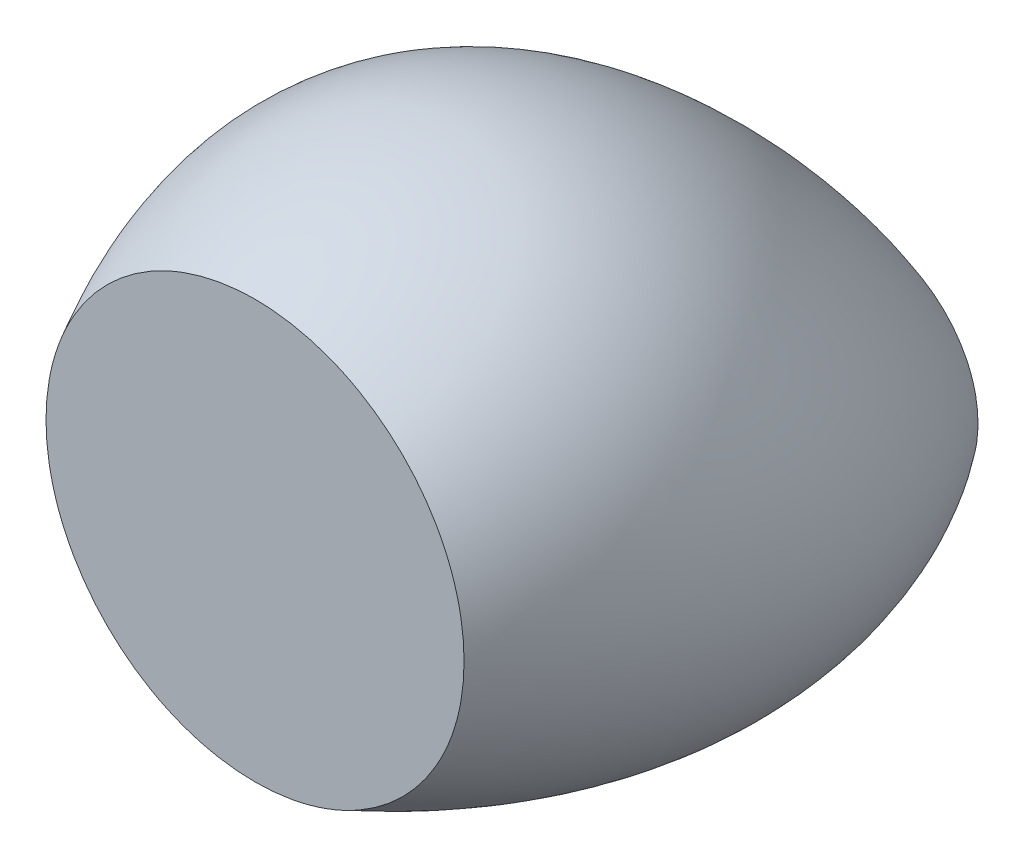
ISO-10303-21;
HEADER;
FILE_DESCRIPTION(('STEP AP214'),'2;1');
FILE_NAME('part.step','',(''),(''),'','','');
FILE_SCHEMA(('AUTOMOTIVE_DESIGN { 1 0 10303 214 1 1 1 1 }'));
ENDSEC;
DATA;
#1=APPLICATION_CONTEXT('core data for automotive mechanical design processes');
#2=APPLICATION_PROTOCOL_DEFINITION('international standard','automotive_design',2000,#1);
#3=PRODUCT_CONTEXT('',#1,'mechanical');
#4=PRODUCT('Part','Part','',(#3));
#5=PRODUCT_RELATED_PRODUCT_CATEGORY('part','',(#4));
#6=PRODUCT_DEFINITION_FORMATION('','',#4);
#7=PRODUCT_DEFINITION_CONTEXT('part definition',#1,'design');
#8=PRODUCT_DEFINITION('design','',#6,#7);
#9=PRODUCT_DEFINITION_SHAPE('','',#8);
#10=(LENGTH_UNIT() NAMED_UNIT(*) SI_UNIT(.MILLI.,.METRE.));
#11=(NAMED_UNIT(*) PLANE_ANGLE_UNIT() SI_UNIT($,.RADIAN.));
#12=(NAMED_UNIT(*) SI_UNIT($,.STERADIAN.) SOLID_ANGLE_UNIT());
#13=UNCERTAINTY_MEASURE_WITH_UNIT(LENGTH_MEASURE(1.E-05),#10,'distance_accuracy_value','');
#14=(GEOMETRIC_REPRESENTATION_CONTEXT(3) GLOBAL_UNCERTAINTY_ASSIGNED_CONTEXT((#13)) GLOBAL_UNIT_ASSIGNED_CONTEXT((#10,
#11,#12)) REPRESENTATION_CONTEXT('',''));
#15=CARTESIAN_POINT('',(0.,0.,0.));
#16=DIRECTION('',(0.,0.,1.));
#17=DIRECTION('',(1.,0.,0.));
#18=AXIS2_PLACEMENT_3D('',#15,#16,#17);
#19=CARTESIAN_POINT('',(0.,24.1067122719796,100.110872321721));
#20=DIRECTION('',(0.,0.,1.));
#21=DIRECTION('',(1.,0.,0.));
#22=AXIS2_PLACEMENT_3D('',#19,#20,#21);
#23=PLANE('',#22);
#24=CARTESIAN_POINT('',(0.,24.1067122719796,100.110872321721));
#25=DIRECTION('',(0.,0.,1.));
#26=DIRECTION('',(1.,0.,0.));
#27=AXIS2_PLACEMENT_3D('',#24,#25,#26);
#28=CIRCLE('',#27,34.3160195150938);
#29=CARTESIAN_POINT('',(0.,-10.2093072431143,100.110872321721));
#30=VERTEX_POINT('',#29);
#31=EDGE_CURVE('E85',#30,#30,#28,.T.);
#32=ORIENTED_EDGE('',*,*,#31,.T.);
#33=EDGE_LOOP('',(#32));
#34=FACE_BOUND('',#33,.T.);
#35=ADVANCED_FACE('F77',(#34),#23,.T.);
#36=CARTESIAN_POINT('',(0.,0.,0.));
#37=DIRECTION('',(0.,0.,1.));
#38=DIRECTION('',(1.,0.,0.));
#39=AXIS2_PLACEMENT_3D('',#36,#37,#38);
#40=PLANE('',#39);
#41=CARTESIAN_POINT('',(0.,0.,0.));
#42=DIRECTION('',(0.,0.,1.));
#43=DIRECTION('',(1.,0.,0.));
#44=AXIS2_PLACEMENT_3D('',#41,#42,#43);
#45=CIRCLE('',#44,18.5802316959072);
#46=CARTESIAN_POINT('',(0.,-18.5802316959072,0.));
#47=VERTEX_POINT('',#46);
#48=EDGE_CURVE('E12',#47,#47,#45,.T.);
#49=ORIENTED_EDGE('',*,*,#48,.F.);
#50=EDGE_LOOP('',(#49));
#51=FACE_BOUND('',#50,.T.);
#52=ADVANCED_FACE('F127',(#51),#40,.F.);
#53=CARTESIAN_POINT('',(0.,-18.5802316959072,0.));
#54=CARTESIAN_POINT('',(0.,-19.0033373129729,1.39071661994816));
#55=CARTESIAN_POINT('',(0.,-19.8392414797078,4.13827129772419));
#56=CARTESIAN_POINT('',(0.,-21.3103895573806,9.71675218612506));
#57=CARTESIAN_POINT('',(0.,-22.7177091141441,16.1769379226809));
#58=CARTESIAN_POINT('',(0.,-23.88452292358,23.6290803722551));
#59=CARTESIAN_POINT('',(0.,-24.6699556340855,31.2507930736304));
#60=CARTESIAN_POINT('',(0.,-25.0089962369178,39.7881123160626));
#61=CARTESIAN_POINT('',(0.,-24.6683343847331,49.3227039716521));
#62=CARTESIAN_POINT('',(0.,-23.5736515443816,59.0051684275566));
#63=CARTESIAN_POINT('',(0.,-21.653600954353,68.9871253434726));
#64=CARTESIAN_POINT('',(0.,-18.8234636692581,79.2690433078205));
#65=CARTESIAN_POINT('',(0.,-15.6778060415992,87.9305618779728));
#66=CARTESIAN_POINT('',(0.,-12.7203558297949,94.8886590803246));
#67=CARTESIAN_POINT('',(0.,-11.0558127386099,98.3503997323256));
#68=CARTESIAN_POINT('',(0.,-10.2093072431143,100.110872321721));
#69=CARTESIAN_POINT('',(10.2547087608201,-18.5802316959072,0.));
#70=CARTESIAN_POINT('',(10.9181758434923,-19.0033373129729,1.39071661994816));
#71=CARTESIAN_POINT('',(12.2289476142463,-19.8392414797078,4.13827129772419));
#72=CARTESIAN_POINT('',(14.6448425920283,-21.3103895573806,9.71675218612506));
#73=CARTESIAN_POINT('',(17.1254691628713,-22.7177091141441,16.1769379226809));
#74=CARTESIAN_POINT('',(19.5086067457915,-23.88452292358,23.6290803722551));
#75=CARTESIAN_POINT('',(21.5263125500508,-24.6699556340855,31.2507930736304));
#76=CARTESIAN_POINT('',(23.2392109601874,-25.0089962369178,39.7881123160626));
#77=CARTESIAN_POINT('',(24.4402326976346,-24.6683343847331,49.3227039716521));
#78=CARTESIAN_POINT('',(24.9345157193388,-23.5736515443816,59.0051684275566));
#79=CARTESIAN_POINT('',(24.6930995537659,-21.653600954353,68.9871253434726));
#80=CARTESIAN_POINT('',(23.6515844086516,-18.8234636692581,79.2690433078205));
#81=CARTESIAN_POINT('',(22.0805250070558,-15.6778060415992,87.9305618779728));
#82=CARTESIAN_POINT('',(20.4333759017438,-12.7203558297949,94.8886590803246));
#83=CARTESIAN_POINT('',(19.4431214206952,-11.0558127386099,98.3503997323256));
#84=CARTESIAN_POINT('',(18.9395262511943,-10.2093072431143,100.110872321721));
#85=CARTESIAN_POINT('',(18.5802316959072,-10.2547087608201,0.));
#86=CARTESIAN_POINT('',(19.7823499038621,-10.1391632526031,1.39071661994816));
#87=CARTESIAN_POINT('',(22.1573021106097,-9.91088698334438,4.13827129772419));
#88=CARTESIAN_POINT('',(26.5345974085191,-9.42063474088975,9.71675218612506));
#89=CARTESIAN_POINT('',(31.0291781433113,-8.81400013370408,16.1769379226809));
#90=CARTESIAN_POINT('',(35.3471211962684,-8.04600847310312,23.6290803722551));
#91=CARTESIAN_POINT('',(39.0029482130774,-7.19331997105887,31.2507930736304));
#92=CARTESIAN_POINT('',(42.1065028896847,-6.14170430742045,39.7881123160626));
#93=CARTESIAN_POINT('',(44.2826019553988,-4.82596512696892,49.3227039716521));
#94=CARTESIAN_POINT('',(45.1781801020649,-3.32998716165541,59.0051684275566));
#95=CARTESIAN_POINT('',(44.7407646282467,-1.60593587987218,68.9871253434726));
#96=CARTESIAN_POINT('',(42.8536712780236,0.378623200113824,79.2690433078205));
#97=CARTESIAN_POINT('',(40.0071108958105,2.24877984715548,87.9305618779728));
#98=CARTESIAN_POINT('',(37.0226856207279,3.86895388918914,94.8886590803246));
#99=CARTESIAN_POINT('',(35.2284700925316,4.72953593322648,98.3503997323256));
#100=CARTESIAN_POINT('',(34.3160195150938,5.16718602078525,100.110872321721));
#101=CARTESIAN_POINT('',(18.5802316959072,10.2547087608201,0.));
#102=CARTESIAN_POINT('',(19.7823499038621,11.6971884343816,1.39071661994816));
#103=CARTESIAN_POINT('',(22.1573021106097,14.5470082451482,4.13827129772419));
#104=CARTESIAN_POINT('',(26.5345974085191,19.8690504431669,9.71675218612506));
#105=CARTESIAN_POINT('',(31.0291781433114,25.4369381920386,16.1769379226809));
#106=CARTESIAN_POINT('',(35.3471211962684,30.9712050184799,23.6290803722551));
#107=CARTESIAN_POINT('',(39.0029482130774,35.8593051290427,31.2507930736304));
#108=CARTESIAN_POINT('',(42.1065028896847,40.3367176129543,39.7881123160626));
#109=CARTESIAN_POINT('',(44.2826019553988,44.0545002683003,49.3227039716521));
#110=CARTESIAN_POINT('',(45.1781801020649,46.5390442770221,59.0051684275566));
#111=CARTESIAN_POINT('',(44.7407646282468,47.7802632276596,68.9871253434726));
#112=CARTESIAN_POINT('',(42.8536712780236,47.6817920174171,79.2690433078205));
#113=CARTESIAN_POINT('',(40.0071108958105,46.4098298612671,87.9305618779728));
#114=CARTESIAN_POINT('',(37.0226856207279,44.7357056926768,94.8886590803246));
#115=CARTESIAN_POINT('',(35.2284700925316,43.6157787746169,98.3503997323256));
#116=CARTESIAN_POINT('',(34.3160195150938,43.0462385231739,100.110872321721));
#117=CARTESIAN_POINT('',(10.2547087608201,18.5802316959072,0.));
#118=CARTESIAN_POINT('',(10.9181758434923,20.5613624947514,1.39071661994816));
#119=CARTESIAN_POINT('',(12.2289476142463,24.4753627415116,4.13827129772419));
#120=CARTESIAN_POINT('',(14.6448425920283,31.7588052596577,9.71675218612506));
#121=CARTESIAN_POINT('',(17.1254691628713,39.3406471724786,16.1769379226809));
#122=CARTESIAN_POINT('',(19.5086067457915,46.8097194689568,23.6290803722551));
#123=CARTESIAN_POINT('',(21.5263125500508,53.3359407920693,31.2507930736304));
#124=CARTESIAN_POINT('',(23.2392109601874,59.2040095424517,39.7881123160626));
#125=CARTESIAN_POINT('',(24.4402326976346,63.8968695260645,49.3227039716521));
#126=CARTESIAN_POINT('',(24.9345157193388,66.7827086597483,59.0051684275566));
#127=CARTESIAN_POINT('',(24.6930995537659,67.8279283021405,68.9871253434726));
#128=CARTESIAN_POINT('',(23.6515844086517,66.883878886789,79.2690433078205));
#129=CARTESIAN_POINT('',(22.0805250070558,64.3364157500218,87.9305618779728));
#130=CARTESIAN_POINT('',(20.4333759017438,61.3250154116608,94.8886590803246));
#131=CARTESIAN_POINT('',(19.4431214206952,59.4011274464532,98.3503997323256));
#132=CARTESIAN_POINT('',(18.9395262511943,58.4227317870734,100.110872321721));
#133=CARTESIAN_POINT('',(-10.2547087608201,18.5802316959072,0.));
#134=CARTESIAN_POINT('',(-10.9181758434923,20.5613624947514,1.39071661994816));
#135=CARTESIAN_POINT('',(-12.2289476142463,24.4753627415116,4.13827129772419));
#136=CARTESIAN_POINT('',(-14.6448425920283,31.7588052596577,9.71675218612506));
#137=CARTESIAN_POINT('',(-17.1254691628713,39.3406471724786,16.1769379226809));
#138=CARTESIAN_POINT('',(-19.5086067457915,46.8097194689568,23.6290803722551));
#139=CARTESIAN_POINT('',(-21.5263125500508,53.3359407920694,31.2507930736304));
#140=CARTESIAN_POINT('',(-23.2392109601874,59.2040095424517,39.7881123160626));
#141=CARTESIAN_POINT('',(-24.4402326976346,63.8968695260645,49.3227039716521));
#142=CARTESIAN_POINT('',(-24.9345157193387,66.7827086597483,59.0051684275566));
#143=CARTESIAN_POINT('',(-24.6930995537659,67.8279283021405,68.9871253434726));
#144=CARTESIAN_POINT('',(-23.6515844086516,66.883878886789,79.2690433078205));
#145=CARTESIAN_POINT('',(-22.0805250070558,64.3364157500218,87.9305618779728));
#146=CARTESIAN_POINT('',(-20.4333759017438,61.3250154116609,94.8886590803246));
#147=CARTESIAN_POINT('',(-19.4431214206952,59.4011274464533,98.3503997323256));
#148=CARTESIAN_POINT('',(-18.9395262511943,58.4227317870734,100.110872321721));
#149=CARTESIAN_POINT('',(-18.5802316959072,10.2547087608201,0.));
#150=CARTESIAN_POINT('',(-19.7823499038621,11.6971884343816,1.39071661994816));
#151=CARTESIAN_POINT('',(-22.1573021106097,14.5470082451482,4.13827129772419));
#152=CARTESIAN_POINT('',(-26.5345974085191,19.8690504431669,9.71675218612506));
#153=CARTESIAN_POINT('',(-31.0291781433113,25.4369381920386,16.1769379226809));
#154=CARTESIAN_POINT('',(-35.3471211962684,30.9712050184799,23.6290803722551));
#155=CARTESIAN_POINT('',(-39.0029482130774,35.8593051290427,31.2507930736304));
#156=CARTESIAN_POINT('',(-42.1065028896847,40.3367176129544,39.7881123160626));
#157=CARTESIAN_POINT('',(-44.2826019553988,44.0545002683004,49.3227039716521));
#158=CARTESIAN_POINT('',(-45.1781801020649,46.5390442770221,59.0051684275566));
#159=CARTESIAN_POINT('',(-44.7407646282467,47.7802632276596,68.9871253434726));
#160=CARTESIAN_POINT('',(-42.8536712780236,47.6817920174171,79.2690433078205));
#161=CARTESIAN_POINT('',(-40.0071108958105,46.4098298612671,87.9305618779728));
#162=CARTESIAN_POINT('',(-37.0226856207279,44.7357056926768,94.8886590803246));
#163=CARTESIAN_POINT('',(-35.2284700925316,43.6157787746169,98.3503997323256));
#164=CARTESIAN_POINT('',(-34.3160195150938,43.0462385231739,100.110872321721));
#165=CARTESIAN_POINT('',(-18.5802316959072,-10.2547087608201,0.));
#166=CARTESIAN_POINT('',(-19.7823499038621,-10.139163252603,1.39071661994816));
#167=CARTESIAN_POINT('',(-22.1573021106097,-9.91088698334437,4.13827129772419));
#168=CARTESIAN_POINT('',(-26.5345974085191,-9.42063474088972,9.71675218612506));
#169=CARTESIAN_POINT('',(-31.0291781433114,-8.81400013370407,16.1769379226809));
#170=CARTESIAN_POINT('',(-35.3471211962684,-8.0460084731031,23.6290803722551));
#171=CARTESIAN_POINT('',(-39.0029482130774,-7.19331997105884,31.2507930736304));
#172=CARTESIAN_POINT('',(-42.1065028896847,-6.14170430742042,39.7881123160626));
#173=CARTESIAN_POINT('',(-44.2826019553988,-4.82596512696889,49.3227039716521));
#174=CARTESIAN_POINT('',(-45.1781801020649,-3.32998716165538,59.0051684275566));
#175=CARTESIAN_POINT('',(-44.7407646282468,-1.60593587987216,68.9871253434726));
#176=CARTESIAN_POINT('',(-42.8536712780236,0.378623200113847,79.2690433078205));
#177=CARTESIAN_POINT('',(-40.0071108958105,2.24877984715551,87.9305618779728));
#178=CARTESIAN_POINT('',(-37.0226856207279,3.86895388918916,94.8886590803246));
#179=CARTESIAN_POINT('',(-35.2284700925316,4.7295359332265,98.3503997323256));
#180=CARTESIAN_POINT('',(-34.3160195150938,5.16718602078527,100.110872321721));
#181=CARTESIAN_POINT('',(-10.2547087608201,-18.5802316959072,0.));
#182=CARTESIAN_POINT('',(-10.9181758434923,-19.0033373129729,1.39071661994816));
#183=CARTESIAN_POINT('',(-12.2289476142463,-19.8392414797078,4.13827129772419));
#184=CARTESIAN_POINT('',(-14.6448425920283,-21.3103895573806,9.71675218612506));
#185=CARTESIAN_POINT('',(-17.1254691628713,-22.7177091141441,16.1769379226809));
#186=CARTESIAN_POINT('',(-19.5086067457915,-23.88452292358,23.6290803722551));
#187=CARTESIAN_POINT('',(-21.5263125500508,-24.6699556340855,31.2507930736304));
#188=CARTESIAN_POINT('',(-23.2392109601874,-25.0089962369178,39.7881123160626));
#189=CARTESIAN_POINT('',(-24.4402326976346,-24.6683343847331,49.3227039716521));
#190=CARTESIAN_POINT('',(-24.9345157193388,-23.5736515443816,59.0051684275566));
#191=CARTESIAN_POINT('',(-24.6930995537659,-21.653600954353,68.9871253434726));
#192=CARTESIAN_POINT('',(-23.6515844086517,-18.8234636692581,79.2690433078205));
#193=CARTESIAN_POINT('',(-22.0805250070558,-15.6778060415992,87.9305618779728));
#194=CARTESIAN_POINT('',(-20.4333759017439,-12.7203558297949,94.8886590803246));
#195=CARTESIAN_POINT('',(-19.4431214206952,-11.0558127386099,98.3503997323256));
#196=CARTESIAN_POINT('',(-18.9395262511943,-10.2093072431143,100.110872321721));
#197=CARTESIAN_POINT('',(0.,-18.5802316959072,0.));
#198=CARTESIAN_POINT('',(0.,-19.0033373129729,1.39071661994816));
#199=CARTESIAN_POINT('',(0.,-19.8392414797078,4.13827129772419));
#200=CARTESIAN_POINT('',(0.,-21.3103895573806,9.71675218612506));
#201=CARTESIAN_POINT('',(0.,-22.7177091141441,16.1769379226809));
#202=CARTESIAN_POINT('',(0.,-23.88452292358,23.6290803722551));
#203=CARTESIAN_POINT('',(0.,-24.6699556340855,31.2507930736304));
#204=CARTESIAN_POINT('',(0.,-25.0089962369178,39.7881123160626));
#205=CARTESIAN_POINT('',(0.,-24.6683343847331,49.3227039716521));
#206=CARTESIAN_POINT('',(0.,-23.5736515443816,59.0051684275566));
#207=CARTESIAN_POINT('',(0.,-21.653600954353,68.9871253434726));
#208=CARTESIAN_POINT('',(0.,-18.8234636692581,79.2690433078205));
#209=CARTESIAN_POINT('',(0.,-15.6778060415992,87.9305618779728));
#210=CARTESIAN_POINT('',(0.,-12.7203558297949,94.8886590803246));
#211=CARTESIAN_POINT('',(0.,-11.0558127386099,98.3503997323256));
#212=CARTESIAN_POINT('',(0.,-10.2093072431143,100.110872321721));
#213=B_SPLINE_SURFACE_WITH_KNOTS('',3,3,((#53,#54,#55,#56,#57,#58,#59,#60,#61,#62,#63,#64,#65,
#66,#67,#68),(#69,#70,#71,#72,#73,#74,#75,#76,#77,#78,#79,#80,#81,#82,#83,#84),(#85,#86,#87,#88,
#89,#90,#91,#92,#93,#94,#95,#96,#97,#98,#99,#100),(#101,#102,#103,#104,#105,#106,#107,#108,#109,
#110,#111,#112,#113,#114,#115,#116),(#117,#118,#119,#120,#121,#122,#123,#124,#125,#126,#127,
#128,#129,#130,#131,#132),(#133,#134,#135,#136,#137,#138,#139,#140,#141,#142,#143,#144,#145,
#146,#147,#148),(#149,#150,#151,#152,#153,#154,#155,#156,#157,#158,#159,#160,#161,#162,#163,
#164),(#165,#166,#167,#168,#169,#170,#171,#172,#173,#174,#175,#176,#177,#178,#179,#180),(#181,
#182,#183,#184,#185,#186,#187,#188,#189,#190,#191,#192,#193,#194,#195,#196),(#197,#198,#199,
#200,#201,#202,#203,#204,#205,#206,#207,#208,#209,#210,#211,#212)),.UNSPECIFIED.,.T.,.F.,.F.,(4,
2,2,2,4),(4,1,1,1,1,1,1,1,1,1,1,1,1,4),(0.,0.25,0.5,0.75,1.),(0.,0.0519576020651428,
0.102649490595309,0.200390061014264,0.274026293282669,0.345159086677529,0.4375525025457,
0.527044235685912,0.614960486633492,0.702912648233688,0.797062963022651,0.895397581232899,
0.946804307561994,1.),.UNSPECIFIED.);
#214=CARTESIAN_POINT('',(0.,-18.5802316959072,0.));
#215=CARTESIAN_POINT('',(0.,-18.5881841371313,0.0261390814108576));
#216=CARTESIAN_POINT('',(0.,-18.5961365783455,0.0522781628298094));
#217=CARTESIAN_POINT('',(0.,-18.6120411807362,0.104556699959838));
#218=CARTESIAN_POINT('',(0.,-18.6199933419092,0.130696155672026));
#219=CARTESIAN_POINT('',(0.,-18.6358971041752,0.182975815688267));
#220=CARTESIAN_POINT('',(0.,-18.6438487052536,0.209116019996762));
#221=CARTESIAN_POINT('',(0.,-18.6597510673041,0.261397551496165));
#222=CARTESIAN_POINT('',(0.,-18.6677018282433,0.287538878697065));
#223=CARTESIAN_POINT('',(0.,-18.6836022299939,0.339823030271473));
#224=CARTESIAN_POINT('',(0.,-18.6915518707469,0.365965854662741));
#225=CARTESIAN_POINT('',(0.,-18.7074497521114,0.418253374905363));
#226=CARTESIAN_POINT('',(0.,-18.7153979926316,0.444398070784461));
#227=CARTESIAN_POINT('',(0.,-18.7312927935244,0.496689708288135));
#228=CARTESIAN_POINT('',(0.,-18.7392393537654,0.522836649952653));
#229=CARTESIAN_POINT('',(0.,-18.7551305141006,0.575133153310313));
#230=CARTESIAN_POINT('',(0.,-18.7630751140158,0.601282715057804));
#231=CARTESIAN_POINT('',(0.,-18.7789620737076,0.653584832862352));
#232=CARTESIAN_POINT('',(0.,-18.7869044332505,0.679737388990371));
#233=CARTESIAN_POINT('',(0.,-18.8027866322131,0.732045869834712));
#234=CARTESIAN_POINT('',(0.,-18.8107264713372,0.758201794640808));
#235=CARTESIAN_POINT('',(0.,-18.8266033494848,0.810517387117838));
#236=CARTESIAN_POINT('',(0.,-18.8345403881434,0.836677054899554));
#237=CARTESIAN_POINT('',(0.,-18.8504113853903,0.889000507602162));
#238=CARTESIAN_POINT('',(0.,-18.8583453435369,0.915164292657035));
#239=CARTESIAN_POINT('',(0.,-18.8742098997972,0.967496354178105));
#240=CARTESIAN_POINT('',(0.,-18.8821404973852,0.993664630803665));
#241=CARTESIAN_POINT('',(0.,-18.8979980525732,1.04600604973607));
#242=CARTESIAN_POINT('',(0.,-18.9059250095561,1.07217919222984));
#243=CARTESIAN_POINT('',(0.,-18.9217750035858,1.12453071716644));
#244=CARTESIAN_POINT('',(0.,-18.929698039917,1.15070909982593));
#245=CARTESIAN_POINT('',(0.,-18.9455399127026,1.2030714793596));
#246=CARTESIAN_POINT('',(0.,-18.9534587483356,1.22925547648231));
#247=CARTESIAN_POINT('',(0.,-18.9692919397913,1.28162945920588));
#248=CARTESIAN_POINT('',(0.,-18.9772062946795,1.3078194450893));
#249=CARTESIAN_POINT('',(0.,-18.9930302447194,1.36020577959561));
#250=CARTESIAN_POINT('',(0.,-19.0009398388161,1.38640212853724));
#251=CARTESIAN_POINT('',(0.,-19.0167539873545,1.43880156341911));
#252=CARTESIAN_POINT('',(0.,-19.0246585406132,1.46500464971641));
#253=CARTESIAN_POINT('',(0.,-19.0404623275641,1.51741793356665));
#254=CARTESIAN_POINT('',(0.,-19.0483615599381,1.54362813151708));
#255=CARTESIAN_POINT('',(0.,-19.0641544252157,1.5960560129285));
#256=CARTESIAN_POINT('',(0.,-19.0720480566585,1.62227369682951));
#257=CARTESIAN_POINT('',(0.,-19.0878294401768,1.67471692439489));
#258=CARTESIAN_POINT('',(0.,-19.0957171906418,1.7009424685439));
#259=CARTESIAN_POINT('',(0.,-19.1114865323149,1.75340179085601));
#260=CARTESIAN_POINT('',(0.,-19.1193681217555,1.77963556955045));
#261=CARTESIAN_POINT('',(0.,-19.1351248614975,1.83211173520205));
#262=CARTESIAN_POINT('',(0.,-19.143000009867,1.85835412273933));
#263=CARTESIAN_POINT('',(0.,-19.1587435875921,1.91084788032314));
#264=CARTESIAN_POINT('',(0.,-19.1666120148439,1.93709925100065));
#265=CARTESIAN_POINT('',(0.,-19.182341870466,1.98961134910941));
#266=CARTESIAN_POINT('',(0.,-19.1902032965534,2.01587207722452));
#267=CARTESIAN_POINT('',(0.,-19.2059188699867,2.06840326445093));
#268=CARTESIAN_POINT('',(0.,-19.2137730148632,2.094673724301));
#269=CARTESIAN_POINT('',(0.,-19.2294737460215,2.14722474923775));
#270=CARTESIAN_POINT('',(0.,-19.2373203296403,2.17350531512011));
#271=CARTESIAN_POINT('',(0.,-19.2530056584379,2.22607692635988));
#272=CARTESIAN_POINT('',(0.,-19.2608444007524,2.25236797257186));
#273=CARTESIAN_POINT('',(0.,-19.2765137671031,2.30496091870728));
#274=CARTESIAN_POINT('',(0.,-19.2843443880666,2.33126281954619));
#275=CARTESIAN_POINT('',(0.,-19.2999972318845,2.38387784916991));
#276=CARTESIAN_POINT('',(0.,-19.3078194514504,2.41019097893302));
#277=CARTESIAN_POINT('',(0.,-19.3234552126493,2.46282884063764));
#278=CARTESIAN_POINT('',(0.,-19.3312687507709,2.48915357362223));
#279=CARTESIAN_POINT('',(0.,-19.3468868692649,2.54181501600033));
#280=CARTESIAN_POINT('',(0.,-19.3546914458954,2.56815172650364));
#281=CARTESIAN_POINT('',(0.,-19.3702913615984,2.6208374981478));
#282=CARTESIAN_POINT('',(0.,-19.3780866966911,2.64718656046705));
#283=CARTESIAN_POINT('',(0.,-19.3936678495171,2.6998974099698));
#284=CARTESIAN_POINT('',(0.,-19.4014536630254,2.7262591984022));
#285=CARTESIAN_POINT('',(0.,-19.4170154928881,2.77899587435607));
#286=CARTESIAN_POINT('',(0.,-19.4247915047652,2.80537076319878));
#287=CARTESIAN_POINT('',(0.,-19.4403334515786,2.85813401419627));
#288=CARTESIAN_POINT('',(0.,-19.4480993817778,2.88452237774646));
#289=CARTESIAN_POINT('',(0.,-19.4636208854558,2.93731295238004));
#290=CARTESIAN_POINT('',(0.,-19.4713764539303,2.96371516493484));
#291=CARTESIAN_POINT('',(0.,-19.4868769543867,3.01653381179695));
#292=CARTESIAN_POINT('',(0.,-19.4946218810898,3.04295024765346));
#293=CARTESIAN_POINT('',(0.,-19.5101008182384,3.09579771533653));
#294=CARTESIAN_POINT('',(0.,-19.5178348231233,3.12222874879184));
#295=CARTESIAN_POINT('',(0.,-19.5332916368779,3.17510578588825));
#296=CARTESIAN_POINT('',(0.,-19.5410144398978,3.20155179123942));
#297=CARTESIAN_POINT('',(0.,-19.5564485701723,3.25445914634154));
#298=CARTESIAN_POINT('',(0.,-19.5641598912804,3.28092049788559));
#299=CARTESIAN_POINT('',(0.,-19.5795707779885,3.33385891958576));
#300=CARTESIAN_POINT('',(0.,-19.587270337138,3.3603359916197));
#301=CARTESIAN_POINT('',(0.,-19.6026574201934,3.41330622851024));
#302=CARTESIAN_POINT('',(0.,-19.6103449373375,3.43979939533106));
#303=CARTESIAN_POINT('',(0.,-19.625707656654,3.49280219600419));
#304=CARTESIAN_POINT('',(0.,-19.6333828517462,3.51931183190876));
#305=CARTESIAN_POINT('',(0.,-19.6487206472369,3.57234794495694));
#306=CARTESIAN_POINT('',(0.,-19.6563832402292,3.59887442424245));
#307=CARTESIAN_POINT('',(0.,-19.6716955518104,3.65194459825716));
#308=CARTESIAN_POINT('',(0.,-19.6793452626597,3.67848829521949));
#309=CARTESIAN_POINT('',(0.,-19.6946315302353,3.73159327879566));
#310=CARTESIAN_POINT('',(0.,-19.7022680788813,3.75815456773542));
#311=CARTESIAN_POINT('',(0.,-19.7175277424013,3.81129510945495));
#312=CARTESIAN_POINT('',(0.,-19.7251508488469,3.83787436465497));
#313=CARTESIAN_POINT('',(0.,-19.7403833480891,3.89105121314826));
#314=CARTESIAN_POINT('',(0.,-19.7479927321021,3.91764880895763));
#315=CARTESIAN_POINT('',(0.,-19.7631975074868,3.97086271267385));
#316=CARTESIAN_POINT('',(0.,-19.7707928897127,3.997479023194));
#317=CARTESIAN_POINT('',(0.,-19.7859693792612,4.05073073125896));
#318=CARTESIAN_POINT('',(0.,-19.7935504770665,4.07736613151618));
#319=CARTESIAN_POINT('',(0.,-19.80869812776,4.13065639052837));
#320=CARTESIAN_POINT('',(0.,-19.8162646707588,4.15731125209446));
#321=CARTESIAN_POINT('',(0.,-19.8313828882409,4.21064079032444));
#322=CARTESIAN_POINT('',(0.,-19.8389345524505,4.23731546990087));
#323=CARTESIAN_POINT('',(0.,-19.8540230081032,4.29068468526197));
#324=CARTESIAN_POINT('',(0.,-19.8615597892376,4.3173792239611));
#325=CARTESIAN_POINT('',(0.,-19.8766185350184,4.3707880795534));
#326=CARTESIAN_POINT('',(0.,-19.8841404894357,4.39750239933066));
#327=CARTESIAN_POINT('',(0.,-19.8991696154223,4.45095074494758));
#328=CARTESIAN_POINT('',(0.,-19.9066767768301,4.47768477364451));
#329=CARTESIAN_POINT('',(0.,-19.9216763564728,4.53117246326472));
#330=CARTESIAN_POINT('',(0.,-19.929168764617,4.55792612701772));
#331=CARTESIAN_POINT('',(0.,-19.9441388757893,4.6114530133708));
#332=CARTESIAN_POINT('',(0.,-19.9516165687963,4.63822623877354));
#333=CARTESIAN_POINT('',(0.,-19.9665572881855,4.69179217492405));
#334=CARTESIAN_POINT('',(0.,-19.9740203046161,4.71858488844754));
#335=CARTESIAN_POINT('',(0.,-19.9889317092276,4.77218972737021));
#336=CARTESIAN_POINT('',(0.,-19.9963800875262,4.79900185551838));
#337=CARTESIAN_POINT('',(0.,-20.0112622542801,4.85264545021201));
#338=CARTESIAN_POINT('',(0.,-20.0186960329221,4.87947691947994));
#339=CARTESIAN_POINT('',(0.,-20.0335490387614,4.93315912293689));
#340=CARTESIAN_POINT('',(0.,-20.0409682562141,4.96000985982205));
#341=CARTESIAN_POINT('',(0.,-20.0557921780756,5.0137305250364));
#342=CARTESIAN_POINT('',(0.,-20.0631968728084,5.04060045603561));
#343=CARTESIAN_POINT('',(0.,-20.0779917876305,5.09435943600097));
#344=CARTESIAN_POINT('',(0.,-20.0853819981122,5.12124848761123));
#345=CARTESIAN_POINT('',(0.,-20.100147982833,5.17504563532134));
#346=CARTESIAN_POINT('',(0.,-20.1075237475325,5.20195373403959));
#347=CARTESIAN_POINT('',(0.,-20.1222608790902,5.25578890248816));
#348=CARTESIAN_POINT('',(0.,-20.1296222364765,5.28271597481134));
#349=CARTESIAN_POINT('',(0.,-20.1443305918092,5.33658901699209));
#350=CARTESIAN_POINT('',(0.,-20.1516775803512,5.36353498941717));
#351=CARTESIAN_POINT('',(0.,-20.166357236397,5.41744575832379));
#352=CARTESIAN_POINT('',(0.,-20.1736898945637,5.44441055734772));
#353=CARTESIAN_POINT('',(0.,-20.1883409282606,5.49835890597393));
#354=CARTESIAN_POINT('',(0.,-20.195659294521,5.52534245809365));
#355=CARTESIAN_POINT('',(0.,-20.2102817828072,5.57932823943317));
#356=CARTESIAN_POINT('',(0.,-20.2175858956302,5.60633047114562));
#357=CARTESIAN_POINT('',(0.,-20.2321799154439,5.66035353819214));
#358=CARTESIAN_POINT('',(0.,-20.2394698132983,5.68737437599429));
#359=CARTESIAN_POINT('',(0.,-20.2540354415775,5.74143458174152));
#360=CARTESIAN_POINT('',(0.,-20.2613111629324,5.7684739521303));
#361=CARTESIAN_POINT('',(0.,-20.2758484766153,5.82257114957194));
#362=CARTESIAN_POINT('',(0.,-20.2831100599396,5.84962897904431));
#363=CARTESIAN_POINT('',(0.,-20.2976191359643,5.90376302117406));
#364=CARTESIAN_POINT('',(0.,-20.3048666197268,5.93083923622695));
#365=CARTESIAN_POINT('',(0.,-20.3193475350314,5.98500997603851));
#366=CARTESIAN_POINT('',(0.,-20.3265809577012,6.01210450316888));
#367=CARTESIAN_POINT('',(0.,-20.3410337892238,6.06631179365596));
#368=CARTESIAN_POINT('',(0.,-20.3482531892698,6.09342455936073));
#369=CARTESIAN_POINT('',(0.,-20.3626780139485,6.14766825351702));
#370=CARTESIAN_POINT('',(0.,-20.3698834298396,6.17479918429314));
#371=CARTESIAN_POINT('',(0.,-20.3842803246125,6.22907913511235));
#372=CARTESIAN_POINT('',(0.,-20.3914717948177,6.25622815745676));
#373=CARTESIAN_POINT('',(0.,-20.405840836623,6.31054421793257));
#374=CARTESIAN_POINT('',(0.,-20.4130183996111,6.33771125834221));
#375=CARTESIAN_POINT('',(0.,-20.4273596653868,6.39206328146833));
#376=CARTESIAN_POINT('',(0.,-20.4345233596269,6.41924826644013));
#377=CARTESIAN_POINT('',(0.,-20.4488369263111,6.47363610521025));
#378=CARTESIAN_POINT('',(0.,-20.455986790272,6.50083896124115));
#379=CARTESIAN_POINT('',(0.,-20.470272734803,6.55526246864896));
#380=CARTESIAN_POINT('',(0.,-20.4774088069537,6.58248312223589));
#381=CARTESIAN_POINT('',(0.,-20.4916672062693,6.63694215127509));
#382=CARTESIAN_POINT('',(0.,-20.4987895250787,6.66418052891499));
#383=CARTESIAN_POINT('',(0.,-20.5130204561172,6.71867493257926));
#384=CARTESIAN_POINT('',(0.,-20.5201290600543,6.74593096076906));
#385=CARTESIAN_POINT('',(0.,-20.5343325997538,6.80046059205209));
#386=CARTESIAN_POINT('',(0.,-20.5414275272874,6.82773419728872));
#387=CARTESIAN_POINT('',(0.,-20.555603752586,6.88229890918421));
#388=CARTESIAN_POINT('',(0.,-20.5626850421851,6.90959001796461));
#389=CARTESIAN_POINT('',(0.,-20.5768340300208,6.96418966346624));
#390=CARTESIAN_POINT('',(0.,-20.5839017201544,6.99149820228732));
#391=CARTESIAN_POINT('',(0.,-20.5980235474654,7.04613263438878));
#392=CARTESIAN_POINT('',(0.,-20.6050776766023,7.07345852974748));
#393=CARTESIAN_POINT('',(0.,-20.6191724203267,7.12812760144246));
#394=CARTESIAN_POINT('',(0.,-20.6262130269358,7.15547077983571));
#395=CARTESIAN_POINT('',(0.,-20.6402807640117,7.21017434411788));
#396=CARTESIAN_POINT('',(0.,-20.647307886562,7.2375347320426));
#397=CARTESIAN_POINT('',(0.,-20.6613486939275,7.29227264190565));
#398=CARTESIAN_POINT('',(0.,-20.668362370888,7.31965016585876));
#399=CARTESIAN_POINT('',(0.,-20.6823763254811,7.37442227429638));
#400=CARTESIAN_POINT('',(0.,-20.6893765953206,7.40181686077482));
#401=CARTESIAN_POINT('',(0.,-20.7033637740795,7.45662302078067));
#402=CARTESIAN_POINT('',(0.,-20.710350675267,7.48403459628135));
#403=CARTESIAN_POINT('',(0.,-20.7243111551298,7.53887466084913));
#404=CARTESIAN_POINT('',(0.,-20.7312847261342,7.56630315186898));
#405=CARTESIAN_POINT('',(0.,-20.7452185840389,7.62117697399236));
#406=CARTESIAN_POINT('',(0.,-20.7521788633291,7.64862230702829));
#407=CARTESIAN_POINT('',(0.,-20.7660861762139,7.70352973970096));
#408=CARTESIAN_POINT('',(0.,-20.7730332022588,7.7309918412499));
#409=CARTESIAN_POINT('',(0.,-20.7869140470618,7.7859327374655));
#410=CARTESIAN_POINT('',(0.,-20.7938478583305,7.81341153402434));
#411=CARTESIAN_POINT('',(0.,-20.8077023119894,7.86838574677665));
#412=CARTESIAN_POINT('',(0.,-20.8146229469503,7.89588116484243));
#413=CARTESIAN_POINT('',(0.,-20.8284510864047,7.95088854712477));
#414=CARTESIAN_POINT('',(0.,-20.8353585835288,7.9784005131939));
#415=CARTESIAN_POINT('',(0.,-20.8491604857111,8.03344091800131));
#416=CARTESIAN_POINT('',(0.,-20.8560548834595,8.06096935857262));
#417=CARTESIAN_POINT('',(0.,-20.8698306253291,8.11604263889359));
#418=CARTESIAN_POINT('',(0.,-20.8767119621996,8.14358748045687));
#419=CARTESIAN_POINT('',(0.,-20.8904616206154,8.19869348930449));
#420=CARTESIAN_POINT('',(0.,-20.897329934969,8.22625465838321));
#421=CARTESIAN_POINT('',(0.,-20.9110535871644,8.28139324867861));
#422=CARTESIAN_POINT('',(0.,-20.9179089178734,8.30897067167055));
#423=CARTESIAN_POINT('',(0.,-20.9316066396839,8.36414169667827));
#424=CARTESIAN_POINT('',(0.,-20.9384490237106,8.39173530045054));
#425=CARTESIAN_POINT('',(0.,-20.9521208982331,8.44693862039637));
#426=CARTESIAN_POINT('',(0.,-20.9589503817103,8.4745483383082));
#427=CARTESIAN_POINT('',(0.,-20.9725964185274,8.52978388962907));
#428=CARTESIAN_POINT('',(0.,-20.9794129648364,8.55740972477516));
#429=CARTESIAN_POINT('',(0.,-20.9930330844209,8.61267753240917));
#430=CARTESIAN_POINT('',(0.,-20.999836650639,8.64031950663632));
#431=CARTESIAN_POINT('',(0.,-21.0134307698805,8.69561961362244));
#432=CARTESIAN_POINT('',(0.,-21.0202213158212,8.7232777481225));
#433=CARTESIAN_POINT('',(0.,-21.0337893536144,8.77861019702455));
#434=CARTESIAN_POINT('',(0.,-21.0405668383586,8.80628451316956));
#435=CARTESIAN_POINT('',(0.,-21.0541087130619,8.86164934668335));
#436=CARTESIAN_POINT('',(0.,-21.0608730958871,8.88933986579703));
#437=CARTESIAN_POINT('',(0.,-21.0743887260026,8.94473712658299));
#438=CARTESIAN_POINT('',(0.,-21.0811399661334,8.97244387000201));
#439=CARTESIAN_POINT('',(0.,-21.0946292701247,9.02787360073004));
#440=CARTESIAN_POINT('',(0.,-21.1013673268,9.05559658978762));
#441=CARTESIAN_POINT('',(0.,-21.114830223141,9.11105883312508));
#442=CARTESIAN_POINT('',(0.,-21.1215550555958,9.13879808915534));
#443=CARTESIAN_POINT('',(0.,-21.1349914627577,9.19429288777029));
#444=CARTESIAN_POINT('',(0.,-21.1417030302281,9.22204843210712));
#445=CARTESIAN_POINT('',(0.,-21.1551128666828,9.27757582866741));
#446=CARTESIAN_POINT('',(0.,-21.1618111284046,9.30534768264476));
#447=CARTESIAN_POINT('',(0.,-21.1751943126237,9.36090771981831));
#448=CARTESIAN_POINT('',(0.,-21.1818792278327,9.38869590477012));
#449=CARTESIAN_POINT('',(0.,-21.195235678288,9.44428862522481));
#450=CARTESIAN_POINT('',(0.,-21.20190720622,9.47209316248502));
#451=CARTESIAN_POINT('',(0.,-21.2152368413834,9.52771860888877));
#452=CARTESIAN_POINT('',(0.,-21.2218949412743,9.5555395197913));
#453=CARTESIAN_POINT('',(0.,-21.2351976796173,9.61119773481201));
#454=CARTESIAN_POINT('',(0.,-21.241842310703,9.63903504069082));
#455=CARTESIAN_POINT('',(0.,-21.2551180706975,9.69472606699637));
#456=CARTESIAN_POINT('',(0.,-21.2617491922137,9.72257978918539));
#457=CARTESIAN_POINT('',(0.,-21.2749978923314,9.7783036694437));
#458=CARTESIAN_POINT('',(0.,-21.281615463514,9.80617382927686));
#459=CARTESIAN_POINT('',(0.,-21.2948370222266,9.86193060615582));
#460=CARTESIAN_POINT('',(0.,-21.3014410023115,9.88981722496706));
#461=CARTESIAN_POINT('',(0.,-21.3146353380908,9.94560694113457));
#462=CARTESIAN_POINT('',(0.,-21.3212256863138,9.97351004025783));
#463=CARTESIAN_POINT('',(0.,-21.3343927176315,10.0293327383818));
#464=CARTESIAN_POINT('',(0.,-21.3409693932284,10.057252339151));
#465=CARTESIAN_POINT('',(0.,-21.3541090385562,10.1131080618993));
#466=CARTESIAN_POINT('',(0.,-21.360672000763,10.1410441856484));
#467=CARTESIAN_POINT('',(0.,-21.3737841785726,10.196932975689));
#468=CARTESIAN_POINT('',(0.,-21.380333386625,10.2248856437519));
#469=CARTESIAN_POINT('',(0.,-21.3934180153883,10.2808075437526));
#470=CARTESIAN_POINT('',(0.,-21.3999534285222,10.3087767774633));
#471=CARTESIAN_POINT('',(0.,-21.4130104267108,10.3647318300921));
#472=CARTESIAN_POINT('',(0.,-21.419532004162,10.3927176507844));
#473=CARTESIAN_POINT('',(0.,-21.4325612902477,10.4487058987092));
#474=CARTESIAN_POINT('',(0.,-21.4390689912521,10.4767083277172));
#475=CARTESIAN_POINT('',(0.,-21.4520704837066,10.5327298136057));
#476=CARTESIAN_POINT('',(0.,-21.4585642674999,10.5607488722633));
#477=CARTESIAN_POINT('',(0.,-21.4715378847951,10.6168036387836));
#478=CARTESIAN_POINT('',(0.,-21.4780177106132,10.6448393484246));
#479=CARTESIAN_POINT('',(0.,-21.4909633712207,10.7009274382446));
#480=CARTESIAN_POINT('',(0.,-21.4974291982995,10.7289798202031));
#481=CARTESIAN_POINT('',(0.,-21.510346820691,10.7851012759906));
#482=CARTESIAN_POINT('',(0.,-21.5167986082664,10.8131703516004));
#483=CARTESIAN_POINT('',(0.,-21.5296881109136,10.8693252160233));
#484=CARTESIAN_POINT('',(0.,-21.5361258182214,10.8974110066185));
#485=CARTESIAN_POINT('',(0.,-21.5489871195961,10.9535993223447));
#486=CARTESIAN_POINT('',(0.,-21.5554107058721,10.9817018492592));
#487=CARTESIAN_POINT('',(0.,-21.5682437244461,11.0379236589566));
#488=CARTESIAN_POINT('',(0.,-21.5746531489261,11.0660429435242));
#489=CARTESIAN_POINT('',(0.,-21.5874578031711,11.1222982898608));
#490=CARTESIAN_POINT('',(0.,-21.593853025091,11.1504343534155));
#491=CARTESIAN_POINT('',(0.,-21.6066292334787,11.2067232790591));
#492=CARTESIAN_POINT('',(0.,-21.6130102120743,11.2348761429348));
#493=CARTESIAN_POINT('',(0.,-21.6257578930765,11.2911986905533));
#494=CARTESIAN_POINT('',(0.,-21.6321245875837,11.319368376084));
#495=CARTESIAN_POINT('',(0.,-21.6448436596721,11.3757245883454));
#496=CARTESIAN_POINT('',(0.,-21.6511960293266,11.403911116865));
#497=CARTESIAN_POINT('',(0.,-21.6638864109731,11.460301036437));
#498=CARTESIAN_POINT('',(0.,-21.6702244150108,11.4885044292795));
#499=CARTESIAN_POINT('',(0.,-21.6828860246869,11.5449280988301));
#500=CARTESIAN_POINT('',(0.,-21.6892096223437,11.5731483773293));
#501=CARTESIAN_POINT('',(0.,-21.7018423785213,11.6296058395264));
#502=CARTESIAN_POINT('',(0.,-21.708151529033,11.6578430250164));
#503=CARTESIAN_POINT('',(0.,-21.7207553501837,11.7143343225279));
#504=CARTESIAN_POINT('',(0.,-21.7270500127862,11.7425884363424));
#505=CARTESIAN_POINT('',(0.,-21.7396248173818,11.7991136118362));
#506=CARTESIAN_POINT('',(0.,-21.7459049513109,11.8273846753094));
#507=CARTESIAN_POINT('',(0.,-21.7584506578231,11.8839437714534));
#508=CARTESIAN_POINT('',(0.,-21.7647162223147,11.912231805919));
#509=CARTESIAN_POINT('',(0.,-21.7772327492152,11.9688248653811));
#510=CARTESIAN_POINT('',(0.,-21.7834837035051,11.9971298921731));
#511=CARTESIAN_POINT('',(0.,-21.7959709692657,12.0537569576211));
#512=CARTESIAN_POINT('',(0.,-21.8022072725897,12.0820789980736));
#513=CARTESIAN_POINT('',(0.,-21.8146651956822,12.1387401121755));
#514=CARTESIAN_POINT('',(0.,-21.8208868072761,12.1670791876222));
#515=CARTESIAN_POINT('',(0.,-21.8333153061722,12.2237743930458));
#516=CARTESIAN_POINT('',(0.,-21.8395221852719,12.2521305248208));
#517=CARTESIAN_POINT('',(0.,-21.8519211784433,12.3088598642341));
#518=CARTESIAN_POINT('',(0.,-21.8581132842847,12.3372330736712));
#519=CARTESIAN_POINT('',(0.,-21.8704826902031,12.393996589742));
#520=CARTESIAN_POINT('',(0.,-21.876659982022,12.4223868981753));
#521=CARTESIAN_POINT('',(0.,-21.8889997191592,12.4791846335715));
#522=CARTESIAN_POINT('',(0.,-21.8951621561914,12.5075920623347));
#523=CARTESIAN_POINT('',(0.,-21.9074721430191,12.5644240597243));
#524=CARTESIAN_POINT('',(0.,-21.9136196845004,12.5928486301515));
#525=CARTESIAN_POINT('',(0.,-21.9258998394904,12.6497149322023));
#526=CARTESIAN_POINT('',(0.,-21.9320324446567,12.6781566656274));
#527=CARTESIAN_POINT('',(0.,-21.9442826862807,12.7350573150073));
#528=CARTESIAN_POINT('',(0.,-21.9504003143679,12.7635162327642));
#529=CARTESIAN_POINT('',(0.,-21.9626205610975,12.8204512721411));
#530=CARTESIAN_POINT('',(0.,-21.9687231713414,12.8489273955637));
#531=CARTESIAN_POINT('',(0.,-21.9809133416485,12.9058968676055));
#532=CARTESIAN_POINT('',(0.,-21.9870008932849,12.9343902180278));
#533=CARTESIAN_POINT('',(0.,-21.9991609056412,12.9913941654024));
#534=CARTESIAN_POINT('',(0.,-22.005233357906,13.0199047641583));
#535=CARTESIAN_POINT('',(0.,-22.0173631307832,13.0769432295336));
#536=CARTESIAN_POINT('',(0.,-22.0234204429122,13.105471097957));
#537=CARTESIAN_POINT('',(0.,-22.035519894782,13.1625441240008));
#538=CARTESIAN_POINT('',(0.,-22.0415620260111,13.1910892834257));
#539=CARTESIAN_POINT('',(0.,-22.0536310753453,13.248196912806));
#540=CARTESIAN_POINT('',(0.,-22.0596579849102,13.2767593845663));
#541=CARTESIAN_POINT('',(0.,-22.0716965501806,13.3339016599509));
#542=CARTESIAN_POINT('',(0.,-22.0777081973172,13.3624814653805));
#543=CARTESIAN_POINT('',(0.,-22.0897161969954,13.4196584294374));
#544=CARTESIAN_POINT('',(0.,-22.0957125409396,13.4482555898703));
#545=CARTESIAN_POINT('',(0.,-22.1076898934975,13.5054672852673));
#546=CARTESIAN_POINT('',(0.,-22.1136708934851,13.5340818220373));
#547=CARTESIAN_POINT('',(0.,-22.1256175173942,13.5913282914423));
#548=CARTESIAN_POINT('',(0.,-22.131583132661,13.6199602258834));
#549=CARTESIAN_POINT('',(0.,-22.1434989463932,13.6772415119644));
#550=CARTESIAN_POINT('',(0.,-22.1494491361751,13.7058908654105));
#551=CARTESIAN_POINT('',(0.,-22.1613340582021,13.7632070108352));
#552=CARTESIAN_POINT('',(0.,-22.167268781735,13.7918738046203));
#553=CARTESIAN_POINT('',(0.,-22.1791227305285,13.8492248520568));
#554=CARTESIAN_POINT('',(0.,-22.1850419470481,13.8779091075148));
#555=CARTESIAN_POINT('',(0.,-22.1968648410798,13.9352950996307));
#556=CARTESIAN_POINT('',(0.,-22.202768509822,13.9639968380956));
#557=CARTESIAN_POINT('',(0.,-22.2145602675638,14.021417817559));
#558=CARTESIAN_POINT('',(0.,-22.2204483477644,14.0501370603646));
#559=CARTESIAN_POINT('',(0.,-22.2322088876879,14.1075930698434));
#560=CARTESIAN_POINT('',(0.,-22.2380813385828,14.1363298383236));
#561=CARTESIAN_POINT('',(0.,-22.2498105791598,14.1938209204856));
#562=CARTESIAN_POINT('',(0.,-22.2556673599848,14.2225752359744));
#563=CARTESIAN_POINT('',(0.,-22.267365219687,14.2801014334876));
#564=CARTESIAN_POINT('',(0.,-22.2732062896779,14.3088733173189));
#565=CARTESIAN_POINT('',(0.,-22.284872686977,14.3664346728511));
#566=CARTESIAN_POINT('',(0.,-22.2906980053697,14.3952241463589));
#567=CARTESIAN_POINT('',(0.,-22.3023328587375,14.452820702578));
#568=CARTESIAN_POINT('',(0.,-22.3081423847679,14.4816277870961));
#569=CARTESIAN_POINT('',(0.,-22.319745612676,14.53925958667));
#570=CARTESIAN_POINT('',(0.,-22.3255393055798,14.5680843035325));
#571=CARTESIAN_POINT('',(0.,-22.3371108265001,14.625751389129));
#572=CARTESIAN_POINT('',(0.,-22.3428886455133,14.6545937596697));
#573=CARTESIAN_POINT('',(0.,-22.3544283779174,14.7122961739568));
#574=CARTESIAN_POINT('',(0.,-22.3601902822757,14.7411562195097));
#575=CARTESIAN_POINT('',(0.,-22.3716981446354,14.7988940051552));
#576=CARTESIAN_POINT('',(0.,-22.3774440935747,14.8277717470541));
#577=CARTESIAN_POINT('',(0.,-22.3889200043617,14.885544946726));
#578=CARTESIAN_POINT('',(0.,-22.3946499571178,14.9144404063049));
#579=CARTESIAN_POINT('',(0.,-22.406093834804,14.9722490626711));
#580=CARTESIAN_POINT('',(0.,-22.4118077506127,15.0011622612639));
#581=CARTESIAN_POINT('',(0.,-22.4232195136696,15.0590064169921));
#582=CARTESIAN_POINT('',(0.,-22.4289173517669,15.0879373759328));
#583=CARTESIAN_POINT('',(0.,-22.4402969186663,15.145817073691));
#584=CARTESIAN_POINT('',(0.,-22.4459786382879,15.1747658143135));
#585=CARTESIAN_POINT('',(0.,-22.4573259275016,15.2326810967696));
#586=CARTESIAN_POINT('',(0.,-22.4629914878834,15.2616476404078));
#587=CARTESIAN_POINT('',(0.,-22.474306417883,15.3195985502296));
#588=CARTESIAN_POINT('',(0.,-22.4799557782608,15.3485829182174));
#589=CARTESIAN_POINT('',(0.,-22.4912382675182,15.4065694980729));
#590=CARTESIAN_POINT('',(0.,-22.4968713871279,15.4355717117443));
#591=CARTESIAN_POINT('',(0.,-22.5081213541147,15.4935940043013));
#592=CARTESIAN_POINT('',(0.,-22.5137381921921,15.5226140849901));
#593=CARTESIAN_POINT('',(0.,-22.5249555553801,15.5806721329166));
#594=CARTESIAN_POINT('',(0.,-22.530556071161,15.6097101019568));
#595=CARTESIAN_POINT('',(0.,-22.5417407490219,15.6678039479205));
#596=CARTESIAN_POINT('',(0.,-22.5473249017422,15.6968598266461));
#597=CARTESIAN_POINT('',(0.,-22.5584768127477,15.754989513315));
#598=CARTESIAN_POINT('',(0.,-22.5640445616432,15.7840633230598));
#599=CARTESIAN_POINT('',(0.,-22.5751636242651,15.8422288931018));
#600=CARTESIAN_POINT('',(0.,-22.5807149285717,15.8713206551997));
#601=CARTESIAN_POINT('',(0.,-22.5918010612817,15.9295221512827));
#602=CARTESIAN_POINT('',(0.,-22.5973358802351,15.9586318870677));
#603=CARTESIAN_POINT('',(0.,-22.608389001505,16.0168693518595));
#604=CARTESIAN_POINT('',(0.,-22.6139072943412,16.0459970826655));
#605=CARTESIAN_POINT('',(0.,-22.6249273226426,16.104270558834));
#606=CARTESIAN_POINT('',(0.,-22.6304290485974,16.133416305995));
#607=CARTESIAN_POINT('',(0.,-22.6414159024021,16.1917258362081));
#608=CARTESIAN_POINT('',(0.,-22.6469010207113,16.220889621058));
#609=CARTESIAN_POINT('',(0.,-22.657854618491,16.2792352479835));
#610=CARTESIAN_POINT('',(0.,-22.6633230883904,16.3084170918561));
#611=CARTESIAN_POINT('',(0.,-22.674243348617,16.3667988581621));
#612=CARTESIAN_POINT('',(0.,-22.6796951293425,16.3959987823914));
#613=CARTESIAN_POINT('',(0.,-22.6905819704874,16.4544167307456));
#614=CARTESIAN_POINT('',(0.,-22.6960170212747,16.4836347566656));
#615=CARTESIAN_POINT('',(0.,-22.7068703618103,16.5420889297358));
#616=CARTESIAN_POINT('',(0.,-22.712288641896,16.5713250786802));
#617=CARTESIAN_POINT('',(0.,-22.7231084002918,16.6298155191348));
#618=CARTESIAN_POINT('',(0.,-22.7285098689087,16.659069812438));
#619=CARTESIAN_POINT('',(0.,-22.7392959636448,16.7175965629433));
#620=CARTESIAN_POINT('',(0.,-22.74468058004,16.7468690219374));
#621=CARTESIAN_POINT('',(0.,-22.7554329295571,16.8054321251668));
#622=CARTESIAN_POINT('',(0.,-22.7608006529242,16.8347227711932));
#623=CARTESIAN_POINT('',(0.,-22.7715191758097,16.8933222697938));
#624=CARTESIAN_POINT('',(0.,-22.7768699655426,16.9226311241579));
#625=CARTESIAN_POINT('',(0.,-22.7875545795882,16.9812670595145));
#626=CARTESIAN_POINT('',(0.,-22.7928883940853,17.0105941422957));
#627=CARTESIAN_POINT('',(0.,-22.803539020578,17.069266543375));
#628=CARTESIAN_POINT('',(0.,-22.8088558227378,17.0986118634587));
#629=CARTESIAN_POINT('',(0.,-22.8194723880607,17.1573207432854));
#630=CARTESIAN_POINT('',(0.,-22.8247721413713,17.1866843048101));
#631=CARTESIAN_POINT('',(0.,-22.8353545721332,17.2454296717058));
#632=CARTESIAN_POINT('',(0.,-22.8406372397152,17.2748114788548));
#633=CARTESIAN_POINT('',(0.,-22.8511854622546,17.3335933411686));
#634=CARTESIAN_POINT('',(0.,-22.856451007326,17.3629933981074));
#635=CARTESIAN_POINT('',(0.,-22.866964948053,17.4218117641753));
#636=CARTESIAN_POINT('',(0.,-22.8722133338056,17.4512300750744));
#637=CARTESIAN_POINT('',(0.,-22.8826929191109,17.5100849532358));
#638=CARTESIAN_POINT('',(0.,-22.8879241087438,17.5395215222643));
#639=CARTESIAN_POINT('',(0.,-22.8983692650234,17.5984129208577));
#640=CARTESIAN_POINT('',(0.,-22.9035832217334,17.627867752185));
#641=CARTESIAN_POINT('',(0.,-22.9139938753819,17.6867956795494));
#642=CARTESIAN_POINT('',(0.,-22.9191905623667,17.7162687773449));
#643=CARTESIAN_POINT('',(0.,-22.929566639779,17.7752332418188));
#644=CARTESIAN_POINT('',(0.,-22.9347460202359,17.8047246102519));
#645=CARTESIAN_POINT('',(0.,-22.9450874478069,17.8637256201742));
#646=CARTESIAN_POINT('',(0.,-22.9502494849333,17.8932352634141));
#647=CARTESIAN_POINT('',(0.,-22.9605561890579,17.9522728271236));
#648=CARTESIAN_POINT('',(0.,-22.9657008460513,17.9818007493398));
#649=CARTESIAN_POINT('',(0.,-22.9759727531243,18.0408748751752));
#650=CARTESIAN_POINT('',(0.,-22.9810999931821,18.070421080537));
#651=CARTESIAN_POINT('',(0.,-22.9913370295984,18.129531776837));
#652=CARTESIAN_POINT('',(0.,-22.996446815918,18.1590962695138));
#653=CARTESIAN_POINT('',(0.,-23.0066489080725,18.2182435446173));
#654=CARTESIAN_POINT('',(0.,-23.0117412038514,18.2478263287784));
#655=CARTESIAN_POINT('',(0.,-23.0219082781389,18.307010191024));
#656=CARTESIAN_POINT('',(0.,-23.0269830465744,18.3366112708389));
#657=CARTESIAN_POINT('',(0.,-23.0371150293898,18.3958317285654));
#658=CARTESIAN_POINT('',(0.,-23.0421722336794,18.4254511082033));
#659=CARTESIAN_POINT('',(0.,-23.0522690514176,18.4847081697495));
#660=CARTESIAN_POINT('',(0.,-23.0573086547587,18.5143458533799));
#661=CARTESIAN_POINT('',(0.,-23.0673702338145,18.5736395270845));
#662=CARTESIAN_POINT('',(0.,-23.0723921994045,18.6032955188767));
#663=CARTESIAN_POINT('',(0.,-23.0824184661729,18.6626258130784));
#664=CARTESIAN_POINT('',(0.,-23.0874227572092,18.6923001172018));
#665=CARTESIAN_POINT('',(0.,-23.0974136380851,18.7516670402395));
#666=CARTESIAN_POINT('',(0.,-23.1024002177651,18.7813596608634));
#667=CARTESIAN_POINT('',(0.,-23.1123556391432,18.8407632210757));
#668=CARTESIAN_POINT('',(0.,-23.1173244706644,18.8704741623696));
#669=CARTESIAN_POINT('',(0.,-23.1272443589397,18.9299143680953));
#670=CARTESIAN_POINT('',(0.,-23.1321954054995,18.9596436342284));
#671=CARTESIAN_POINT('',(0.,-23.1420796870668,19.0191204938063));
#672=CARTESIAN_POINT('',(0.,-23.1470129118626,19.0488680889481));
#673=CARTESIAN_POINT('',(0.,-23.1568615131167,19.1083816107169));
#674=CARTESIAN_POINT('',(0.,-23.161776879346,19.1381475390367));
#675=CARTESIAN_POINT('',(0.,-23.1715897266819,19.1976977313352));
#676=CARTESIAN_POINT('',(0.,-23.176487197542,19.2274819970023));
#677=CARTESIAN_POINT('',(0.,-23.1862642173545,19.2870688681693));
#678=CARTESIAN_POINT('',(0.,-23.191143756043,19.3168714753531));
#679=CARTESIAN_POINT('',(0.,-23.200884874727,19.3764950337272));
#680=CARTESIAN_POINT('',(0.,-23.2057464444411,19.4063159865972));
#681=CARTESIAN_POINT('',(0.,-23.2154515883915,19.4659762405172));
#682=CARTESIAN_POINT('',(0.,-23.2202951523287,19.4958155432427));
#683=CARTESIAN_POINT('',(0.,-23.2299642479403,19.5555125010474));
#684=CARTESIAN_POINT('',(0.,-23.2347897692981,19.5853701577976));
#685=CARTESIAN_POINT('',(0.,-23.2444227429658,19.6451038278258));
#686=CARTESIAN_POINT('',(0.,-23.2492301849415,19.6749798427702));
#687=CARTESIAN_POINT('',(0.,-23.2588269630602,19.7347502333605));
#688=CARTESIAN_POINT('',(0.,-23.2636162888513,19.7646446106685));
#689=CARTESIAN_POINT('',(0.,-23.2731767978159,19.8244517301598));
#690=CARTESIAN_POINT('',(0.,-23.2779479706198,19.8543644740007));
#691=CARTESIAN_POINT('',(0.,-23.287472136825,19.9142083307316));
#692=CARTESIAN_POINT('',(0.,-23.2922251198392,19.9441394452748));
#693=CARTESIAN_POINT('',(0.,-23.30171286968,20.0040200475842));
#694=CARTESIAN_POINT('',(0.,-23.3064476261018,20.033969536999));
#695=CARTESIAN_POINT('',(0.,-23.3158988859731,20.0938868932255));
#696=CARTESIAN_POINT('',(0.,-23.320615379,20.1238547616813));
#697=CARTESIAN_POINT('',(0.,-23.3300300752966,20.1838088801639));
#698=CARTESIAN_POINT('',(0.,-23.3347282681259,20.21379513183));
#699=CARTESIAN_POINT('',(0.,-23.3441063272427,20.2737860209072));
#700=CARTESIAN_POINT('',(0.,-23.348786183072,20.3037906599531));
#701=CARTESIAN_POINT('',(0.,-23.3581275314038,20.3638183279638));
#702=CARTESIAN_POINT('',(0.,-23.3627890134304,20.3938413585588));
#703=CARTESIAN_POINT('',(0.,-23.3720935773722,20.4539058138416));
#704=CARTESIAN_POINT('',(0.,-23.3767366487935,20.483947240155));
#705=CARTESIAN_POINT('',(0.,-23.3860043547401,20.5440484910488));
#706=CARTESIAN_POINT('',(0.,-23.3906289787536,20.5741083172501));
#707=CARTESIAN_POINT('',(0.,-23.3998597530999,20.6342463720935));
#708=CARTESIAN_POINT('',(0.,-23.4044658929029,20.664324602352));
#709=CARTESIAN_POINT('',(0.,-23.4136596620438,20.7244994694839));
#710=CARTESIAN_POINT('',(0.,-23.4182472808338,20.7545961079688));
#711=CARTESIAN_POINT('',(0.,-23.4274039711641,20.8148077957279));
#712=CARTESIAN_POINT('',(0.,-23.4319730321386,20.8449228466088));
#713=CARTESIAN_POINT('',(0.,-23.4410925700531,20.9051713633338));
#714=CARTESIAN_POINT('',(0.,-23.4456430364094,20.93530483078));
#715=CARTESIAN_POINT('',(0.,-23.4547253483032,20.9955901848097));
#716=CARTESIAN_POINT('',(0.,-23.4592571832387,21.0257420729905));
#717=CARTESIAN_POINT('',(0.,-23.4683021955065,21.0860642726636));
#718=CARTESIAN_POINT('',(0.,-23.4728153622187,21.1162345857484));
#719=CARTESIAN_POINT('',(0.,-23.4818230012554,21.1765936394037));
#720=CARTESIAN_POINT('',(0.,-23.4863174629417,21.2067823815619));
#721=CARTESIAN_POINT('',(0.,-23.4952876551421,21.2671782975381));
#722=CARTESIAN_POINT('',(0.,-23.499763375,21.297385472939));
#723=CARTESIAN_POINT('',(0.,-23.508696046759,21.3578182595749));
#724=CARTESIAN_POINT('',(0.,-23.5131529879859,21.3880438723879));
#725=CARTESIAN_POINT('',(0.,-23.5220480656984,21.4485135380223));
#726=CARTESIAN_POINT('',(0.,-23.5264861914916,21.4787575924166));
#727=CARTESIAN_POINT('',(0.,-23.5353436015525,21.5392641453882));
#728=CARTESIAN_POINT('',(0.,-23.5397628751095,21.5695266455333));
#729=CARTESIAN_POINT('',(0.,-23.5485825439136,21.6300700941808));
#730=CARTESIAN_POINT('',(0.,-23.5529829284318,21.6603510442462));
#731=CARTESIAN_POINT('',(0.,-23.5617647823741,21.7209313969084));
#732=CARTESIAN_POINT('',(0.,-23.5661462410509,21.7512308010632));
#733=CARTESIAN_POINT('',(0.,-23.5748902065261,21.8118480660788));
#734=CARTESIAN_POINT('',(0.,-23.5792527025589,21.8421659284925));
#735=CARTESIAN_POINT('',(0.,-23.5879587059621,21.9028201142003));
#736=CARTESIAN_POINT('',(0.,-23.5923022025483,21.9331564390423));
#737=CARTESIAN_POINT('',(0.,-23.6009701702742,21.993847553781));
#738=CARTESIAN_POINT('',(0.,-23.6052946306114,22.0242023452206));
#739=CARTESIAN_POINT('',(0.,-23.6139244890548,22.084930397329));
#740=CARTESIAN_POINT('',(0.,-23.6182298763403,22.1153036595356));
#741=CARTESIAN_POINT('',(0.,-23.6268215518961,22.1760686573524));
#742=CARTESIAN_POINT('',(0.,-23.6311078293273,22.2064603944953));
#743=CARTESIAN_POINT('',(0.,-23.6396612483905,22.2672623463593));
#744=CARTESIAN_POINT('',(0.,-23.6439283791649,22.2976725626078));
#745=CARTESIAN_POINT('',(0.,-23.6524434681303,22.3585114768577));
#746=CARTESIAN_POINT('',(0.,-23.6566914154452,22.3889401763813));
#747=CARTESIAN_POINT('',(0.,-23.6651681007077,22.4498160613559));
#748=CARTESIAN_POINT('',(0.,-23.6693968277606,22.480263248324));
#749=CARTESIAN_POINT('',(0.,-23.677835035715,22.541176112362));
#750=CARTESIAN_POINT('',(0.,-23.6820445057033,22.5716417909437));
#751=CARTESIAN_POINT('',(0.,-23.6904441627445,22.6325916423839));
#752=CARTESIAN_POINT('',(0.,-23.6946343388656,22.6630758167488));
#753=CARTESIAN_POINT('',(0.,-23.7029953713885,22.7240626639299));
#754=CARTESIAN_POINT('',(0.,-23.7071662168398,22.7545653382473));
#755=CARTESIAN_POINT('',(0.,-23.7154885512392,22.8155891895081));
#756=CARTESIAN_POINT('',(0.,-23.7196400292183,22.8461103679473));
#757=CARTESIAN_POINT('',(0.,-23.7279235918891,22.9071712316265));
#758=CARTESIAN_POINT('',(0.,-23.7320556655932,22.937710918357));
#759=CARTESIAN_POINT('',(0.,-23.7403003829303,22.9988088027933));
#760=CARTESIAN_POINT('',(0.,-23.7444130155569,23.0293670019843));
#761=CARTESIAN_POINT('',(0.,-23.7526188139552,23.0905019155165));
#762=CARTESIAN_POINT('',(0.,-23.7567119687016,23.1210786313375));
#763=CARTESIAN_POINT('',(0.,-23.764878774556,23.1822505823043));
#764=CARTESIAN_POINT('',(0.,-23.76895241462,23.2128458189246));
#765=CARTESIAN_POINT('',(0.,-23.7770801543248,23.2740548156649));
#766=CARTESIAN_POINT('',(0.,-23.7811342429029,23.3046685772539));
#767=CARTESIAN_POINT('',(0.,-23.7892228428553,23.3659146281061));
#768=CARTESIAN_POINT('',(0.,-23.7932573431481,23.3965469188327));
#769=CARTESIAN_POINT('',(0.,-23.8013067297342,23.4578300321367));
#770=CARTESIAN_POINT('',(0.,-23.8053216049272,23.488480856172));
#771=CARTESIAN_POINT('',(0.,-23.8133317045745,23.5498010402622));
#772=CARTESIAN_POINT('',(0.,-23.8173269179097,23.5804704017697));
#773=CARTESIAN_POINT('',(0.,-23.8252976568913,23.6418276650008));
#774=CARTESIAN_POINT('',(0.,-23.8292731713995,23.6725155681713));
#775=CARTESIAN_POINT('',(0.,-23.8372044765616,23.7339099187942));
#776=CARTESIAN_POINT('',(0.,-23.8411602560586,23.764616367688));
#777=CARTESIAN_POINT('',(0.,-23.8490520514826,23.8260478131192));
#778=CARTESIAN_POINT('',(0.,-23.8529880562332,23.8567728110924));
#779=CARTESIAN_POINT('',(0.,-23.8608402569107,23.9182413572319));
#780=CARTESIAN_POINT('',(0.,-23.86475644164,23.9489849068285));
#781=CARTESIAN_POINT('',(0.,-23.8725689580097,24.0104905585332));
#782=CARTESIAN_POINT('',(0.,-23.8764652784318,24.0412526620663));
#783=CARTESIAN_POINT('',(0.,-23.8842380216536,24.1027954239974));
#784=CARTESIAN_POINT('',(0.,-23.888114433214,24.1335760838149));
#785=CARTESIAN_POINT('',(0.,-23.8958473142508,24.1951559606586));
#786=CARTESIAN_POINT('',(0.,-23.899703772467,24.2259551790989));
#787=CARTESIAN_POINT('',(0.,-23.9073967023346,24.287572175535));
#788=CARTESIAN_POINT('',(0.,-23.9112331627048,24.3183899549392));
#789=CARTESIAN_POINT('',(0.,-23.9188860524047,24.380044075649));
#790=CARTESIAN_POINT('',(0.,-23.9227024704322,24.4108804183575));
#791=CARTESIAN_POINT('',(0.,-23.9303152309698,24.472571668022));
#792=CARTESIAN_POINT('',(0.,-23.9341115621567,24.5034265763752));
#793=CARTESIAN_POINT('',(0.,-23.9416841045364,24.5651549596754));
#794=CARTESIAN_POINT('',(0.,-23.945460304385,24.5960284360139));
#795=CARTESIAN_POINT('',(0.,-23.9529925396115,24.6577939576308));
#796=CARTESIAN_POINT('',(0.,-23.956748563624,24.6886860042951));
#797=CARTESIAN_POINT('',(0.,-23.9642404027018,24.7504886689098));
#798=CARTESIAN_POINT('',(0.,-23.9679762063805,24.7813992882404));
#799=CARTESIAN_POINT('',(0.,-23.9754275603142,24.8432391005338));
#800=CARTESIAN_POINT('',(0.,-23.9791430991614,24.8741682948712));
#801=CARTESIAN_POINT('',(0.,-23.9865538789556,24.9360452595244));
#802=CARTESIAN_POINT('',(0.,-23.9902491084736,24.9669930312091));
#803=CARTESIAN_POINT('',(0.,-23.9976192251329,25.0289071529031));
#804=CARTESIAN_POINT('',(0.,-24.0012941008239,25.0598735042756));
#805=CARTESIAN_POINT('',(0.,-24.0086234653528,25.1218247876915));
#806=CARTESIAN_POINT('',(0.,-24.0122779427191,25.1528097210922));
#807=CARTESIAN_POINT('',(0.,-24.0195664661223,25.214798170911));
#808=CARTESIAN_POINT('',(0.,-24.0232005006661,25.2458016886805));
#809=CARTESIAN_POINT('',(0.,-24.0304480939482,25.3078273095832));
#810=CARTESIAN_POINT('',(0.,-24.0340616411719,25.338849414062));
#811=CARTESIAN_POINT('',(0.,-24.0412682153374,25.4009122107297));
#812=CARTESIAN_POINT('',(0.,-24.0448612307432,25.4319529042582));
#813=CARTESIAN_POINT('',(0.,-24.0520266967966,25.4940528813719));
#814=CARTESIAN_POINT('',(0.,-24.0555991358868,25.5251121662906));
#815=CARTESIAN_POINT('',(0.,-24.0627234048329,25.5872493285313));
#816=CARTESIAN_POINT('',(0.,-24.0662752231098,25.6183272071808));
#817=CARTESIAN_POINT('',(0.,-24.073358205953,25.6805015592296));
#818=CARTESIAN_POINT('',(0.,-24.0768893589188,25.7115980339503));
#819=CARTESIAN_POINT('',(0.,-24.0839309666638,25.7738095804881));
#820=CARTESIAN_POINT('',(0.,-24.0874414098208,25.8049246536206));
#821=CARTESIAN_POINT('',(0.,-24.0944415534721,25.8671733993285));
#822=CARTESIAN_POINT('',(0.,-24.0979312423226,25.8983070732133));
#823=CARTESIAN_POINT('',(0.,-24.1048898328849,25.9605930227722));
#824=CARTESIAN_POINT('',(0.,-24.1083587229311,25.9917452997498));
#825=CARTESIAN_POINT('',(0.,-24.1152756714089,26.0540684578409));
#826=CARTESIAN_POINT('',(0.,-24.1187237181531,26.0852393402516));
#827=CARTESIAN_POINT('',(0.,-24.125598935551,26.1475997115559));
#828=CARTESIAN_POINT('',(0.,-24.1290260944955,26.1787892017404));
#829=CARTESIAN_POINT('',(0.,-24.1358594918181,26.2411867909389));
#830=CARTESIAN_POINT('',(0.,-24.1392657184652,26.2723948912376));
#831=CARTESIAN_POINT('',(0.,-24.146057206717,26.3348297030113));
#832=CARTESIAN_POINT('',(0.,-24.149442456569,26.3660564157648));
#833=CARTESIAN_POINT('',(0.,-24.1561919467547,26.4285284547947));
#834=CARTESIAN_POINT('',(0.,-24.1595561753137,26.4597737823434));
#835=CARTESIAN_POINT('',(0.,-24.1662635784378,26.5222830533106));
#836=CARTESIAN_POINT('',(0.,-24.1696067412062,26.553546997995));
#837=CARTESIAN_POINT('',(0.,-24.1762719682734,26.6160935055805));
#838=CARTESIAN_POINT('',(0.,-24.1795940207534,26.6473760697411));
#839=CARTESIAN_POINT('',(0.,-24.1862169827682,26.7099598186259));
#840=CARTESIAN_POINT('',(0.,-24.1895178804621,26.7412610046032));
#841=CARTESIAN_POINT('',(0.,-24.1960984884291,26.8038819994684));
#842=CARTESIAN_POINT('',(0.,-24.1993781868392,26.8352018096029));
#843=CARTESIAN_POINT('',(0.,-24.205916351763,26.8978600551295));
#844=CARTESIAN_POINT('',(0.,-24.2091748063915,26.9291984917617));
#845=CARTESIAN_POINT('',(0.,-24.2156704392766,26.9918939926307));
#846=CARTESIAN_POINT('',(0.,-24.218907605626,27.0232510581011));
#847=CARTESIAN_POINT('',(0.,-24.225360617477,27.0859838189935));
#848=CARTESIAN_POINT('',(0.,-24.2285764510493,27.1173595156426));
#849=CARTESIAN_POINT('',(0.,-24.2349867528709,27.1801295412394));
#850=CARTESIAN_POINT('',(0.,-24.2381812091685,27.2115238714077));
#851=CARTESIAN_POINT('',(0.,-24.2445487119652,27.27433116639));
#852=CARTESIAN_POINT('',(0.,-24.2477217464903,27.3057441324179));
#853=CARTESIAN_POINT('',(0.,-24.2540463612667,27.3685887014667));
#854=CARTESIAN_POINT('',(0.,-24.2571979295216,27.4000203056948));
#855=CARTESIAN_POINT('',(0.,-24.2634795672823,27.4629021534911));
#856=CARTESIAN_POINT('',(0.,-24.2666096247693,27.4943523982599));
#857=CARTESIAN_POINT('',(0.,-24.2728481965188,27.5572715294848));
#858=CARTESIAN_POINT('',(0.,-24.2759566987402,27.5887404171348));
#859=CARTESIAN_POINT('',(0.,-24.2821521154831,27.6516968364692));
#860=CARTESIAN_POINT('',(0.,-24.2852390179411,27.6831843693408));
#861=CARTESIAN_POINT('',(0.,-24.2913911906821,27.7461780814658));
#862=CARTESIAN_POINT('',(0.,-24.294456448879,27.7776842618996));
#863=CARTESIAN_POINT('',(0.,-24.3005652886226,27.8407152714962));
#864=CARTESIAN_POINT('',(0.,-24.3036088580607,27.8722401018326));
#865=CARTESIAN_POINT('',(0.,-24.3096742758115,27.9353084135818));
#866=CARTESIAN_POINT('',(0.,-24.312696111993,27.9668518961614));
#867=CARTESIAN_POINT('',(0.,-24.3187180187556,28.0299575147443));
#868=CARTESIAN_POINT('',(0.,-24.3217180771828,28.0615196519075));
#869=CARTESIAN_POINT('',(0.,-24.3276963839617,28.1246625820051));
#870=CARTESIAN_POINT('',(0.,-24.3306746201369,28.1562433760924));
#871=CARTESIAN_POINT('',(0.,-24.3366092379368,28.2194236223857));
#872=CARTESIAN_POINT('',(0.,-24.3395656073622,28.2510230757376));
#873=CARTESIAN_POINT('',(0.,-24.3454564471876,28.3142406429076));
#874=CARTESIAN_POINT('',(0.,-24.3483909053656,28.3458587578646));
#875=CARTESIAN_POINT('',(0.,-24.3542378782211,28.4091136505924));
#876=CARTESIAN_POINT('',(0.,-24.3571503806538,28.440750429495));
#877=CARTESIAN_POINT('',(0.,-24.362953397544,28.5040426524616));
#878=CARTESIAN_POINT('',(0.,-24.3658438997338,28.5356980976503));
#879=CARTESIAN_POINT('',(0.,-24.3716028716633,28.5990276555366));
#880=CARTESIAN_POINT('',(0.,-24.3744713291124,28.6307017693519));
#881=CARTESIAN_POINT('',(0.,-24.3801861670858,28.6940686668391));
#882=CARTESIAN_POINT('',(0.,-24.3830325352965,28.7257614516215));
#883=CARTESIAN_POINT('',(0.,-24.3887031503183,28.7891656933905));
#884=CARTESIAN_POINT('',(0.,-24.3915273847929,28.8208771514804));
#885=CARTESIAN_POINT('',(0.,-24.3971536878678,28.8843187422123));
#886=CARTESIAN_POINT('',(0.,-24.3999557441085,28.9160488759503));
#887=CARTESIAN_POINT('',(0.,-24.4055376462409,28.979527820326));
#888=CARTESIAN_POINT('',(0.,-24.4083174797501,29.0112766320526));
#889=CARTESIAN_POINT('',(0.,-24.4138548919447,29.0747929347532));
#890=CARTESIAN_POINT('',(0.,-24.4166124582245,29.1065604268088));
#891=CARTESIAN_POINT('',(0.,-24.4221052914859,29.1701140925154));
#892=CARTESIAN_POINT('',(0.,-24.4248405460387,29.2019002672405));
#893=CARTESIAN_POINT('',(0.,-24.4302887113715,29.265491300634));
#894=CARTESIAN_POINT('',(0.,-24.4330016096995,29.2972961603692));
#895=CARTESIAN_POINT('',(0.,-24.4384050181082,29.3609245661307));
#896=CARTESIAN_POINT('',(0.,-24.4410955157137,29.3927481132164));
#897=CARTESIAN_POINT('',(0.,-24.4464540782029,29.4564138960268));
#898=CARTESIAN_POINT('',(0.,-24.4491221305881,29.4882561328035));
#899=CARTESIAN_POINT('',(0.,-24.4544357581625,29.551959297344));
#900=CARTESIAN_POINT('',(0.,-24.4570813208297,29.5838202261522));
#901=CARTESIAN_POINT('',(0.,-24.4623499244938,29.6475607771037));
#902=CARTESIAN_POINT('',(0.,-24.4649729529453,29.6794404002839));
#903=CARTESIAN_POINT('',(0.,-24.4701964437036,29.7432183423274));
#904=CARTESIAN_POINT('',(0.,-24.4727968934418,29.7751166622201));
#905=CARTESIAN_POINT('',(0.,-24.4779751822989,29.8389320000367));
#906=CARTESIAN_POINT('',(0.,-24.4805530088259,29.8708490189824));
#907=CARTESIAN_POINT('',(0.,-24.4856860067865,29.934701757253));
#908=CARTESIAN_POINT('',(0.,-24.4882411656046,29.9666374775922));
#909=CARTESIAN_POINT('',(0.,-24.4933287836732,30.0305276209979));
#910=CARTESIAN_POINT('',(0.,-24.4958612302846,30.062482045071));
#911=CARTESIAN_POINT('',(0.,-24.5009033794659,30.1264095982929));
#912=CARTESIAN_POINT('',(0.,-24.5034130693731,30.1583827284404));
#913=CARTESIAN_POINT('',(0.,-24.5084096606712,30.2223476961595));
#914=CARTESIAN_POINT('',(0.,-24.510896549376,30.254339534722));
#915=CARTESIAN_POINT('',(0.,-24.5158474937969,30.3183419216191));
#916=CARTESIAN_POINT('',(0.,-24.5183115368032,30.3503524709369));
#917=CARTESIAN_POINT('',(0.,-24.5232167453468,30.4143922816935));
#918=CARTESIAN_POINT('',(0.,-24.5256578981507,30.4464215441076));
#919=CARTESIAN_POINT('',(0.,-24.5305172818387,30.5104987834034));
#920=CARTESIAN_POINT('',(0.,-24.5329354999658,30.5425467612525));
#921=CARTESIAN_POINT('',(0.,-24.5377489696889,30.6066614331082));
#922=CARTESIAN_POINT('',(0.,-24.5401442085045,30.6387281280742));
#923=CARTESIAN_POINT('',(0.,-24.5449116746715,30.7028802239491));
#924=CARTESIAN_POINT('',(0.,-24.5472838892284,30.7349656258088));
#925=CARTESIAN_POINT('',(0.,-24.5520052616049,30.7991551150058));
#926=CARTESIAN_POINT('',(0.,-24.5543544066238,30.8312592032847));
#927=CARTESIAN_POINT('',(0.,-24.5590295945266,30.8954860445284));
#928=CARTESIAN_POINT('',(0.,-24.5613556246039,30.9276087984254));
#929=CARTESIAN_POINT('',(0.,-24.5659845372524,30.9918729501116));
#930=CARTESIAN_POINT('',(0.,-24.5682874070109,31.0240143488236));
#931=CARTESIAN_POINT('',(0.,-24.5728699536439,31.0883157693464));
#932=CARTESIAN_POINT('',(0.,-24.5751496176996,31.1204757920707));
#933=CARTESIAN_POINT('',(0.,-24.5796857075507,31.1848144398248));
#934=CARTESIAN_POINT('',(0.,-24.5819421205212,31.2169930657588));
#935=CARTESIAN_POINT('',(0.,-24.5864316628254,31.2813688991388));
#936=CARTESIAN_POINT('',(0.,-24.588664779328,31.3135661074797));
#937=CARTESIAN_POINT('',(0.,-24.5931076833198,31.3779790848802));
#938=CARTESIAN_POINT('',(0.,-24.5953174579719,31.4101948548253));
#939=CARTESIAN_POINT('',(0.,-24.5997136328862,31.4746449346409));
#940=CARTESIAN_POINT('',(0.,-24.6019000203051,31.5068792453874));
#941=CARTESIAN_POINT('',(0.,-24.6062493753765,31.5713663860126));
#942=CARTESIAN_POINT('',(0.,-24.6084123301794,31.6036192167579));
#943=CARTESIAN_POINT('',(0.,-24.6127147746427,31.6681433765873));
#944=CARTESIAN_POINT('',(0.,-24.6148542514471,31.7004147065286));
#945=CARTESIAN_POINT('',(0.,-24.6191096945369,31.7649758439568));
#946=CARTESIAN_POINT('',(0.,-24.62122564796,31.7972656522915));
#947=CARTESIAN_POINT('',(0.,-24.625433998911,31.861863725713));
#948=CARTESIAN_POINT('',(0.,-24.6275263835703,31.8941719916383));
#949=CARTESIAN_POINT('',(0.,-24.6316875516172,31.9588069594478));
#950=CARTESIAN_POINT('',(0.,-24.6337563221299,31.9911336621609));
#951=CARTESIAN_POINT('',(0.,-24.6378702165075,32.0558054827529));
#952=CARTESIAN_POINT('',(0.,-24.6399153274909,32.0881506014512));
#953=CARTESIAN_POINT('',(0.,-24.6439818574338,32.1528592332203));
#954=CARTESIAN_POINT('',(0.,-24.6460032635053,32.1852227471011));
#955=CARTESIAN_POINT('',(0.,-24.6500223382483,32.2499681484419));
#956=CARTESIAN_POINT('',(0.,-24.6520199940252,32.2823500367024));
#957=CARTESIAN_POINT('',(0.,-24.6559915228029,32.3471321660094));
#958=CARTESIAN_POINT('',(0.,-24.6579653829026,32.3795324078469));
#959=CARTESIAN_POINT('',(0.,-24.6618892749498,32.4443512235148));
#960=CARTESIAN_POINT('',(0.,-24.6638392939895,32.4767697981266));
#961=CARTESIAN_POINT('',(0.,-24.6677154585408,32.5416252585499));
#962=CARTESIAN_POINT('',(0.,-24.6696415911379,32.5740621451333));
#963=CARTESIAN_POINT('',(0.,-24.6734699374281,32.6389542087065));
#964=CARTESIAN_POINT('',(0.,-24.6753721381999,32.6714093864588));
#965=CARTESIAN_POINT('',(0.,-24.6791525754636,32.7363380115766));
#966=CARTESIAN_POINT('',(0.,-24.6810307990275,32.768811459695));
#967=CARTESIAN_POINT('',(0.,-24.6847632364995,32.833776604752));
#968=CARTESIAN_POINT('',(0.,-24.6866174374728,32.8662683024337));
#969=CARTESIAN_POINT('',(0.,-24.6903017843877,32.9312699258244));
#970=CARTESIAN_POINT('',(0.,-24.6921319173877,32.9637798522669));
#971=CARTESIAN_POINT('',(0.,-24.6957680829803,33.0288179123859));
#972=CARTESIAN_POINT('',(0.,-24.6975741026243,33.0613460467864));
#973=CARTESIAN_POINT('',(0.,-24.7011619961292,33.1264205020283));
#974=CARTESIAN_POINT('',(0.,-24.7029438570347,33.158966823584));
#975=CARTESIAN_POINT('',(0.,-24.7064833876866,33.2240776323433));
#976=CARTESIAN_POINT('',(0.,-24.7082410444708,33.2566421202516));
#977=CARTESIAN_POINT('',(0.,-24.7117321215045,33.3217892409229));
#978=CARTESIAN_POINT('',(0.,-24.7134655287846,33.354371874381));
#979=CARTESIAN_POINT('',(0.,-24.7169080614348,33.419555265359));
#980=CARTESIAN_POINT('',(0.,-24.7186171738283,33.4521560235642));
#981=CARTESIAN_POINT('',(0.,-24.7220110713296,33.5173756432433));
#982=CARTESIAN_POINT('',(0.,-24.7236958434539,33.5499945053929));
#983=CARTESIAN_POINT('',(0.,-24.727041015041,33.6152503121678));
#984=CARTESIAN_POINT('',(0.,-24.7287014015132,33.6478872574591));
#985=CARTESIAN_POINT('',(0.,-24.7319977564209,33.7131792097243));
#986=CARTESIAN_POINT('',(0.,-24.7336337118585,33.7458342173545));
#987=CARTESIAN_POINT('',(0.,-24.7368811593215,33.8111622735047));
#988=CARTESIAN_POINT('',(0.,-24.7384926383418,33.8438353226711));
#989=CARTESIAN_POINT('',(0.,-24.7416910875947,33.9091994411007));
#990=CARTESIAN_POINT('',(0.,-24.7432780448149,33.9418905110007));
#991=CARTESIAN_POINT('',(0.,-24.7464274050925,34.0072906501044));
#992=CARTESIAN_POINT('',(0.,-24.7479897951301,34.0399997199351));
#993=CARTESIAN_POINT('',(0.,-24.7510899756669,34.1054358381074));
#994=CARTESIAN_POINT('',(0.,-24.7526277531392,34.1381628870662));
#995=CARTESIAN_POINT('',(0.,-24.7556786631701,34.2036349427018));
#996=CARTESIAN_POINT('',(0.,-24.7571917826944,34.2363799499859));
#997=CARTESIAN_POINT('',(0.,-24.7601933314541,34.3018879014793));
#998=CARTESIAN_POINT('',(0.,-24.7616817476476,34.3346508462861));
#999=CARTESIAN_POINT('',(0.,-24.7646338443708,34.4001946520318));
#1000=CARTESIAN_POINT('',(0.,-24.766097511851,34.4329755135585));
#1001=CARTESIAN_POINT('',(0.,-24.7690000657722,34.4985551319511));
#1002=CARTESIAN_POINT('',(0.,-24.7704389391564,34.531353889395));
#1003=CARTESIAN_POINT('',(0.,-24.7732918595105,34.5969692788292));
#1004=CARTESIAN_POINT('',(0.,-24.774705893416,34.6297859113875));
#1005=CARTESIAN_POINT('',(0.,-24.7775090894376,34.6954370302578));
#1006=CARTESIAN_POINT('',(0.,-24.7788982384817,34.7282715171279));
#1007=CARTESIAN_POINT('',(0.,-24.7816516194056,34.7939583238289));
#1008=CARTESIAN_POINT('',(0.,-24.7830158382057,34.826810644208));
#1009=CARTESIAN_POINT('',(0.,-24.7857193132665,34.8925330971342));
#1010=CARTESIAN_POINT('',(0.,-24.7870585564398,34.9254032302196));
#1011=CARTESIAN_POINT('',(0.,-24.7897120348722,34.9911612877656));
#1012=CARTESIAN_POINT('',(0.,-24.7910262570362,35.0240492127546));
#1013=CARTESIAN_POINT('',(0.,-24.7936296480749,35.0898428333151));
#1014=CARTESIAN_POINT('',(0.,-24.7949188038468,35.1227485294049));
#1015=CARTESIAN_POINT('',(0.,-24.7974720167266,35.1885776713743));
#1016=CARTESIAN_POINT('',(0.,-24.7987360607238,35.2215011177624));
#1017=CARTESIAN_POINT('',(0.,-24.8012390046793,35.2873657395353));
#1018=CARTESIAN_POINT('',(0.,-24.802477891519,35.3203069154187));
#1019=CARTESIAN_POINT('',(0.,-24.804930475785,35.3862069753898));
#1020=CARTESIAN_POINT('',(0.,-24.8061441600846,35.419165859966));
#1021=CARTESIAN_POINT('',(0.,-24.8085462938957,35.4851013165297));
#1022=CARTESIAN_POINT('',(0.,-24.8097347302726,35.5180778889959));
#1023=CARTESIAN_POINT('',(0.,-24.8120863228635,35.5840487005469));
#1024=CARTESIAN_POINT('',(0.,-24.8132494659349,35.6170429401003));
#1025=CARTESIAN_POINT('',(0.,-24.8155504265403,35.6830490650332));
#1026=CARTESIAN_POINT('',(0.,-24.8166882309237,35.7160609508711));
#1027=CARTESIAN_POINT('',(0.,-24.8189384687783,35.7821023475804));
#1028=CARTESIAN_POINT('',(0.,-24.8200508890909,35.8151318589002));
#1029=CARTESIAN_POINT('',(0.,-24.8222503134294,35.8812084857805));
#1030=CARTESIAN_POINT('',(0.,-24.8233373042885,35.9142556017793));
#1031=CARTESIAN_POINT('',(0.,-24.8254858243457,35.9803674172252));
#1032=CARTESIAN_POINT('',(0.,-24.8265473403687,36.0134321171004));
#1033=CARTESIAN_POINT('',(0.,-24.8286448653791,36.0795790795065));
#1034=CARTESIAN_POINT('',(0.,-24.8296808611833,36.1126613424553));
#1035=CARTESIAN_POINT('',(0.,-24.8317273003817,36.1788434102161));
#1036=CARTESIAN_POINT('',(0.,-24.8327377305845,36.2119432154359));
#1037=CARTESIAN_POINT('',(0.,-24.8347329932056,36.278160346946));
#1038=CARTESIAN_POINT('',(0.,-24.8357178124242,36.311277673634));
#1039=CARTESIAN_POINT('',(0.,-24.8376618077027,36.3775298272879));
#1040=CARTESIAN_POINT('',(0.,-24.8386209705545,36.4106646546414));
#1041=CARTESIAN_POINT('',(0.,-24.8405136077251,36.4769517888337));
#1042=CARTESIAN_POINT('',(0.,-24.8414470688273,36.51010409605));
#1043=CARTESIAN_POINT('',(0.,-24.8432882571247,36.5764261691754));
#1044=CARTESIAN_POINT('',(0.,-24.8441959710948,36.6095959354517));
#1045=CARTESIAN_POINT('',(0.,-24.8459856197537,36.6759529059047));
#1046=CARTESIAN_POINT('',(0.,-24.8468675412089,36.7091401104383));
#1047=CARTESIAN_POINT('',(0.,-24.848605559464,36.7755319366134));
#1048=CARTESIAN_POINT('',(0.,-24.8494616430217,36.8087365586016));
#1049=CARTESIAN_POINT('',(0.,-24.8511479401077,36.8751631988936));
#1050=CARTESIAN_POINT('',(0.,-24.8519781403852,36.9083852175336));
#1051=CARTESIAN_POINT('',(0.,-24.8536126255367,36.9748466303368));
#1052=CARTESIAN_POINT('',(0.,-24.8544168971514,37.0080860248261));
#1053=CARTESIAN_POINT('',(0.,-24.8559994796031,37.0745821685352));
#1054=CARTESIAN_POINT('',(0.,-24.8567777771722,37.1078389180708));
#1055=CARTESIAN_POINT('',(0.,-24.858308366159,37.1743697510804));
#1056=CARTESIAN_POINT('',(0.,-24.8590606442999,37.2076438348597));
#1057=CARTESIAN_POINT('',(0.,-24.8605391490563,37.2742093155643));
#1058=CARTESIAN_POINT('',(0.,-24.8612653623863,37.3075007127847));
#1059=CARTESIAN_POINT('',(0.,-24.862691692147,37.3741007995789));
#1060=CARTESIAN_POINT('',(0.,-24.8633917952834,37.4074094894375));
#1061=CARTESIAN_POINT('',(0.,-24.8647658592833,37.4740441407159));
#1062=CARTESIAN_POINT('',(0.,-24.8654398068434,37.50737010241));
#1063=CARTESIAN_POINT('',(0.,-24.866761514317,37.5740392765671));
#1064=CARTESIAN_POINT('',(0.,-24.8674092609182,37.6073824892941));
#1065=CARTESIAN_POINT('',(0.,-24.8686785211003,37.6740861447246));
#1066=CARTESIAN_POINT('',(0.,-24.8693000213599,37.7074465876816));
#1067=CARTESIAN_POINT('',(0.,-24.8705167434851,37.77418468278));
#1068=CARTESIAN_POINT('',(0.,-24.8711119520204,37.8075623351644));
#1069=CARTESIAN_POINT('',(0.,-24.8722760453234,37.8743348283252));
#1070=CARTESIAN_POINT('',(0.,-24.8728449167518,37.9077296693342));
#1071=CARTESIAN_POINT('',(0.,-24.8739562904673,37.9745365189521));
#1072=CARTESIAN_POINT('',(0.,-24.8744987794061,38.0079485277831));
#1073=CARTESIAN_POINT('',(0.,-24.8755573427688,38.0747896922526));
#1074=CARTESIAN_POINT('',(0.,-24.8760734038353,38.1082188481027));
#1075=CARTESIAN_POINT('',(0.,-24.87707906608,38.1750942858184));
#1076=CARTESIAN_POINT('',(0.,-24.8775686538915,38.208540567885));
#1077=CARTESIAN_POINT('',(0.,-24.8785213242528,38.2754502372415));
#1078=CARTESIAN_POINT('',(0.,-24.8789843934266,38.3089136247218));
#1079=CARTESIAN_POINT('',(0.,-24.8798839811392,38.3758574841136));
#1080=CARTESIAN_POINT('',(0.,-24.8803204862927,38.409337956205));
#1081=CARTESIAN_POINT('',(0.,-24.8811669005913,38.4763159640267));
#1082=CARTESIAN_POINT('',(0.,-24.8815767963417,38.5098134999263));
#1083=CARTESIAN_POINT('',(0.,-24.8823699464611,38.5768256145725));
#1084=CARTESIAN_POINT('',(0.,-24.8827531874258,38.6103401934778));
#1085=CARTESIAN_POINT('',(0.,-24.8834929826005,38.677386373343));
#1086=CARTESIAN_POINT('',(0.,-24.883849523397,38.7109179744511));
#1087=CARTESIAN_POINT('',(0.,-24.8845358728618,38.77799817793));
#1088=CARTESIAN_POINT('',(0.,-24.8848656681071,38.8115467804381));
#1089=CARTESIAN_POINT('',(0.,-24.8854984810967,38.8786609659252));
#1090=CARTESIAN_POINT('',(0.,-24.8858014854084,38.9122265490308));
#1091=CARTESIAN_POINT('',(0.,-24.8863806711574,38.9793746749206));
#1092=CARTESIAN_POINT('',(0.,-24.8866568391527,39.0129572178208));
#1093=CARTESIAN_POINT('',(0.,-24.8871823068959,39.080139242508));
#1094=CARTESIAN_POINT('',(0.,-24.8874315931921,39.1137387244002));
#1095=CARTESIAN_POINT('',(0.,-24.8879032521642,39.1809546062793));
#1096=CARTESIAN_POINT('',(0.,-24.8881256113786,39.2145710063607));
#1097=CARTESIAN_POINT('',(0.,-24.8885433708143,39.2818207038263));
#1098=CARTESIAN_POINT('',(0.,-24.8887387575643,39.3154540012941));
#1099=CARTESIAN_POINT('',(0.,-24.8891025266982,39.3827374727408));
#1100=CARTESIAN_POINT('',(0.,-24.889270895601,39.4163876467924));
#1101=CARTESIAN_POINT('',(0.,-24.889580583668,39.4837048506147));
#1102=CARTESIAN_POINT('',(0.,-24.8897218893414,39.5173718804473));
#1103=CARTESIAN_POINT('',(0.,-24.8899774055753,39.5847227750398));
#1104=CARTESIAN_POINT('',(0.,-24.8900916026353,39.6184066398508));
#1105=CARTESIAN_POINT('',(0.,-24.890292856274,39.685791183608));
#1106=CARTESIAN_POINT('',(0.,-24.8903798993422,39.7194918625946));
#1107=CARTESIAN_POINT('',(0.,-24.8905267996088,39.7869100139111));
#1108=CARTESIAN_POINT('',(0.,-24.8905866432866,39.8206274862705));
#1109=CARTESIAN_POINT('',(0.,-24.8906790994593,39.8880792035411));
#1110=CARTESIAN_POINT('',(0.,-24.8907116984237,39.9218134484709));
#1111=CARTESIAN_POINT('',(0.,-24.890749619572,39.9892986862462));
#1112=CARTESIAN_POINT('',(0.,-24.8907549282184,40.0230496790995));
#1113=CARTESIAN_POINT('',(0.,-24.8907382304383,40.0905683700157));
#1114=CARTESIAN_POINT('',(0.,-24.8907162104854,40.1243360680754));
#1115=CARTESIAN_POINT('',(0.,-24.8906448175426,40.1918881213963));
#1116=CARTESIAN_POINT('',(0.,-24.8905954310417,40.2256724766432));
#1117=CARTESIAN_POINT('',(0.,-24.890469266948,40.2932577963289));
#1118=CARTESIAN_POINT('',(0.,-24.8903924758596,40.3270587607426));
#1119=CARTESIAN_POINT('',(0.,-24.8902114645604,40.3946772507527));
#1120=CARTESIAN_POINT('',(0.,-24.8901072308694,40.428494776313));
#1121=CARTESIAN_POINT('',(0.,-24.8898712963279,40.4961463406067));
#1122=CARTESIAN_POINT('',(0.,-24.8897395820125,40.5299803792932));
#1123=CARTESIAN_POINT('',(0.,-24.8894486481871,40.5976649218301));
#1124=CARTESIAN_POINT('',(0.,-24.8892894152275,40.6315154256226));
#1125=CARTESIAN_POINT('',(0.,-24.8889434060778,40.6992328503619));
#1126=CARTESIAN_POINT('',(0.,-24.8887566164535,40.7330997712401));
#1127=CARTESIAN_POINT('',(0.,-24.8883554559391,40.8008499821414));
#1128=CARTESIAN_POINT('',(0.,-24.8881410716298,40.8347332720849));
#1129=CARTESIAN_POINT('',(0.,-24.8876846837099,40.9025161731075));
#1130=CARTESIAN_POINT('',(0.,-24.8874426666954,40.9364157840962));
#1131=CARTESIAN_POINT('',(0.,-24.8869309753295,41.0042312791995));
#1132=CARTESIAN_POINT('',(0.,-24.8866612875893,41.038147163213));
#1133=CARTESIAN_POINT('',(0.,-24.886094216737,41.1059951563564));
#1134=CARTESIAN_POINT('',(0.,-24.8857968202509,41.1399272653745));
#1135=CARTESIAN_POINT('',(0.,-24.8851742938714,41.2078076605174));
#1136=CARTESIAN_POINT('',(0.,-24.8848491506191,41.2417559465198));
#1137=CARTESIAN_POINT('',(0.,-24.8841710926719,41.3096686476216));
#1138=CARTESIAN_POINT('',(0.,-24.883818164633,41.3436330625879));
#1139=CARTESIAN_POINT('',(0.,-24.8830844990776,41.4115779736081));
#1140=CARTESIAN_POINT('',(0.,-24.8827037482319,41.4455584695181));
#1141=CARTESIAN_POINT('',(0.,-24.8819143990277,41.513535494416));
#1142=CARTESIAN_POINT('',(0.,-24.8815057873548,41.5475320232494));
#1143=CARTESIAN_POINT('',(0.,-24.8806606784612,41.6155410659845));
#1144=CARTESIAN_POINT('',(0.,-24.8802241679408,41.6495535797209));
#1145=CARTESIAN_POINT('',(0.,-24.8793232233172,41.7175945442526));
#1146=CARTESIAN_POINT('',(0.,-24.878858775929,41.7516229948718));
#1147=CARTESIAN_POINT('',(0.,-24.8779019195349,41.8196957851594));
#1148=CARTESIAN_POINT('',(0.,-24.8774094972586,41.8537401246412));
#1149=CARTESIAN_POINT('',(0.,-24.8763966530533,41.9218446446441));
#1150=CARTESIAN_POINT('',(0.,-24.8758762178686,41.9559048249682));
#1151=CARTESIAN_POINT('',(0.,-24.8748073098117,42.0240409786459));
#1152=CARTESIAN_POINT('',(0.,-24.8742588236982,42.0581169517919));
#1153=CARTESIAN_POINT('',(0.,-24.873133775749,42.1262846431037));
#1154=CARTESIAN_POINT('',(0.,-24.8725572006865,42.1603763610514));
#1155=CARTESIAN_POINT('',(0.,-24.8713759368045,42.2285754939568));
#1156=CARTESIAN_POINT('',(0.,-24.8707712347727,42.2626829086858));
#1157=CARTESIAN_POINT('',(0.,-24.8695336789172,42.3309133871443));
#1158=CARTESIAN_POINT('',(0.,-24.8689008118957,42.3650364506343));
#1159=CARTESIAN_POINT('',(0.,-24.8676068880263,42.4332981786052));
#1160=CARTESIAN_POINT('',(0.,-24.8669458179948,42.467436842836));
#1161=CARTESIAN_POINT('',(0.,-24.8655954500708,42.5357297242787));
#1162=CARTESIAN_POINT('',(0.,-24.864906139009,42.56988394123));
#1163=CARTESIAN_POINT('',(0.,-24.8634992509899,42.6382078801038));
#1164=CARTESIAN_POINT('',(0.,-24.8627816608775,42.6723776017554));
#1165=CARTESIAN_POINT('',(0.,-24.8613181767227,42.7407325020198));
#1166=CARTESIAN_POINT('',(0.,-24.8605722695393,42.7749176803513));
#1167=CARTESIAN_POINT('',(0.,-24.8590521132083,42.8433034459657));
#1168=CARTESIAN_POINT('',(0.,-24.8582778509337,42.8775040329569));
#1169=CARTESIAN_POINT('',(0.,-24.8567009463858,42.9459205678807));
#1170=CARTESIAN_POINT('',(0.,-24.8558982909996,42.9801365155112));
#1171=CARTESIAN_POINT('',(0.,-24.8542645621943,43.0485837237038));
#1172=CARTESIAN_POINT('',(0.,-24.8534334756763,43.0828149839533));
#1173=CARTESIAN_POINT('',(0.,-24.851742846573,43.1512927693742));
#1174=CARTESIAN_POINT('',(0.,-24.8508832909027,43.1855392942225));
#1175=CARTESIAN_POINT('',(0.,-24.8491356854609,43.254047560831));
#1176=CARTESIAN_POINT('',(0.,-24.8482476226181,43.2883093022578));
#1177=CARTESIAN_POINT('',(0.,-24.8464429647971,43.3568479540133));
#1178=CARTESIAN_POINT('',(0.,-24.8455263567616,43.3911248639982));
#1179=CARTESIAN_POINT('',(0.,-24.8436645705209,43.4596938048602));
#1180=CARTESIAN_POINT('',(0.,-24.8427193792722,43.493985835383));
#1181=CARTESIAN_POINT('',(0.,-24.8408003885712,43.5625849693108));
#1182=CARTESIAN_POINT('',(0.,-24.8398265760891,43.5968920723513));
#1183=CARTESIAN_POINT('',(0.,-24.8378503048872,43.6655213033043));
#1184=CARTESIAN_POINT('',(0.,-24.8368478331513,43.6998434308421));
#1185=CARTESIAN_POINT('',(0.,-24.834814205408,43.7685026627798));
#1186=CARTESIAN_POINT('',(0.,-24.833783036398,43.8028397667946));
#1187=CARTESIAN_POINT('',(0.,-24.8316919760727,43.8715289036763));
#1188=CARTESIAN_POINT('',(0.,-24.8306320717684,43.9058809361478));
#1189=CARTESIAN_POINT('',(0.,-24.8284835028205,43.974599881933));
#1190=CARTESIAN_POINT('',(0.,-24.8273948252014,44.008966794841));
#1191=CARTESIAN_POINT('',(0.,-24.8251886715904,44.0777154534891));
#1192=CARTESIAN_POINT('',(0.,-24.8240711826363,44.1120971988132));
#1193=CARTESIAN_POINT('',(0.,-24.8218073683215,44.1808754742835));
#1194=CARTESIAN_POINT('',(0.,-24.8206610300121,44.2152720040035));
#1195=CARTESIAN_POINT('',(0.,-24.818339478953,44.2840798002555));
#1196=CARTESIAN_POINT('',(0.,-24.8171642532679,44.3184910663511));
#1197=CARTESIAN_POINT('',(0.,-24.8147848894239,44.3873282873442));
#1198=CARTESIAN_POINT('',(0.,-24.8135807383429,44.421754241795));
#1199=CARTESIAN_POINT('',(0.,-24.8111434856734,44.4906207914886));
#1200=CARTESIAN_POINT('',(0.,-24.8099103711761,44.5250613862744));
#1201=CARTESIAN_POINT('',(0.,-24.8074151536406,44.5939571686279));
#1202=CARTESIAN_POINT('',(0.,-24.8061530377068,44.6284123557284));
#1203=CARTESIAN_POINT('',(0.,-24.8035997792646,44.6973372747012));
#1204=CARTESIAN_POINT('',(0.,-24.8023086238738,44.7318070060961));
#1205=CARTESIAN_POINT('',(0.,-24.7996972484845,44.8007609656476));
#1206=CARTESIAN_POINT('',(0.,-24.7983770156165,44.8352451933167));
#1207=CARTESIAN_POINT('',(0.,-24.7957074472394,44.9042280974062));
#1208=CARTESIAN_POINT('',(0.,-24.7943580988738,44.9387267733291));
#1209=CARTESIAN_POINT('',(0.,-24.7916302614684,45.0077385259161));
#1210=CARTESIAN_POINT('',(0.,-24.790251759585,45.0422516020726));
#1211=CARTESIAN_POINT('',(0.,-24.7874655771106,45.1112921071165));
#1212=CARTESIAN_POINT('',(0.,-24.786057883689,45.1458195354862));
#1213=CARTESIAN_POINT('',(0.,-24.7832132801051,45.2148886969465));
#1214=CARTESIAN_POINT('',(0.,-24.7817763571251,45.2494304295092));
#1215=CARTESIAN_POINT('',(0.,-24.7788732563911,45.3185281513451));
#1216=CARTESIAN_POINT('',(0.,-24.7774070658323,45.3530841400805));
#1217=CARTESIAN_POINT('',(0.,-24.7744453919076,45.4222103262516));
#1218=CARTESIAN_POINT('',(0.,-24.7729498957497,45.4567805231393));
#1219=CARTESIAN_POINT('',(0.,-24.7699295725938,45.5259350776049));
#1220=CARTESIAN_POINT('',(0.,-24.7684047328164,45.5605194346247));
#1221=CARTESIAN_POINT('',(0.,-24.7653256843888,45.6297022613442));
#1222=CARTESIAN_POINT('',(0.,-24.7637714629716,45.6643007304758));
#1223=CARTESIAN_POINT('',(0.,-24.7606336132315,45.7335117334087));
#1224=CARTESIAN_POINT('',(0.,-24.7590499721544,45.7681242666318));
#1225=CARTESIAN_POINT('',(0.,-24.7558532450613,45.8373633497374));
#1226=CARTESIAN_POINT('',(0.,-24.7542401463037,45.8719898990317));
#1227=CARTESIAN_POINT('',(0.,-24.7509844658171,45.9412569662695));
#1228=CARTESIAN_POINT('',(0.,-24.7493418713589,45.9758974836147));
#1229=CARTESIAN_POINT('',(0.,-24.7460271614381,46.045192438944));
#1230=CARTESIAN_POINT('',(0.,-24.7443550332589,46.0798468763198));
#1231=CARTESIAN_POINT('',(0.,-24.7409812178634,46.1491696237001));
#1232=CARTESIAN_POINT('',(0.,-24.7392795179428,46.1838379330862));
#1233=CARTESIAN_POINT('',(0.,-24.7358465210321,46.2531883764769));
#1234=CARTESIAN_POINT('',(0.,-24.7341152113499,46.2878705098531));
#1235=CARTESIAN_POINT('',(0.,-24.7306229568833,46.3572485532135));
#1236=CARTESIAN_POINT('',(0.,-24.7288619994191,46.3919444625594));
#1237=CARTESIAN_POINT('',(0.,-24.7253104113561,46.461350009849));
#1238=CARTESIAN_POINT('',(0.,-24.7235197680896,46.4960596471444));
#1239=CARTESIAN_POINT('',(0.,-24.7199087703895,46.5654926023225));
#1240=CARTESIAN_POINT('',(0.,-24.7180884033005,46.6002159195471));
#1241=CARTESIAN_POINT('',(0.,-24.7144179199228,46.6696761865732));
#1242=CARTESIAN_POINT('',(0.,-24.7125677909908,46.7044131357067));
#1243=CARTESIAN_POINT('',(0.,-24.708837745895,46.7739006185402));
#1244=CARTESIAN_POINT('',(0.,-24.7069578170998,46.8086511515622));
#1245=CARTESIAN_POINT('',(0.,-24.7031681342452,46.8781657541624));
#1246=CARTESIAN_POINT('',(0.,-24.7012583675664,46.9129298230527));
#1247=CARTESIAN_POINT('',(0.,-24.6974089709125,46.9824714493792));
#1248=CARTESIAN_POINT('',(0.,-24.6954693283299,47.0172490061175));
#1249=CARTESIAN_POINT('',(0.,-24.6915601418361,47.0868175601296));
#1250=CARTESIAN_POINT('',(0.,-24.6895905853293,47.1216085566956));
#1251=CARTESIAN_POINT('',(0.,-24.6856215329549,47.1912039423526));
#1252=CARTESIAN_POINT('',(0.,-24.6836220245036,47.226008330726));
#1253=CARTESIAN_POINT('',(0.,-24.6795930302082,47.2956304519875));
#1254=CARTESIAN_POINT('',(0.,-24.6775635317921,47.330448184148));
#1255=CARTESIAN_POINT('',(0.,-24.673474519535,47.4000969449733));
#1256=CARTESIAN_POINT('',(0.,-24.6714149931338,47.4349279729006));
#1257=CARTESIAN_POINT('',(0.,-24.6672658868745,47.5046032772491));
#1258=CARTESIAN_POINT('',(0.,-24.6651762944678,47.5394475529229));
#1259=CARTESIAN_POINT('',(0.,-24.6609670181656,47.609149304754));
#1260=CARTESIAN_POINT('',(0.,-24.6588473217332,47.6440067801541));
#1261=CARTESIAN_POINT('',(0.,-24.6545777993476,47.7137348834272));
#1262=CARTESIAN_POINT('',(0.,-24.6524279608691,47.7486055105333));
#1263=CARTESIAN_POINT('',(0.,-24.6480981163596,47.8183598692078));
#1264=CARTESIAN_POINT('',(0.,-24.6459180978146,47.8532435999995));
#1265=CARTESIAN_POINT('',(0.,-24.6415278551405,47.9230241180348));
#1266=CARTESIAN_POINT('',(0.,-24.6393176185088,47.9579209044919));
#1267=CARTESIAN_POINT('',(0.,-24.6348669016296,48.0277274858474));
#1268=CARTESIAN_POINT('',(0.,-24.6326264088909,48.0626372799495));
#1269=CARTESIAN_POINT('',(0.,-24.628115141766,48.1324698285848));
#1270=CARTESIAN_POINT('',(0.,-24.6258443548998,48.1673925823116));
#1271=CARTESIAN_POINT('',(0.,-24.6212724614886,48.2372510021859));
#1272=CARTESIAN_POINT('',(0.,-24.6189713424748,48.2721866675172));
#1273=CARTESIAN_POINT('',(0.,-24.6143387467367,48.3420708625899));
#1274=CARTESIAN_POINT('',(0.,-24.6120072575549,48.3770193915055));
#1275=CARTESIAN_POINT('',(0.,-24.6073138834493,48.446929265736));
#1276=CARTESIAN_POINT('',(0.,-24.6049519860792,48.4818906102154));
#1277=CARTESIAN_POINT('',(0.,-24.6001977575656,48.5518260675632));
#1278=CARTESIAN_POINT('',(0.,-24.5978054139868,48.5868001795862));
#1279=CARTESIAN_POINT('',(0.,-24.5929902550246,48.6567611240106));
#1280=CARTESIAN_POINT('',(0.,-24.5905674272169,48.6917479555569));
#1281=CARTESIAN_POINT('',(0.,-24.5856912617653,48.7617342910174));
#1282=CARTESIAN_POINT('',(0.,-24.583237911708,48.7967337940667));
#1283=CARTESIAN_POINT('',(0.,-24.5783006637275,48.8667454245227));
#1284=CARTESIAN_POINT('',(0.,-24.5758167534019,48.9017575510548));
#1285=CARTESIAN_POINT('',(0.,-24.5708183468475,48.9717943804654));
#1286=CARTESIAN_POINT('',(0.,-24.5683038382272,49.0068190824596));
#1287=CARTESIAN_POINT('',(0.,-24.5632441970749,49.0768810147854));
#1288=CARTESIAN_POINT('',(0.,-24.5606990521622,49.111918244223));
#1289=CARTESIAN_POINT('',(0.,-24.5555781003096,49.1820051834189));
#1290=CARTESIAN_POINT('',(0.,-24.5530022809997,49.2170548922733));
#1291=CARTESIAN_POINT('',(0.,-24.5478199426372,49.2871667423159));
#1292=CARTESIAN_POINT('',(0.,-24.5452134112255,49.3222288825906));
#1293=CARTESIAN_POINT('',(0.,-24.5399696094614,49.3923655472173));
#1294=CARTESIAN_POINT('',(0.,-24.5373323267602,49.4274400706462));
#1295=CARTESIAN_POINT('',(0.,-24.5320269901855,49.4976014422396));
#1296=CARTESIAN_POINT('',(0.,-24.5293589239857,49.532688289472));
#1297=CARTESIAN_POINT('',(0.,-24.5239920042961,49.6028742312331));
#1298=CARTESIAN_POINT('',(0.,-24.5212931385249,49.6379733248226));
#1299=CARTESIAN_POINT('',(0.,-24.5158646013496,49.7081836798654));
#1300=CARTESIAN_POINT('',(0.,-24.5131349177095,49.7432949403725));
#1301=CARTESIAN_POINT('',(0.,-24.5076447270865,49.813529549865));
#1302=CARTESIAN_POINT('',(0.,-24.5048842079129,49.8486528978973));
#1303=CARTESIAN_POINT('',(0.,-24.4993323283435,49.918911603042));
#1304=CARTESIAN_POINT('',(0.,-24.4965409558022,49.9540469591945));
#1305=CARTESIAN_POINT('',(0.,-24.4909273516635,50.0243296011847));
#1306=CARTESIAN_POINT('',(0.,-24.4881051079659,50.0594768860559));
#1307=CARTESIAN_POINT('',(0.,-24.4824297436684,50.1297833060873));
#1308=CARTESIAN_POINT('',(0.,-24.4795766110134,50.1649424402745));
#1309=CARTESIAN_POINT('',(0.,-24.4738394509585,50.2352724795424));
#1310=CARTESIAN_POINT('',(0.,-24.4709554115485,50.2704433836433));
#1311=CARTESIAN_POINT('',(0.,-24.4651564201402,50.3407968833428));
#1312=CARTESIAN_POINT('',(0.,-24.4622414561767,50.3759794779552));
#1313=CARTESIAN_POINT('',(0.,-24.4563805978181,50.4463562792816));
#1314=CARTESIAN_POINT('',(0.,-24.4534346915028,50.481550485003));
#1315=CARTESIAN_POINT('',(0.,-24.4475119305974,50.5519504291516));
#1316=CARTESIAN_POINT('',(0.,-24.4445350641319,50.5871561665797));
#1317=CARTESIAN_POINT('',(0.,-24.4385503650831,50.6575790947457));
#1318=CARTESIAN_POINT('',(0.,-24.4355425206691,50.6927962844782));
#1319=CARTESIAN_POINT('',(0.,-24.4294958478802,50.7632420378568));
#1320=CARTESIAN_POINT('',(0.,-24.4264570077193,50.7984706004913));
#1321=CARTESIAN_POINT('',(0.,-24.4203483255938,50.8689390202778));
#1322=CARTESIAN_POINT('',(0.,-24.4172784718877,50.904178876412));
#1323=CARTESIAN_POINT('',(0.,-24.4111077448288,50.9746698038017));
#1324=CARTESIAN_POINT('',(0.,-24.4080068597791,51.0099208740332));
#1325=CARTESIAN_POINT('',(0.,-24.4017740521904,51.0804341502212));
#1326=CARTESIAN_POINT('',(0.,-24.3986421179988,51.1156963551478));
#1327=CARTESIAN_POINT('',(0.,-24.3923471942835,51.1862318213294));
#1328=CARTESIAN_POINT('',(0.,-24.3891841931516,51.2215050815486));
#1329=CARTESIAN_POINT('',(0.,-24.3828271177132,51.2920625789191));
#1330=CARTESIAN_POINT('',(0.,-24.3796330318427,51.3273468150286));
#1331=CARTESIAN_POINT('',(0.,-24.3732137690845,51.3979261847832));
#1332=CARTESIAN_POINT('',(0.,-24.369988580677,51.4332213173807));
#1333=CARTESIAN_POINT('',(0.,-24.3635070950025,51.5038224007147));
#1334=CARTESIAN_POINT('',(0.,-24.3602507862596,51.5391283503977));
#1335=CARTESIAN_POINT('',(0.,-24.3537070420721,51.6097509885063));
#1336=CARTESIAN_POINT('',(0.,-24.3504195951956,51.6450676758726));
#1337=CARTESIAN_POINT('',(0.,-24.3438135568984,51.7157117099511));
#1338=CARTESIAN_POINT('',(0.,-24.3404949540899,51.7510390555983));
#1339=CARTESIAN_POINT('',(0.,-24.3338265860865,51.8217043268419));
#1340=CARTESIAN_POINT('',(0.,-24.3304768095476,51.8570422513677));
#1341=CARTESIAN_POINT('',(0.,-24.3237460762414,51.9277286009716));
#1342=CARTESIAN_POINT('',(0.,-24.3203651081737,51.9630770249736));
#1343=CARTESIAN_POINT('',(0.,-24.313571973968,52.0337842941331));
#1344=CARTESIAN_POINT('',(0.,-24.3101597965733,52.069143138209));
#1345=CARTESIAN_POINT('',(0.,-24.3033042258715,52.1398711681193));
#1346=CARTESIAN_POINT('',(0.,-24.2998608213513,52.1752403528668));
#1347=CARTESIAN_POINT('',(0.,-24.2929427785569,52.2459889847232));
#1348=CARTESIAN_POINT('',(0.,-24.2894681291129,52.2813684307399));
#1349=CARTESIAN_POINT('',(0.,-24.2824875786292,52.3521375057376));
#1350=CARTESIAN_POINT('',(0.,-24.2789816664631,52.3875271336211));
#1351=CARTESIAN_POINT('',(0.,-24.2719385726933,52.4583164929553));
#1352=CARTESIAN_POINT('',(0.,-24.2684013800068,52.4937162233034));
#1353=CARTESIAN_POINT('',(0.,-24.2612957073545,52.5645257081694));
#1354=CARTESIAN_POINT('',(0.,-24.2577272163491,52.5999354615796));
#1355=CARTESIAN_POINT('',(0.,-24.2505589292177,52.6707649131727));
#1356=CARTESIAN_POINT('',(0.,-24.2469591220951,52.7061846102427));
#1357=CARTESIAN_POINT('',(0.,-24.2397281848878,52.7770338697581));
#1358=CARTESIAN_POINT('',(0.,-24.2360970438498,52.8124634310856));
#1359=CARTESIAN_POINT('',(0.,-24.2288034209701,52.8833323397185));
#1360=CARTESIAN_POINT('',(0.,-24.2251409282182,52.9187716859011));
#1361=CARTESIAN_POINT('',(0.,-24.2177845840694,52.9896600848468));
#1362=CARTESIAN_POINT('',(0.,-24.2140907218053,53.0251091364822));
#1363=CARTESIAN_POINT('',(0.,-24.2066716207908,53.0960168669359));
#1364=CARTESIAN_POINT('',(0.,-24.2029463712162,53.1314755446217));
#1365=CARTESIAN_POINT('',(0.,-24.1954644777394,53.2024024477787));
#1366=CARTESIAN_POINT('',(0.,-24.1917078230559,53.2378706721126));
#1367=CARTESIAN_POINT('',(0.,-24.1841631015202,53.3088165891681));
#1368=CARTESIAN_POINT('',(0.,-24.1803750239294,53.3442942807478));
#1369=CARTESIAN_POINT('',(0.,-24.1727674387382,53.415259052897));
#1370=CARTESIAN_POINT('',(0.,-24.1689479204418,53.45074613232));
#1371=CARTESIAN_POINT('',(0.,-24.1612774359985,53.5217296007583));
#1372=CARTESIAN_POINT('',(0.,-24.1574264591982,53.5572259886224));
#1373=CARTESIAN_POINT('',(0.,-24.149693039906,53.6282279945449));
#1374=CARTESIAN_POINT('',(0.,-24.1458105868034,53.6637336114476));
#1375=CARTESIAN_POINT('',(0.,-24.1380141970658,53.7347539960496));
#1376=CARTESIAN_POINT('',(0.,-24.1341002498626,53.7702687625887));
#1377=CARTESIAN_POINT('',(0.,-24.126240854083,53.8413073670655));
#1378=CARTESIAN_POINT('',(0.,-24.1222953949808,53.8768312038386));
#1379=CARTESIAN_POINT('',(0.,-24.1143729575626,53.9478878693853));
#1380=CARTESIAN_POINT('',(0.,-24.110395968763,53.9834206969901));
#1381=CARTESIAN_POINT('',(0.,-24.1024104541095,54.054495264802));
#1382=CARTESIAN_POINT('',(0.,-24.0984019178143,54.0900370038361));
#1383=CARTESIAN_POINT('',(0.,-24.0903532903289,54.1611293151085));
#1384=CARTESIAN_POINT('',(0.,-24.0863131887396,54.1966798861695));
#1385=CARTESIAN_POINT('',(0.,-24.0782014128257,54.2677897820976));
#1386=CARTESIAN_POINT('',(0.,-24.0741297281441,54.3033491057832));
#1387=CARTESIAN_POINT('',(0.,-24.0659547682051,54.3744764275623));
#1388=CARTESIAN_POINT('',(0.,-24.0618514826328,54.4100444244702));
#1389=CARTESIAN_POINT('',(0.,-24.0536133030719,54.4811890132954));
#1390=CARTESIAN_POINT('',(0.,-24.0494783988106,54.5167656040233));
#1391=CARTESIAN_POINT('',(0.,-24.0411769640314,54.58792730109));
#1392=CARTESIAN_POINT('',(0.,-24.0370104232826,54.6235124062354));
#1393=CARTESIAN_POINT('',(0.,-24.0286456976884,54.6946910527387));
#1394=CARTESIAN_POINT('',(0.,-24.0244475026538,54.7302845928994));
#1395=CARTESIAN_POINT('',(0.,-24.016019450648,54.8014800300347));
#1396=CARTESIAN_POINT('',(0.,-24.0117895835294,54.8370819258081));
#1397=CARTESIAN_POINT('',(0.,-24.0032981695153,54.9082939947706));
#1398=CARTESIAN_POINT('',(0.,-23.9990366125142,54.9439041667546));
#1399=CARTESIAN_POINT('',(0.,-23.9904818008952,55.0151327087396));
#1400=CARTESIAN_POINT('',(0.,-23.9861885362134,55.0507510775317));
#1401=CARTESIAN_POINT('',(0.,-23.9775702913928,55.1219959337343));
#1402=CARTESIAN_POINT('',(0.,-23.9732453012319,55.1576224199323));
#1403=CARTESIAN_POINT('',(0.,-23.9645635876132,55.2288834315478));
#1404=CARTESIAN_POINT('',(0.,-23.9602068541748,55.2645179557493));
#1405=CARTESIAN_POINT('',(0.,-23.9514616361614,55.3357949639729));
#1406=CARTESIAN_POINT('',(0.,-23.9470731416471,55.3714374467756));
#1407=CARTESIAN_POINT('',(0.,-23.9382643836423,55.4427302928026));
#1408=CARTESIAN_POINT('',(0.,-23.9338441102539,55.478380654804));
#1409=CARTESIAN_POINT('',(0.,-23.9249717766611,55.5496891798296));
#1410=CARTESIAN_POINT('',(0.,-23.9205197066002,55.5853473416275));
#1411=CARTESIAN_POINT('',(0.,-23.9115837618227,55.656671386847));
#1412=CARTESIAN_POINT('',(0.,-23.9070998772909,55.692337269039));
#1413=CARTESIAN_POINT('',(0.,-23.8981002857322,55.7636766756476));
#1414=CARTESIAN_POINT('',(0.,-23.8935845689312,55.7993501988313));
#1415=CARTESIAN_POINT('',(0.,-23.8845212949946,55.8707048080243));
#1416=CARTESIAN_POINT('',(0.,-23.8799737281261,55.9063858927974));
#1417=CARTESIAN_POINT('',(0.,-23.870846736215,55.9777555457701));
#1418=CARTESIAN_POINT('',(0.,-23.8662673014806,56.0134441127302));
#1419=CARTESIAN_POINT('',(0.,-23.8570765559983,56.0848286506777));
#1420=CARTESIAN_POINT('',(0.,-23.8524652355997,56.1205246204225));
#1421=CARTESIAN_POINT('',(0.,-23.8432107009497,56.1919238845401));
#1422=CARTESIAN_POINT('',(0.,-23.8385674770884,56.2276271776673));
#1423=CARTESIAN_POINT('',(0.,-23.829249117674,56.2990410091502));
#1424=CARTESIAN_POINT('',(0.,-23.8245739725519,56.3347515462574));
#1425=CARTESIAN_POINT('',(0.,-23.8151917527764,56.4061797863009));
#1426=CARTESIAN_POINT('',(0.,-23.810484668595,56.4418974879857));
#1427=CARTESIAN_POINT('',(0.,-23.8010385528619,56.5133399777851));
#1428=CARTESIAN_POINT('',(0.,-23.7962995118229,56.5490647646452));
#1429=CARTESIAN_POINT('',(0.,-23.7867894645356,56.6205213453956));
#1430=CARTESIAN_POINT('',(0.,-23.7820184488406,56.6562531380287));
#1431=CARTESIAN_POINT('',(0.,-23.7724444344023,56.7277236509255));
#1432=CARTESIAN_POINT('',(0.,-23.767641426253,56.7634623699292));
#1433=CARTESIAN_POINT('',(0.,-23.7580034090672,56.8349466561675));
#1434=CARTESIAN_POINT('',(0.,-23.7531683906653,56.8706922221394));
#1435=CARTESIAN_POINT('',(0.,-23.7434663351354,56.9421901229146));
#1436=CARTESIAN_POINT('',(0.,-23.7385992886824,56.9779424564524));
#1437=CARTESIAN_POINT('',(0.,-23.7288331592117,57.0494538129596));
#1438=CARTESIAN_POINT('',(0.,-23.7239340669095,57.085212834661));
#1439=CARTESIAN_POINT('',(0.,-23.7141038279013,57.1567374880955));
#1440=CARTESIAN_POINT('',(0.,-23.7091726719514,57.1925031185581));
#1441=CARTESIAN_POINT('',(0.,-23.6992782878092,57.2640409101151));
#1442=CARTESIAN_POINT('',(0.,-23.6943150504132,57.2998130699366));
#1443=CARTESIAN_POINT('',(0.,-23.6843564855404,57.3713638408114));
#1444=CARTESIAN_POINT('',(0.,-23.6793611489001,57.4071424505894));
#1445=CARTESIAN_POINT('',(0.,-23.6693383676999,57.4787060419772));
#1446=CARTESIAN_POINT('',(0.,-23.6643109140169,57.5144910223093));
#1447=CARTESIAN_POINT('',(0.,-23.6542238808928,57.5860672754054));
#1448=CARTESIAN_POINT('',(0.,-23.6491642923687,57.6218585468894));
#1449=CARTESIAN_POINT('',(0.,-23.639012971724,57.693447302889));
#1450=CARTESIAN_POINT('',(0.,-23.6339212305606,57.7292447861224));
#1451=CARTESIAN_POINT('',(0.,-23.6237055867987,57.8008458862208));
#1452=CARTESIAN_POINT('',(0.,-23.6185816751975,57.8366495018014));
#1453=CARTESIAN_POINT('',(0.,-23.6083016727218,57.9082627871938));
#1454=CARTESIAN_POINT('',(0.,-23.6031455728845,57.9440724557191));
#1455=CARTESIAN_POINT('',(0.,-23.5928011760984,58.0156977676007));
#1456=CARTESIAN_POINT('',(0.,-23.5876128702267,58.0515134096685));
#1457=CARTESIAN_POINT('',(0.,-23.5772040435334,58.1231505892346));
#1458=CARTESIAN_POINT('',(0.,-23.571983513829,58.1589721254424));
#1459=CARTESIAN_POINT('',(0.,-23.5615102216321,58.2306210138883));
#1460=CARTESIAN_POINT('',(0.,-23.5562574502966,58.2664483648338));
#1461=CARTESIAN_POINT('',(0.,-23.545719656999,58.3381088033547));
#1462=CARTESIAN_POINT('',(0.,-23.5404346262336,58.3739418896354));
#1463=CARTESIAN_POINT('',(0.,-23.5298322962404,58.4456137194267));
#1464=CARTESIAN_POINT('',(0.,-23.524514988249,58.4814524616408));
#1465=CARTESIAN_POINT('',(0.,-23.5138480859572,58.5531355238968));
#1466=CARTESIAN_POINT('',(0.,-23.5084984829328,58.5889798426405));
#1467=CARTESIAN_POINT('',(0.,-23.4977669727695,58.6606739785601));
#1468=CARTESIAN_POINT('',(0.,-23.4923850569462,58.6965237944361));
#1469=CARTESIAN_POINT('',(0.,-23.4815889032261,58.7682288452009));
#1470=CARTESIAN_POINT('',(0.,-23.4761746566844,58.8040840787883));
#1471=CARTESIAN_POINT('',(0.,-23.4653138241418,58.8757998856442));
#1472=CARTESIAN_POINT('',(0.,-23.4598672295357,58.9116604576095));
#1473=CARTESIAN_POINT('',(0.,-23.4489416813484,58.9833868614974));
#1474=CARTESIAN_POINT('',(0.,-23.443462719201,59.0192526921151));
#1475=CARTESIAN_POINT('',(0.,-23.432472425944,59.0909895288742));
#1476=CARTESIAN_POINT('',(0.,-23.4269610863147,59.1268605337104));
#1477=CARTESIAN_POINT('',(0.,-23.4159060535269,59.1986076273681));
#1478=CARTESIAN_POINT('',(0.,-23.4103623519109,59.2344837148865));
#1479=CARTESIAN_POINT('',(0.,-23.3992426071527,59.3062408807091));
#1480=CARTESIAN_POINT('',(0.,-23.3936665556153,59.3421219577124));
#1481=CARTESIAN_POINT('',(0.,-23.3824821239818,59.413889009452));
#1482=CARTESIAN_POINT('',(0.,-23.3768737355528,59.4497749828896));
#1483=CARTESIAN_POINT('',(0.,-23.3656246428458,59.5215517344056));
#1484=CARTESIAN_POINT('',(0.,-23.3599839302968,59.5574425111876));
#1485=CARTESIAN_POINT('',(0.,-23.3486702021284,59.6292287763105));
#1486=CARTESIAN_POINT('',(0.,-23.3429971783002,59.6651242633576));
#1487=CARTESIAN_POINT('',(0.,-23.3316188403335,59.7369198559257));
#1488=CARTESIAN_POINT('',(0.,-23.3259135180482,59.7728199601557));
#1489=CARTESIAN_POINT('',(0.,-23.3144705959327,59.8446246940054));
#1490=CARTESIAN_POINT('',(0.,-23.3087329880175,59.8805293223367));
#1491=CARTESIAN_POINT('',(0.,-23.2972255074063,59.9523430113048));
#1492=CARTESIAN_POINT('',(0.,-23.2914556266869,59.9882520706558));
#1493=CARTESIAN_POINT('',(0.,-23.2798836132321,60.0600745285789));
#1494=CARTESIAN_POINT('',(0.,-23.2740814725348,60.0959879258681));
#1495=CARTESIAN_POINT('',(0.,-23.2624449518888,60.1678189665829));
#1496=CARTESIAN_POINT('',(0.,-23.2566105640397,60.2037366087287));
#1497=CARTESIAN_POINT('',(0.,-23.2449095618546,60.2755760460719));
#1498=CARTESIAN_POINT('',(0.,-23.2390429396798,60.3114978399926));
#1499=CARTESIAN_POINT('',(0.,-23.2272774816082,60.383345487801));
#1500=CARTESIAN_POINT('',(0.,-23.2213786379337,60.419271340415));
#1501=CARTESIAN_POINT('',(0.,-23.2095487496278,60.4911270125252));
#1502=CARTESIAN_POINT('',(0.,-23.2036176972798,60.5270568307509));
#1503=CARTESIAN_POINT('',(0.,-23.1917234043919,60.5989203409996));
#1504=CARTESIAN_POINT('',(0.,-23.1857601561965,60.6348540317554));
#1505=CARTESIAN_POINT('',(0.,-23.1738014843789,60.7067251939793));
#1506=CARTESIAN_POINT('',(0.,-23.1678060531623,60.7426626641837));
#1507=CARTESIAN_POINT('',(0.,-23.1557830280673,60.8145412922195));
#1508=CARTESIAN_POINT('',(0.,-23.1497554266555,60.8504824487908));
#1509=CARTESIAN_POINT('',(0.,-23.1376680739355,60.9223683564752));
#1510=CARTESIAN_POINT('',(0.,-23.1316083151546,60.9583131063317));
#1511=CARTESIAN_POINT('',(0.,-23.1194566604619,61.0302061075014));
#1512=CARTESIAN_POINT('',(0.,-23.1133647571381,61.0661543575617));
#1513=CARTESIAN_POINT('',(0.,-23.1011488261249,61.1380542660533));
#1514=CARTESIAN_POINT('',(0.,-23.0950247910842,61.1740059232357));
#1515=CARTESIAN_POINT('',(0.,-23.082744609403,61.245912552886));
#1516=CARTESIAN_POINT('',(0.,-23.0765884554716,61.2818675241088));
#1517=CARTESIAN_POINT('',(0.,-23.0642440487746,61.3537806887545));
#1518=CARTESIAN_POINT('',(0.,-23.0580557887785,61.3897388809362));
#1519=CARTESIAN_POINT('',(0.,-23.0456471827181,61.461658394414));
#1520=CARTESIAN_POINT('',(0.,-23.0394268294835,61.497619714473));
#1521=CARTESIAN_POINT('',(0.,-23.0269540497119,61.5695453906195));
#1522=CARTESIAN_POINT('',(0.,-23.0207016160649,61.6055097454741));
#1523=CARTESIAN_POINT('',(0.,-23.0081646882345,61.677441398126));
#1524=CARTESIAN_POINT('',(0.,-23.0018801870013,61.7134086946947));
#1525=CARTESIAN_POINT('',(0.,-22.9892791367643,61.7853461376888));
#1526=CARTESIAN_POINT('',(0.,-22.9829625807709,61.8213162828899));
#1527=CARTESIAN_POINT('',(0.,-22.9702974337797,61.8932593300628));
#1528=CARTESIAN_POINT('',(0.,-22.9639488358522,61.9292322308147));
#1529=CARTESIAN_POINT('',(0.,-22.9512196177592,62.0011806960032));
#1530=CARTESIAN_POINT('',(0.,-22.9448389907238,62.0371562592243));
#1531=CARTESIAN_POINT('',(0.,-22.9320457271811,62.109109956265));
#1532=CARTESIAN_POINT('',(0.,-22.9256330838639,62.1450880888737));
#1533=CARTESIAN_POINT('',(0.,-22.912775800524,62.2170468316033));
#1534=CARTESIAN_POINT('',(0.,-22.906331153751,62.253027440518));
#1535=CARTESIAN_POINT('',(0.,-22.8934098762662,62.3249910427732));
#1536=CARTESIAN_POINT('',(0.,-22.8869332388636,62.3609740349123));
#1537=CARTESIAN_POINT('',(0.,-22.8739479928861,62.4329423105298));
#1538=CARTESIAN_POINT('',(0.,-22.86743937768,62.4689275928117));
#1539=CARTESIAN_POINT('',(0.,-22.8543901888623,62.5409003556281));
#1540=CARTESIAN_POINT('',(0.,-22.8478496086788,62.5768878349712));
#1541=CARTESIAN_POINT('',(0.,-22.834736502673,62.6488648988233));
#1542=CARTESIAN_POINT('',(0.,-22.8281639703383,62.6848544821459));
#1543=CARTESIAN_POINT('',(0.,-22.8149869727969,62.7568356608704));
#1544=CARTESIAN_POINT('',(0.,-22.808382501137,62.792827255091));
#1545=CARTESIAN_POINT('',(0.,-22.7951416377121,62.8648123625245));
#1546=CARTESIAN_POINT('',(0.,-22.7885052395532,62.9008058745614));
#1547=CARTESIAN_POINT('',(0.,-22.7752005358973,62.9727947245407));
#1548=CARTESIAN_POINT('',(0.,-22.7685322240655,63.0087900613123));
#1549=CARTESIAN_POINT('',(0.,-22.7551637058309,63.080782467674));
#1550=CARTESIAN_POINT('',(0.,-22.7484634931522,63.1167795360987));
#1551=CARTESIAN_POINT('',(0.,-22.7350311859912,63.1887753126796));
#1552=CARTESIAN_POINT('',(0.,-22.7282990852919,63.2247740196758));
#1553=CARTESIAN_POINT('',(0.,-22.7148030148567,63.2967729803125));
#1554=CARTESIAN_POINT('',(0.,-22.7080390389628,63.3327732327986));
#1555=CARTESIAN_POINT('',(0.,-22.6944792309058,63.4047751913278));
#1556=CARTESIAN_POINT('',(0.,-22.6876833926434,63.4407768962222));
#1557=CARTESIAN_POINT('',(0.,-22.6740598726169,63.5127816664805));
#1558=CARTESIAN_POINT('',(0.,-22.6672321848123,63.5487847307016));
#1559=CARTESIAN_POINT('',(0.,-22.6535449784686,63.6207921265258));
#1560=CARTESIAN_POINT('',(0.,-22.6466854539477,63.6567964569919));
#1561=CARTESIAN_POINT('',(0.,-22.6329345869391,63.7288062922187));
#1562=CARTESIAN_POINT('',(0.,-22.6260432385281,63.7648117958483));
#1563=CARTESIAN_POINT('',(0.,-22.612228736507,63.8368238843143));
#1564=CARTESIAN_POINT('',(0.,-22.6053055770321,63.8728304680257));
#1565=CARTESIAN_POINT('',(0.,-22.5914274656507,63.9448446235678));
#1566=CARTESIAN_POINT('',(0.,-22.5844725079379,63.9808521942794));
#1567=CARTESIAN_POINT('',(0.,-22.5705308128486,64.052868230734));
#1568=CARTESIAN_POINT('',(0.,-22.563544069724,64.0888766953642));
#1569=CARTESIAN_POINT('',(0.,-22.5495388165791,64.1608944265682));
#1570=CARTESIAN_POINT('',(0.,-22.5425203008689,64.1969036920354));
#1571=CARTESIAN_POINT('',(0.,-22.5284515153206,64.2689229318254));
#1572=CARTESIAN_POINT('',(0.,-22.5214012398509,64.304932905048));
#1573=CARTESIAN_POINT('',(0.,-22.5072689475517,64.3769534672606));
#1574=CARTESIAN_POINT('',(0.,-22.5001869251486,64.412964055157));
#1575=CARTESIAN_POINT('',(0.,-22.4859911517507,64.4849857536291));
#1576=CARTESIAN_POINT('',(0.,-22.4788773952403,64.5209968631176));
#1577=CARTESIAN_POINT('',(0.,-22.464618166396,64.5930195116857));
#1578=CARTESIAN_POINT('',(0.,-22.4574726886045,64.6290310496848));
#1579=CARTESIAN_POINT('',(0.,-22.4431500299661,64.7010544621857));
#1580=CARTESIAN_POINT('',(0.,-22.4359728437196,64.7370663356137));
#1581=CARTESIAN_POINT('',(0.,-22.4215867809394,64.809090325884));
#1582=CARTESIAN_POINT('',(0.,-22.414377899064,64.8451024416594));
#1583=CARTESIAN_POINT('',(0.,-22.3999284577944,64.9171268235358));
#1584=CARTESIAN_POINT('',(0.,-22.3926878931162,64.9531390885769));
#1585=CARTESIAN_POINT('',(0.,-22.3781750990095,65.0251636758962));
#1586=CARTESIAN_POINT('',(0.,-22.3709028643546,65.0611759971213));
#1587=CARTESIAN_POINT('',(0.,-22.3563267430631,65.1332006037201));
#1588=CARTESIAN_POINT('',(0.,-22.3490228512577,65.1692128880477));
#1589=CARTESIAN_POINT('',(0.,-22.3343834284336,65.2412373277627));
#1590=CARTESIAN_POINT('',(0.,-22.3270478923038,65.2772494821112));
#1591=CARTESIAN_POINT('',(0.,-22.3123451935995,65.349273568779));
#1592=CARTESIAN_POINT('',(0.,-22.3049780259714,65.3852855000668));
#1593=CARTESIAN_POINT('',(0.,-22.2902120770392,65.4573090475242));
#1594=CARTESIAN_POINT('',(0.,-22.2828132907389,65.4933206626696));
#1595=CARTESIAN_POINT('',(0.,-22.2679841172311,65.5653434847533));
#1596=CARTESIAN_POINT('',(0.,-22.2605537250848,65.6013546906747));
#1597=CARTESIAN_POINT('',(0.,-22.2456613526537,65.6733766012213));
#1598=CARTESIAN_POINT('',(0.,-22.2381993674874,65.7093873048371));
#1599=CARTESIAN_POINT('',(0.,-22.2232438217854,65.7814081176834));
#1600=CARTESIAN_POINT('',(0.,-22.2157502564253,65.817418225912));
#1601=CARTESIAN_POINT('',(0.,-22.2007315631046,65.8894377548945));
#1602=CARTESIAN_POINT('',(0.,-22.1932064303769,65.9254471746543));
#1603=CARTESIAN_POINT('',(0.,-22.1781246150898,65.9974652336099));
#1604=CARTESIAN_POINT('',(0.,-22.1705679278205,66.0334738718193));
#1605=CARTESIAN_POINT('',(0.,-22.1554230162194,66.1054902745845));
#1606=CARTESIAN_POINT('',(0.,-22.1478347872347,66.1414980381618));
#1607=CARTESIAN_POINT('',(0.,-22.1326268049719,66.2135125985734));
#1608=CARTESIAN_POINT('',(0.,-22.1250070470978,66.2495193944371));
#1609=CARTESIAN_POINT('',(0.,-22.1097360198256,66.3215319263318));
#1610=CARTESIAN_POINT('',(0.,-22.1020847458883,66.3575376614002));
#1611=CARTESIAN_POINT('',(0.,-22.0867506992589,66.4295479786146));
#1612=CARTESIAN_POINT('',(0.,-22.0790679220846,66.4655525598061));
#1613=CARTESIAN_POINT('',(0.,-22.0636708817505,66.5375604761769));
#1614=CARTESIAN_POINT('',(0.,-22.0559566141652,66.57356381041));
#1615=CARTESIAN_POINT('',(0.,-22.0404966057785,66.6455691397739));
#1616=CARTESIAN_POINT('',(0.,-22.0327508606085,66.6815711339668));
#1617=CARTESIAN_POINT('',(0.,-22.0172279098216,66.7535736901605));
#1618=CARTESIAN_POINT('',(0.,-22.0094506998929,66.7895742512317));
#1619=CARTESIAN_POINT('',(0.,-21.9938648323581,66.8615738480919));
#1620=CARTESIAN_POINT('',(0.,-21.9860561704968,66.8975728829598));
#1621=CARTESIAN_POINT('',(0.,-21.9704074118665,66.9695693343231));
#1622=CARTESIAN_POINT('',(0.,-21.9625673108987,67.005566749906));
#1623=CARTESIAN_POINT('',(0.,-21.9468556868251,67.0775598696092));
#1624=CARTESIAN_POINT('',(0.,-21.9389841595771,67.1135555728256));
#1625=CARTESIAN_POINT('',(0.,-21.9232096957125,67.1855451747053));
#1626=CARTESIAN_POINT('',(0.,-21.9153067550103,67.2215390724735));
#1627=CARTESIAN_POINT('',(0.,-21.899469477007,67.2935249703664));
#1628=CARTESIAN_POINT('',(0.,-21.8915351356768,67.3295169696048));
#1629=CARTESIAN_POINT('',(0.,-21.8756350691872,67.4014989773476));
#1630=CARTESIAN_POINT('',(0.,-21.867669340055,67.4374889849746));
#1631=CARTESIAN_POINT('',(0.,-21.8517065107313,67.509466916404));
#1632=CARTESIAN_POINT('',(0.,-21.8437094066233,67.5454548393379));
#1633=CARTESIAN_POINT('',(0.,-21.8276838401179,67.6174285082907));
#1634=CARTESIAN_POINT('',(0.,-21.8196553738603,67.65341425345));
#1635=CARTESIAN_POINT('',(0.,-21.8035670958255,67.7253834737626));
#1636=CARTESIAN_POINT('',(0.,-21.7955072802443,67.7613669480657));
#1637=CARTESIAN_POINT('',(0.,-21.7793563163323,67.833331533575));
#1638=CARTESIAN_POINT('',(0.,-21.7712651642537,67.8693126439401));
#1639=CARTESIAN_POINT('',(0.,-21.7550515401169,67.9412724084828));
#1640=CARTESIAN_POINT('',(0.,-21.7469290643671,67.9772510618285));
#1641=CARTESIAN_POINT('',(0.,-21.7306528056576,68.0492058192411));
#1642=CARTESIAN_POINT('',(0.,-21.7224990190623,68.0851819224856));
#1643=CARTESIAN_POINT('',(0.,-21.7061601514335,68.1571314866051));
#1644=CARTESIAN_POINT('',(0.,-21.6979750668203,68.1931049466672));
#1645=CARTESIAN_POINT('',(0.,-21.6815736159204,68.2650491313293));
#1646=CARTESIAN_POINT('',(0.,-21.67335724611,68.301019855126));
#1647=CARTESIAN_POINT('',(0.,-21.6568932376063,68.372958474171));
#1648=CARTESIAN_POINT('',(0.,-21.6486455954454,68.4089263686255));
#1649=CARTESIAN_POINT('',(0.,-21.6321190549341,68.480859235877));
#1650=CARTESIAN_POINT('',(0.,-21.6238401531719,68.51682420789));
#1651=CARTESIAN_POINT('',(0.,-21.6072511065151,68.5887511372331));
#1652=CARTESIAN_POINT('',(0.,-21.5989409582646,68.6247130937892));
#1653=CARTESIAN_POINT('',(0.,-21.5822894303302,68.6966338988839));
#1654=CARTESIAN_POINT('',(0.,-21.5739480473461,68.7325927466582));
#1655=CARTESIAN_POINT('',(0.,-21.5572340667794,68.8045072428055));
#1656=CARTESIAN_POINT('',(0.,-21.5488614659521,68.8404628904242));
#1657=CARTESIAN_POINT('',(0.,-21.5320850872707,68.9123709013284));
#1658=CARTESIAN_POINT('',(0.,-21.5236813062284,68.9483232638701));
#1659=CARTESIAN_POINT('',(0.,-21.506842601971,69.0202246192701));
#1660=CARTESIAN_POINT('',(0.,-21.4984076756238,69.0561736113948));
#1661=CARTESIAN_POINT('',(0.,-21.4815067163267,69.1280681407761));
#1662=CARTESIAN_POINT('',(0.,-21.4730406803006,69.1640136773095));
#1663=CARTESIAN_POINT('',(0.,-21.4560775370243,69.2359012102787));
#1664=CARTESIAN_POINT('',(0.,-21.4475804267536,69.2718432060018));
#1665=CARTESIAN_POINT('',(0.,-21.4305551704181,69.3437235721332));
#1666=CARTESIAN_POINT('',(0.,-21.4220270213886,69.3796619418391));
#1667=CARTESIAN_POINT('',(0.,-21.4049397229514,69.4515349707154));
#1668=CARTESIAN_POINT('',(0.,-21.3963805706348,69.487469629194));
#1669=CARTESIAN_POINT('',(0.,-21.3792313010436,69.5593351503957));
#1670=CARTESIAN_POINT('',(0.,-21.3706411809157,69.5952660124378));
#1671=CARTESIAN_POINT('',(0.,-21.3534300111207,69.6671238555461));
#1672=CARTESIAN_POINT('',(0.,-21.3448089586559,69.7030508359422));
#1673=CARTESIAN_POINT('',(0.,-21.3275359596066,69.774900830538));
#1674=CARTESIAN_POINT('',(0.,-21.3188840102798,69.8108238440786));
#1675=CARTESIAN_POINT('',(0.,-21.301549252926,69.882665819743));
#1676=CARTESIAN_POINT('',(0.,-21.2928664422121,69.9185847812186));
#1677=CARTESIAN_POINT('',(0.,-21.2754699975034,69.9904185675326));
#1678=CARTESIAN_POINT('',(0.,-21.2667563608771,70.0263333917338));
#1679=CARTESIAN_POINT('',(0.,-21.2492982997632,70.0981588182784));
#1680=CARTESIAN_POINT('',(0.,-21.2405538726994,70.1340694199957));
#1681=CARTESIAN_POINT('',(0.,-21.2230342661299,70.205886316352));
#1682=CARTESIAN_POINT('',(0.,-21.2142590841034,70.241792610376));
#1683=CARTESIAN_POINT('',(0.,-21.1966780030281,70.3136008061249));
#1684=CARTESIAN_POINT('',(0.,-21.1878721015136,70.349502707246));
#1685=CARTESIAN_POINT('',(0.,-21.1702296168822,70.4213020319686));
#1686=CARTESIAN_POINT('',(0.,-21.1613930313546,70.4571994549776));
#1687=CARTESIAN_POINT('',(0.,-21.1436892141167,70.5289897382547));
#1688=CARTESIAN_POINT('',(0.,-21.1348219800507,70.564882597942));
#1689=CARTESIAN_POINT('',(0.,-21.1170569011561,70.6366636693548));
#1690=CARTESIAN_POINT('',(0.,-21.1081590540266,70.672551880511));
#1691=CARTESIAN_POINT('',(0.,-21.0903327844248,70.7443235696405));
#1692=CARTESIAN_POINT('',(0.,-21.0814043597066,70.780207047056));
#1693=CARTESIAN_POINT('',(0.,-21.0635169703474,70.8519691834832));
#1694=CARTESIAN_POINT('',(0.,-21.0545580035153,70.8878478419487));
#1695=CARTESIAN_POINT('',(0.,-21.0366095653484,70.9596002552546));
#1696=CARTESIAN_POINT('',(0.,-21.0276200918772,70.9954740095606));
#1697=CARTESIAN_POINT('',(0.,-21.0096106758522,71.0672165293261));
#1698=CARTESIAN_POINT('',(0.,-21.0005907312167,71.1030852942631));
#1699=CARTESIAN_POINT('',(0.,-20.9825204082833,71.1748177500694));
#1700=CARTESIAN_POINT('',(0.,-20.9734700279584,71.210681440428));
#1701=CARTESIAN_POINT('',(0.,-20.9553388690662,71.2824036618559));
#1702=CARTESIAN_POINT('',(0.,-20.9462580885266,71.3182621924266));
#1703=CARTESIAN_POINT('',(0.,-20.9280661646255,71.3899740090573));
#1704=CARTESIAN_POINT('',(0.,-20.918955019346,71.4258272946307));
#1705=CARTESIAN_POINT('',(0.,-20.9007024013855,71.4975285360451));
#1706=CARTESIAN_POINT('',(0.,-20.891560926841,71.5333764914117));
#1707=CARTESIAN_POINT('',(0.,-20.8732476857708,71.6050669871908));
#1708=CARTESIAN_POINT('',(0.,-20.8640759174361,71.6409095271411));
#1709=CARTESIAN_POINT('',(0.,-20.8457021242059,71.7125891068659));
#1710=CARTESIAN_POINT('',(0.,-20.8365000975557,71.7484261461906));
#1711=CARTESIAN_POINT('',(0.,-20.8180658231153,71.8200946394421));
#1712=CARTESIAN_POINT('',(0.,-20.8088335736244,71.8559260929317));
#1713=CARTESIAN_POINT('',(0.,-20.7903388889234,71.927583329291));
#1714=CARTESIAN_POINT('',(0.,-20.7810764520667,71.9634091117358));
#1715=CARTESIAN_POINT('',(0.,-20.7625214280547,72.0350549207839));
#1716=CARTESIAN_POINT('',(0.,-20.753228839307,72.0708749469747));
#1717=CARTESIAN_POINT('',(0.,-20.7346135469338,72.1425091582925));
#1718=CARTESIAN_POINT('',(0.,-20.7252908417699,72.1783233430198));
#1719=CARTESIAN_POINT('',(0.,-20.706615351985,72.2499457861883));
#1720=CARTESIAN_POINT('',(0.,-20.6972625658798,72.2857540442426));
#1721=CARTESIAN_POINT('',(0.,-20.678526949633,72.3573645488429));
#1722=CARTESIAN_POINT('',(0.,-20.6691441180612,72.3931667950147));
#1723=CARTESIAN_POINT('',(0.,-20.6503484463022,72.4647651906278));
#1724=CARTESIAN_POINT('',(0.,-20.6409356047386,72.5005613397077));
#1725=CARTESIAN_POINT('',(0.,-20.6220799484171,72.5721474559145));
#1726=CARTESIAN_POINT('',(0.,-20.6126371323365,72.6079374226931));
#1727=CARTESIAN_POINT('',(0.,-20.5937215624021,72.6795110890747));
#1728=CARTESIAN_POINT('',(0.,-20.5842488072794,72.7152947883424));
#1729=CARTESIAN_POINT('',(0.,-20.5652733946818,72.7868558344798));
#1730=CARTESIAN_POINT('',(0.,-20.5557707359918,72.8226331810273));
#1731=CARTESIAN_POINT('',(0.,-20.5367355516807,72.8941814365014));
#1732=CARTESIAN_POINT('',(0.,-20.5272030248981,72.9299523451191));
#1733=CARTESIAN_POINT('',(0.,-20.5081081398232,73.0014876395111));
#1734=CARTESIAN_POINT('',(0.,-20.4985457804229,73.0372520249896));
#1735=CARTESIAN_POINT('',(0.,-20.4793912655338,73.1087741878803));
#1736=CARTESIAN_POINT('',(0.,-20.4697991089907,73.1445319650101));
#1737=CARTESIAN_POINT('',(0.,-20.450585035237,73.2160408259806));
#1738=CARTESIAN_POINT('',(0.,-20.4409631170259,73.2517919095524));
#1739=CARTESIAN_POINT('',(0.,-20.4216895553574,73.3232872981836));
#1740=CARTESIAN_POINT('',(0.,-20.412037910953,73.3590316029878));
#1741=CARTESIAN_POINT('',(0.,-20.3927049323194,73.4305133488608));
#1742=CARTESIAN_POINT('',(0.,-20.3830235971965,73.466250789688));
#1743=CARTESIAN_POINT('',(0.,-20.3636312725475,73.5377187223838));
#1744=CARTESIAN_POINT('',(0.,-20.3539202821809,73.5734492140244));
#1745=CARTESIAN_POINT('',(0.,-20.3344686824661,73.6449031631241));
#1746=CARTESIAN_POINT('',(0.,-20.3247280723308,73.6806266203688));
#1747=CARTESIAN_POINT('',(0.,-20.3052172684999,73.7520664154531));
#1748=CARTESIAN_POINT('',(0.,-20.2954470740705,73.7877827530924));
#1749=CARTESIAN_POINT('',(0.,-20.2758771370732,73.8592082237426));
#1750=CARTESIAN_POINT('',(0.,-20.2660773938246,73.894917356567));
#1751=CARTESIAN_POINT('',(0.,-20.2464483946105,73.966328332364));
#1752=CARTESIAN_POINT('',(0.,-20.2366191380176,74.0020301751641));
#1753=CARTESIAN_POINT('',(0.,-20.2169311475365,74.0734264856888));
#1754=CARTESIAN_POINT('',(0.,-20.2070724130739,74.1091209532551));
#1755=CARTESIAN_POINT('',(0.,-20.1873255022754,74.1805024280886));
#1756=CARTESIAN_POINT('',(0.,-20.1774373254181,74.2161894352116));
#1757=CARTESIAN_POINT('',(0.,-20.1576315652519,74.287555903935));
#1758=CARTESIAN_POINT('',(0.,-20.1477139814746,74.3232353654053));
#1759=CARTESIAN_POINT('',(0.,-20.1278494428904,74.3945866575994));
#1760=CARTESIAN_POINT('',(0.,-20.117902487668,74.4302584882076));
#1761=CARTESIAN_POINT('',(0.,-20.0979792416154,74.5015944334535));
#1762=CARTESIAN_POINT('',(0.,-20.0880029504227,74.53725854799));
#1763=CARTESIAN_POINT('',(0.,-20.0680210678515,74.6085789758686));
#1764=CARTESIAN_POINT('',(0.,-20.0580154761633,74.6442352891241));
#1765=CARTESIAN_POINT('',(0.,-20.037975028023,74.7155400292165));
#1766=CARTESIAN_POINT('',(0.,-20.0279401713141,74.7511884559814));
#1767=CARTESIAN_POINT('',(0.,-20.0078412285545,74.8224773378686));
#1768=CARTESIAN_POINT('',(0.,-19.9977771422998,74.8581177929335));
#1769=CARTESIAN_POINT('',(0.,-19.9776197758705,74.9293906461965));
#1770=CARTESIAN_POINT('',(0.,-19.9675264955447,74.9650230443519));
#1771=CARTESIAN_POINT('',(0.,-19.9473107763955,75.0362796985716));
#1772=CARTESIAN_POINT('',(0.,-19.9371883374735,75.0719039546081));
#1773=CARTESIAN_POINT('',(0.,-19.9169143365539,75.1431442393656));
#1774=CARTESIAN_POINT('',(0.,-19.9067627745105,75.1787602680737));
#1775=CARTESIAN_POINT('',(0.,-19.8864305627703,75.24998401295));
#1776=CARTESIAN_POINT('',(0.,-19.8762499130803,75.2855917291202));
#1777=CARTESIAN_POINT('',(0.,-19.8558595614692,75.3567987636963));
#1778=CARTESIAN_POINT('',(0.,-19.8456498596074,75.3923980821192));
#1779=CARTESIAN_POINT('',(0.,-19.825201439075,75.463588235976));
#1780=CARTESIAN_POINT('',(0.,-19.8149627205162,75.4991790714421));
#1781=CARTESIAN_POINT('',(0.,-19.7944563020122,75.5703521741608));
#1782=CARTESIAN_POINT('',(0.,-19.7841886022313,75.6059344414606));
#1783=CARTESIAN_POINT('',(0.,-19.7636242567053,75.677090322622));
#1784=CARTESIAN_POINT('',(0.,-19.7533276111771,75.7126639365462));
#1785=CARTESIAN_POINT('',(0.,-19.7327054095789,75.7838024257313));
#1786=CARTESIAN_POINT('',(0.,-19.7223798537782,75.8193673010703));
#1787=CARTESIAN_POINT('',(0.,-19.7016998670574,75.8904882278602));
#1788=CARTESIAN_POINT('',(0.,-19.691345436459,75.9260442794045));
#1789=CARTESIAN_POINT('',(0.,-19.6706077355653,75.9971474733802));
#1790=CARTESIAN_POINT('',(0.,-19.660224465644,76.0326946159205));
#1791=CARTESIAN_POINT('',(0.,-19.6394291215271,76.1037799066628));
#1792=CARTESIAN_POINT('',(0.,-19.6290170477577,76.1393180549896));
#1793=CARTESIAN_POINT('',(0.,-19.6081641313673,76.2103852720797));
#1794=CARTESIAN_POINT('',(0.,-19.5977232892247,76.2459143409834));
#1795=CARTESIAN_POINT('',(0.,-19.5768128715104,76.3169633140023));
#1796=CARTESIAN_POINT('',(0.,-19.5663432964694,76.3524832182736));
#1797=CARTESIAN_POINT('',(0.,-19.5453754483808,76.4235137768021));
#1798=CARTESIAN_POINT('',(0.,-19.5348771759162,76.4590244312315));
#1799=CARTESIAN_POINT('',(0.,-19.5138519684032,76.5300364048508));
#1800=CARTESIAN_POINT('',(0.,-19.5033250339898,76.5655377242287));
#1801=CARTESIAN_POINT('',(0.,-19.4822425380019,76.6365309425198));
#1802=CARTESIAN_POINT('',(0.,-19.4716869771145,76.6720228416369));
#1803=CARTESIAN_POINT('',(0.,-19.4505472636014,76.7429971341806));
#1804=CARTESIAN_POINT('',(0.,-19.439963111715,76.7784795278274));
#1805=CARTESIAN_POINT('',(0.,-19.4187662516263,76.8494347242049));
#1806=CARTESIAN_POINT('',(0.,-19.4081535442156,76.8849075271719));
#1807=CARTESIAN_POINT('',(0.,-19.3868996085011,76.9558434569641));
#1808=CARTESIAN_POINT('',(0.,-19.3762583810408,76.9913065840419));
#1809=CARTESIAN_POINT('',(0.,-19.3549474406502,77.0622230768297));
#1810=CARTESIAN_POINT('',(0.,-19.3442777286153,77.0976764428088));
#1811=CARTESIAN_POINT('',(0.,-19.3229098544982,77.1685733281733));
#1812=CARTESIAN_POINT('',(0.,-19.3122116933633,77.2040168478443));
#1813=CARTESIAN_POINT('',(0.,-19.2907869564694,77.2748939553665));
#1814=CARTESIAN_POINT('',(0.,-19.2800603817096,77.3103275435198));
#1815=CARTESIAN_POINT('',(0.,-19.2585788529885,77.3811847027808));
#1816=CARTESIAN_POINT('',(0.,-19.2478239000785,77.416608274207));
#1817=CARTESIAN_POINT('',(0.,-19.22628565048,77.4874453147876));
#1818=CARTESIAN_POINT('',(0.,-19.2155023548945,77.5228587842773));
#1819=CARTESIAN_POINT('',(0.,-19.1939074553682,77.5936755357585));
#1820=CARTESIAN_POINT('',(0.,-19.1830958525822,77.6290788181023));
#1821=CARTESIAN_POINT('',(0.,-19.1614443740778,77.6998751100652));
#1822=CARTESIAN_POINT('',(0.,-19.150604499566,77.7352681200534));
#1823=CARTESIAN_POINT('',(0.,-19.1288965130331,77.806043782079));
#1824=CARTESIAN_POINT('',(0.,-19.1180284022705,77.8414264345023));
#1825=CARTESIAN_POINT('',(0.,-19.0962639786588,77.9121812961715));
#1826=CARTESIAN_POINT('',(0.,-19.08536766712,77.9475535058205));
#1827=CARTESIAN_POINT('',(0.,-19.0635468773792,78.0182873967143));
#1828=CARTESIAN_POINT('',(0.,-19.0526224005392,78.0536490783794));
#1829=CARTESIAN_POINT('',(0.,-19.030745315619,78.1243618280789));
#1830=CARTESIAN_POINT('',(0.,-19.0197927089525,78.1597128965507));
#1831=CARTESIAN_POINT('',(0.,-18.9978593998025,78.2304043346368));
#1832=CARTESIAN_POINT('',(0.,-18.9868786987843,78.2657447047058));
#1833=CARTESIAN_POINT('',(0.,-18.9648892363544,78.3364146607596));
#1834=CARTESIAN_POINT('',(0.,-18.9538804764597,78.3717442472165));
#1835=CARTESIAN_POINT('',(0.,-18.9318349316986,78.4423925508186));
#1836=CARTESIAN_POINT('',(0.,-18.920798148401,78.4777112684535));
#1837=CARTESIAN_POINT('',(0.,-18.8986965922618,78.5483377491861));
#1838=CARTESIAN_POINT('',(0.,-18.8876318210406,78.5836455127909));
#1839=CARTESIAN_POINT('',(0.,-18.8654743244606,78.6542500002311));
#1840=CARTESIAN_POINT('',(0.,-18.8543816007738,78.6895467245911));
#1841=CARTESIAN_POINT('',(0.,-18.8321682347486,78.7601290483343));
#1842=CARTESIAN_POINT('',(0.,-18.8210475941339,78.79541464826));
#1843=CARTESIAN_POINT('',(0.,-18.7987784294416,78.8659746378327));
#1844=CARTESIAN_POINT('',(0.,-18.7876299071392,78.9012490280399));
#1845=CARTESIAN_POINT('',(0.,-18.7653050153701,78.9717865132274));
#1846=CARTESIAN_POINT('',(0.,-18.75412864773,79.0070496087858));
#1847=CARTESIAN_POINT('',(0.,-18.7317480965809,79.0775644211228));
#1848=CARTESIAN_POINT('',(0.,-18.720543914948,79.1128161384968));
#1849=CARTESIAN_POINT('',(0.,-18.6981077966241,79.1833081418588));
#1850=CARTESIAN_POINT('',(0.,-18.6868758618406,79.2185484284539));
#1851=CARTESIAN_POINT('',(0.,-18.6643843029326,79.2890175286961));
#1852=CARTESIAN_POINT('',(0.,-18.6531246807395,79.3242463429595));
#1853=CARTESIAN_POINT('',(0.,-18.6305778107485,79.3946924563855));
#1854=CARTESIAN_POINT('',(0.,-18.6192905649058,79.4299097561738));
#1855=CARTESIAN_POINT('',(0.,-18.5966885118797,79.5003327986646));
#1856=CARTESIAN_POINT('',(0.,-18.5853737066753,79.5355385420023));
#1857=CARTESIAN_POINT('',(0.,-18.5627165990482,79.6059384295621));
#1858=CARTESIAN_POINT('',(0.,-18.5513742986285,79.6411325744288));
#1859=CARTESIAN_POINT('',(0.,-18.528662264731,79.7115092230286));
#1860=CARTESIAN_POINT('',(0.,-18.5172925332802,79.7466917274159));
#1861=CARTESIAN_POINT('',(0.,-18.4945257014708,79.8170450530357));
#1862=CARTESIAN_POINT('',(0.,-18.483128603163,79.852215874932));
#1863=CARTESIAN_POINT('',(0.,-18.4603071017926,79.9225457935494));
#1864=CARTESIAN_POINT('',(0.,-18.4488827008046,79.9577048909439));
#1865=CARTESIAN_POINT('',(0.,-18.4260066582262,80.0280113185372));
#1866=CARTESIAN_POINT('',(0.,-18.4145550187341,80.0631586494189));
#1867=CARTESIAN_POINT('',(0.,-18.3916245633,80.1334415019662));
#1868=CARTESIAN_POINT('',(0.,-18.3801457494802,80.1685770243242));
#1869=CARTESIAN_POINT('',(0.,-18.357161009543,80.2388362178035));
#1870=CARTESIAN_POINT('',(0.,-18.3456550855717,80.2739598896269));
#1871=CARTESIAN_POINT('',(0.,-18.3226161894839,80.3441953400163));
#1872=CARTESIAN_POINT('',(0.,-18.3110832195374,80.3793071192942));
#1873=CARTESIAN_POINT('',(0.,-18.2879902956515,80.4495187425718));
#1874=CARTESIAN_POINT('',(0.,-18.276430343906,80.4846185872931));
#1875=CARTESIAN_POINT('',(0.,-18.2532835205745,80.5548062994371));
#1876=CARTESIAN_POINT('',(0.,-18.2416966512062,80.589894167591));
#1877=CARTESIAN_POINT('',(0.,-18.2184960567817,80.6600578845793));
#1878=CARTESIAN_POINT('',(0.,-18.206882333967,80.6951337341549));
#1879=CARTESIAN_POINT('',(0.,-18.183628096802,80.7652733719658));
#1880=CARTESIAN_POINT('',(0.,-18.171987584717,80.8003371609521));
#1881=CARTESIAN_POINT('',(0.,-18.148679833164,80.8704526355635));
#1882=CARTESIAN_POINT('',(0.,-18.1370125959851,80.9055043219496));
#1883=CARTESIAN_POINT('',(0.,-18.1136514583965,80.9755955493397));
#1884=CARTESIAN_POINT('',(0.,-18.1019575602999,81.0106350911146));
#1885=CARTESIAN_POINT('',(0.,-18.0785431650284,81.0807019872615));
#1886=CARTESIAN_POINT('',(0.,-18.0668226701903,81.1157293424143));
#1887=CARTESIAN_POINT('',(0.,-18.0433551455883,81.1857718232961));
#1888=CARTESIAN_POINT('',(0.,-18.031608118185,81.2207869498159));
#1889=CARTESIAN_POINT('',(0.,-18.0080875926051,81.2908049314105));
#1890=CARTESIAN_POINT('',(0.,-17.9963140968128,81.3258077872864));
#1891=CARTESIAN_POINT('',(0.,-17.9727406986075,81.3958011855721));
#1892=CARTESIAN_POINT('',(0.,-17.9609407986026,81.4307917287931));
#1893=CARTESIAN_POINT('',(0.,-17.9373146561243,81.500760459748));
#1894=CARTESIAN_POINT('',(0.,-17.9254884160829,81.5357386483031));
#1895=CARTESIAN_POINT('',(0.,-17.9018096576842,81.6056826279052));
#1896=CARTESIAN_POINT('',(0.,-17.8899571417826,81.6406484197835));
#1897=CARTESIAN_POINT('',(0.,-17.8662258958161,81.7105675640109));
#1898=CARTESIAN_POINT('',(0.,-17.8543471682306,81.7455209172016));
#1899=CARTESIAN_POINT('',(0.,-17.8305635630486,81.8154151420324));
#1900=CARTESIAN_POINT('',(0.,-17.8186586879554,81.8503560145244));
#1901=CARTESIAN_POINT('',(0.,-17.7948228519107,81.9202252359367));
#1902=CARTESIAN_POINT('',(0.,-17.782891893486,81.9551535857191));
#1903=CARTESIAN_POINT('',(0.,-17.7590039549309,82.024997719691));
#1904=CARTESIAN_POINT('',(0.,-17.747046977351,82.0599135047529));
#1905=CARTESIAN_POINT('',(0.,-17.7231070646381,82.1297324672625));
#1906=CARTESIAN_POINT('',(0.,-17.7111241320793,82.1646356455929));
#1907=CARTESIAN_POINT('',(0.,-17.6871323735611,82.2344293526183));
#1908=CARTESIAN_POINT('',(0.,-17.6751235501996,82.2693198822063));
#1909=CARTESIAN_POINT('',(0.,-17.6510800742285,82.3390882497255));
#1910=CARTESIAN_POINT('',(0.,-17.6390454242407,82.3739660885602));
#1911=CARTESIAN_POINT('',(0.,-17.6149503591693,82.4437090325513));
#1912=CARTESIAN_POINT('',(0.,-17.6028899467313,82.4785741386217));
#1913=CARTESIAN_POINT('',(0.,-17.5787434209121,82.5482915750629));
#1914=CARTESIAN_POINT('',(0.,-17.5666573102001,82.5831439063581));
#1915=CARTESIAN_POINT('',(0.,-17.5424594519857,82.6528357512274));
#1916=CARTESIAN_POINT('',(0.,-17.5303477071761,82.6876752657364));
#1917=CARTESIAN_POINT('',(0.,-17.5060986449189,82.7573414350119));
#1918=CARTESIAN_POINT('',(0.,-17.4939613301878,82.7921680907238));
#1919=CARTESIAN_POINT('',(0.,-17.4696611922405,82.8618085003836));
#1920=CARTESIAN_POINT('',(0.,-17.4574983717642,82.8966222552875));
#1921=CARTESIAN_POINT('',(0.,-17.4331472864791,82.9662368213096));
#1922=CARTESIAN_POINT('',(0.,-17.4209590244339,83.0010376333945));
#1923=CARTESIAN_POINT('',(0.,-17.3965571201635,83.0706262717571));
#1924=CARTESIAN_POINT('',(0.,-17.3843434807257,83.1054140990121));
#1925=CARTESIAN_POINT('',(0.,-17.3598908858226,83.1749767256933));
#1926=CARTESIAN_POINT('',(0.,-17.3476519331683,83.2097515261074));
#1927=CARTESIAN_POINT('',(0.,-17.3231487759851,83.2792880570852));
#1928=CARTESIAN_POINT('',(0.,-17.3108845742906,83.3140497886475));
#1929=CARTESIAN_POINT('',(0.,-17.2863309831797,83.3835601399));
#1930=CARTESIAN_POINT('',(0.,-17.2740415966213,83.4183087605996));
#1931=CARTESIAN_POINT('',(0.,-17.2494376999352,83.4877928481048));
#1932=CARTESIAN_POINT('',(0.,-17.2371231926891,83.5225283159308));
#1933=CARTESIAN_POINT('',(0.,-17.2124691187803,83.5919860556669));
#1934=CARTESIAN_POINT('',(0.,-17.2001295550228,83.6267083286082));
#1935=CARTESIAN_POINT('',(0.,-17.1754254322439,83.6961396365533));
#1936=CARTESIAN_POINT('',(0.,-17.1630608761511,83.730848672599));
#1937=CARTESIAN_POINT('',(0.,-17.1383068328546,83.8002534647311));
#1938=CARTESIAN_POINT('',(0.,-17.1259173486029,83.8349492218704));
#1939=CARTESIAN_POINT('',(0.,-17.1011135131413,83.9043274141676));
#1940=CARTESIAN_POINT('',(0.,-17.0886991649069,83.9390098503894));
#1941=CARTESIAN_POINT('',(0.,-17.0638456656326,84.0083613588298));
#1942=CARTESIAN_POINT('',(0.,-17.0514065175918,84.0430304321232));
#1943=CARTESIAN_POINT('',(0.,-17.0265034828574,84.112355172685));
#1944=CARTESIAN_POINT('',(0.,-17.0140395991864,84.147010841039));
#1945=CARTESIAN_POINT('',(0.,-16.9890871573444,84.2163087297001));
#1946=CARTESIAN_POINT('',(0.,-16.9765986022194,84.2509509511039));
#1947=CARTESIAN_POINT('',(0.,-16.9515968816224,84.3202219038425));
#1948=CARTESIAN_POINT('',(0.,-16.9390837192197,84.354850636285));
#1949=CARTESIAN_POINT('',(0.,-16.91403284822,84.4240945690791));
#1950=CARTESIAN_POINT('',(0.,-16.9014951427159,84.4587097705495));
#1951=CARTESIAN_POINT('',(0.,-16.8763952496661,84.5279265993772));
#1952=CARTESIAN_POINT('',(0.,-16.8638330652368,84.5625282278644));
#1953=CARTESIAN_POINT('',(0.,-16.8386842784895,84.6317178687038));
#1954=CARTESIAN_POINT('',(0.,-16.8260976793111,84.666305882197));
#1955=CARTESIAN_POINT('',(0.,-16.8009001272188,84.7354682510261));
#1956=CARTESIAN_POINT('',(0.,-16.7882891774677,84.7700426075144));
#1957=CARTESIAN_POINT('',(0.,-16.7630429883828,84.8391776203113));
#1958=CARTESIAN_POINT('',(0.,-16.7504077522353,84.8737382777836));
#1959=CARTESIAN_POINT('',(0.,-16.7251130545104,84.9428458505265));
#1960=CARTESIAN_POINT('',(0.,-16.7124535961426,84.9773927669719));
#1961=CARTESIAN_POINT('',(0.,-16.6871105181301,85.0464728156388));
#1962=CARTESIAN_POINT('',(0.,-16.6744269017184,85.0810059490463));
#1963=CARTESIAN_POINT('',(0.,-16.6490355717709,85.1500583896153));
#1964=CARTESIAN_POINT('',(0.,-16.6363278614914,85.1845776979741));
#1965=CARTESIAN_POINT('',(0.,-16.6108884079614,85.2536024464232));
#1966=CARTESIAN_POINT('',(0.,-16.5981566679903,85.2881078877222));
#1967=CARTESIAN_POINT('',(0.,-16.5726692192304,85.3571048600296));
#1968=CARTESIAN_POINT('',(0.,-16.5599135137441,85.391596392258));
#1969=CARTESIAN_POINT('',(0.,-16.5343781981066,85.4605655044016));
#1970=CARTESIAN_POINT('',(0.,-16.5215985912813,85.4950430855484));
#1971=CARTESIAN_POINT('',(0.,-16.4960155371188,85.5639842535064));
#1972=CARTESIAN_POINT('',(0.,-16.4832120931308,85.5984478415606));
#1973=CARTESIAN_POINT('',(0.,-16.4575814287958,85.6673609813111));
#1974=CARTESIAN_POINT('',(0.,-16.4447542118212,85.7018105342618));
#1975=CARTESIAN_POINT('',(0.,-16.4190760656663,85.7706955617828));
#1976=CARTESIAN_POINT('',(0.,-16.4062251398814,85.805131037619));
#1977=CARTESIAN_POINT('',(0.,-16.380499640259,85.8739878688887));
#1978=CARTESIAN_POINT('',(0.,-16.3676250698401,85.9084092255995));
#1979=CARTESIAN_POINT('',(0.,-16.3418523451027,85.9772377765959));
#1980=CARTESIAN_POINT('',(0.,-16.328954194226,86.0116449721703));
#1981=CARTESIAN_POINT('',(0.,-16.3031343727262,86.0804451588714));
#1982=CARTESIAN_POINT('',(0.,-16.2902127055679,86.1148381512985));
#1983=CARTESIAN_POINT('',(0.,-16.2643459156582,86.1836098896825));
#1984=CARTESIAN_POINT('',(0.,-16.2514007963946,86.2179886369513));
#1985=CARTESIAN_POINT('',(0.,-16.2254871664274,86.2867318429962));
#1986=CARTESIAN_POINT('',(0.,-16.2125186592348,86.3210963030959));
#1987=CARTESIAN_POINT('',(0.,-16.1865583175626,86.3898108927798));
#1988=CARTESIAN_POINT('',(0.,-16.1735664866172,86.4241610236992));
#1989=CARTESIAN_POINT('',(0.,-16.1475595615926,86.4928469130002));
#1990=CARTESIAN_POINT('',(0.,-16.1345444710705,86.5271826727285));
#1991=CARTESIAN_POINT('',(0.,-16.108491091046,86.5958397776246));
#1992=CARTESIAN_POINT('',(0.,-16.0954528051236,86.6301611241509));
#1993=CARTESIAN_POINT('',(0.,-16.0693530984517,86.6987893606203));
#1994=CARTESIAN_POINT('',(0.,-16.0562916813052,86.7330962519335));
#1995=CARTESIAN_POINT('',(0.,-16.0301457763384,86.8016955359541));
#1996=CARTESIAN_POINT('',(0.,-16.017061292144,86.8359879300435));
#1997=CARTESIAN_POINT('',(0.,-15.9908693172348,86.9045581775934));
#1998=CARTESIAN_POINT('',(0.,-15.9777618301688,86.9388360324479));
#1999=CARTESIAN_POINT('',(0.,-15.9515239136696,87.0073771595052));
#2000=CARTESIAN_POINT('',(0.,-15.9383934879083,87.0416404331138));
#2001=CARTESIAN_POINT('',(0.,-15.9121097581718,87.1101523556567));
#2002=CARTESIAN_POINT('',(0.,-15.8989564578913,87.1444010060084));
#2003=CARTESIAN_POINT('',(0.,-15.8726270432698,87.2128836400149));
#2004=CARTESIAN_POINT('',(0.,-15.8594509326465,87.2471176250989));
#2005=CARTESIAN_POINT('',(0.,-15.8330759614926,87.3155708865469));
#2006=CARTESIAN_POINT('',(0.,-15.8198771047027,87.3497901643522));
#2007=CARTESIAN_POINT('',(0.,-15.7934567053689,87.41821396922));
#2008=CARTESIAN_POINT('',(0.,-15.7802351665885,87.4524184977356));
#2009=CARTESIAN_POINT('',(0.,-15.7537694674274,87.5208127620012));
#2010=CARTESIAN_POINT('',(0.,-15.7405253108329,87.5550024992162));
#2011=CARTESIAN_POINT('',(0.,-15.7140144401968,87.6233671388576));
#2012=CARTESIAN_POINT('',(0.,-15.7007477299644,87.6575420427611));
#2013=CARTESIAN_POINT('',(0.,-15.674191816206,87.7258769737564));
#2014=CARTESIAN_POINT('',(0.,-15.6609026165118,87.7600370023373));
#2015=CARTESIAN_POINT('',(0.,-15.6343017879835,87.8283421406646));
#2016=CARTESIAN_POINT('',(0.,-15.620990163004,87.8624872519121));
#2017=CARTESIAN_POINT('',(0.,-15.5943445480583,87.9307625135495));
#2018=CARTESIAN_POINT('',(0.,-15.5810105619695,87.9648926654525));
#2019=CARTESIAN_POINT('',(0.,-15.554320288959,88.033137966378));
#2020=CARTESIAN_POINT('',(0.,-15.5409640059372,88.0672531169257));
#2021=CARTESIAN_POINT('',(0.,-15.5142292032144,88.1354683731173));
#2022=CARTESIAN_POINT('',(0.,-15.5008506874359,88.1695684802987));
#2023=CARTESIAN_POINT('',(0.,-15.4740714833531,88.2377536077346));
#2024=CARTESIAN_POINT('',(0.,-15.4606707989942,88.2718386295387));
#2025=CARTESIAN_POINT('',(0.,-15.4338473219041,88.3399935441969));
#2026=CARTESIAN_POINT('',(0.,-15.4204245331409,88.3740634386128));
#2027=CARTESIAN_POINT('',(0.,-15.3935569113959,88.4421880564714));
#2028=CARTESIAN_POINT('',(0.,-15.3801120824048,88.4762427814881));
#2029=CARTESIAN_POINT('',(0.,-15.3532004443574,88.5443370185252));
#2030=CARTESIAN_POINT('',(0.,-15.3397336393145,88.5783765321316));
#2031=CARTESIAN_POINT('',(0.,-15.3127781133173,88.6464403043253));
#2032=CARTESIAN_POINT('',(0.,-15.2992893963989,88.6804645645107));
#2033=CARTESIAN_POINT('',(0.,-15.2722901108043,88.7484977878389));
#2034=CARTESIAN_POINT('',(0.,-15.2587795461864,88.7825067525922));
#2035=CARTESIAN_POINT('',(0.,-15.2317366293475,88.8505093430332));
#2036=CARTESIAN_POINT('',(0.,-15.2182042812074,88.8845029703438));
#2037=CARTESIAN_POINT('',(0.,-15.1911178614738,88.9524748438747));
#2038=CARTESIAN_POINT('',(0.,-15.1775637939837,88.9864530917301));
#2039=CARTESIAN_POINT('',(0.,-15.150433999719,89.0543941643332));
#2040=CARTESIAN_POINT('',(0.,-15.1368582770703,89.0883569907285));
#2041=CARTESIAN_POINT('',(0.,-15.1096852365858,89.1562671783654));
#2042=CARTESIAN_POINT('',(0.,-15.0960879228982,89.190214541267));
#2043=CARTESIAN_POINT('',(0.,-15.0688717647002,89.2580937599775));
#2044=CARTESIAN_POINT('',(0.,-15.0552529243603,89.2920256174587));
#2045=CARTESIAN_POINT('',(0.,-15.0279937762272,89.3598737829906));
#2046=CARTESIAN_POINT('',(0.,-15.0143534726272,89.393790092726));
#2047=CARTESIAN_POINT('',(0.,-14.9870514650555,89.4616071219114));
#2048=CARTESIAN_POINT('',(0.,-14.9733897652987,89.4955078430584));
#2049=CARTESIAN_POINT('',(0.,-14.946045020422,89.5632936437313));
#2050=CARTESIAN_POINT('',(0.,-14.9323619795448,89.5971787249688));
#2051=CARTESIAN_POINT('',(0.,-14.9049744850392,89.664933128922));
#2052=CARTESIAN_POINT('',(0.,-14.8912700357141,89.6988024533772));
#2053=CARTESIAN_POINT('',(0.,-14.863839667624,89.7665252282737));
#2054=CARTESIAN_POINT('',(0.,-14.850113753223,89.8003786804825));
#2055=CARTESIAN_POINT('',(0.,-14.8226403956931,89.8680695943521));
#2056=CARTESIAN_POINT('',(0.,-14.8088929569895,89.901907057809));
#2057=CARTESIAN_POINT('',(0.,-14.7813764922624,89.9695658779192));
#2058=CARTESIAN_POINT('',(0.,-14.7676074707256,90.0033872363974));
#2059=CARTESIAN_POINT('',(0.,-14.7400477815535,90.0710137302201));
#2060=CARTESIAN_POINT('',(0.,-14.7262571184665,90.1048188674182));
#2061=CARTESIAN_POINT('',(0.,-14.6986540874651,90.1724128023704));
#2062=CARTESIAN_POINT('',(0.,-14.6848417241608,90.2062016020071));
#2063=CARTESIAN_POINT('',(0.,-14.6571952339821,90.2737627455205));
#2064=CARTESIAN_POINT('',(0.,-14.6433611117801,90.3075350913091));
#2065=CARTESIAN_POINT('',(0.,-14.6156710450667,90.3750632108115));
#2066=CARTESIAN_POINT('',(0.,-14.60181510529,90.4088189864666));
#2067=CARTESIAN_POINT('',(0.,-14.5740813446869,90.4763138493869));
#2068=CARTESIAN_POINT('',(0.,-14.5602035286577,90.510052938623));
#2069=CARTESIAN_POINT('',(0.,-14.5324259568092,90.5775143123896));
#2070=CARTESIAN_POINT('',(0.,-14.5185262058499,90.6112365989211));
#2071=CARTESIAN_POINT('',(0.,-14.4907047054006,90.6786642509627));
#2072=CARTESIAN_POINT('',(0.,-14.4767829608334,90.7123696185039));
#2073=CARTESIAN_POINT('',(0.,-14.4489174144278,90.7797633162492));
#2074=CARTESIAN_POINT('',(0.,-14.4349736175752,90.8134516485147));
#2075=CARTESIAN_POINT('',(0.,-14.4070639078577,90.8808111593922));
#2076=CARTESIAN_POINT('',(0.,-14.3930980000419,90.9144823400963));
#2077=CARTESIAN_POINT('',(0.,-14.365144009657,90.9818074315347));
#2078=CARTESIAN_POINT('',(0.,-14.3511559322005,91.0154613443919));
#2079=CARTESIAN_POINT('',(0.,-14.3231575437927,91.0827517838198));
#2080=CARTESIAN_POINT('',(0.,-14.3091472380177,91.1163883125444));
#2081=CARTESIAN_POINT('',(0.,-14.2811043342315,91.1836438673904));
#2082=CARTESIAN_POINT('',(0.,-14.2670717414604,91.2172628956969));
#2083=CARTESIAN_POINT('',(0.,-14.2389842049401,91.2844833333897));
#2084=CARTESIAN_POINT('',(0.,-14.2249292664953,91.3180847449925));
#2085=CARTESIAN_POINT('',(0.,-14.1967969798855,91.3852698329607));
#2086=CARTESIAN_POINT('',(0.,-14.1827196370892,91.4188535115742));
#2087=CARTESIAN_POINT('',(0.,-14.1545424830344,91.4860030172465));
#2088=CARTESIAN_POINT('',(0.,-14.1404426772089,91.5195688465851));
#2089=CARTESIAN_POINT('',(0.,-14.1122205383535,91.58668253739));
#2090=CARTESIAN_POINT('',(0.,-14.0980982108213,91.6202304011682));
#2091=CARTESIAN_POINT('',(0.,-14.0698309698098,91.6873080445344));
#2092=CARTESIAN_POINT('',(0.,-14.055686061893,91.7208378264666));
#2093=CARTESIAN_POINT('',(0.,-14.0273736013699,91.7878791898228));
#2094=CARTESIAN_POINT('',(0.,-14.013206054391,91.8213907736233));
#2095=CARTESIAN_POINT('',(0.,-13.9848482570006,91.888395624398));
#2096=CARTESIAN_POINT('',(0.,-13.9706580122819,91.9218888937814));
#2097=CARTESIAN_POINT('',(0.,-13.9422547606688,91.9888569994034));
#2098=CARTESIAN_POINT('',(0.,-13.9280417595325,92.022331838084));
#2099=CARTESIAN_POINT('',(0.,-13.8995929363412,92.0892629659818));
#2100=CARTESIAN_POINT('',(0.,-13.8853571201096,92.1227192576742));
#2101=CARTESIAN_POINT('',(0.,-13.8568626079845,92.1896131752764));
#2102=CARTESIAN_POINT('',(0.,-13.84260391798,92.2230508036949));
#2103=CARTESIAN_POINT('',(0.,-13.8140635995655,92.2899072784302));
#2104=CARTESIAN_POINT('',(0.,-13.7997819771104,92.3233261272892));
#2105=CARTESIAN_POINT('',(0.,-13.7711957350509,92.3901449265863));
#2106=CARTESIAN_POINT('',(0.,-13.7568911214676,92.4235448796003));
#2107=CARTESIAN_POINT('',(0.,-13.7282588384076,92.4903257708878));
#2108=CARTESIAN_POINT('',(0.,-13.7139311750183,92.5237067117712));
#2109=CARTESIAN_POINT('',(0.,-13.6852527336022,92.5904494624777));
#2110=CARTESIAN_POINT('',(0.,-13.6709019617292,92.623811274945));
#2111=CARTESIAN_POINT('',(0.,-13.6421772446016,92.6905156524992));
#2112=CARTESIAN_POINT('',(0.,-13.6278033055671,92.7238582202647));
#2113=CARTESIAN_POINT('',(0.,-13.5990321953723,92.7905239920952));
#2114=CARTESIAN_POINT('',(0.,-13.5846350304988,92.8238471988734));
#2115=CARTESIAN_POINT('',(0.,-13.5558174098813,92.8904741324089));
#2116=CARTESIAN_POINT('',(0.,-13.5413969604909,92.9237778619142));
#2117=CARTESIAN_POINT('',(0.,-13.5125327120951,92.9903657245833));
#2118=CARTESIAN_POINT('',(0.,-13.4980889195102,93.0236498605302));
#2119=CARTESIAN_POINT('',(0.,-13.4691779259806,93.0901984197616));
#2120=CARTESIAN_POINT('',(0.,-13.4547107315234,93.1234628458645));
#2121=CARTESIAN_POINT('',(0.,-13.4257528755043,93.1899718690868));
#2122=CARTESIAN_POINT('',(0.,-13.4112622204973,93.2232164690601));
#2123=CARTESIAN_POINT('',(0.,-13.3822573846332,93.289685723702));
#2124=CARTESIAN_POINT('',(0.,-13.3677432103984,93.3229103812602));
#2125=CARTESIAN_POINT('',(0.,-13.3386912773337,93.3893396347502));
#2126=CARTESIAN_POINT('',(0.,-13.3241535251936,93.4225442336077));
#2127=CARTESIAN_POINT('',(0.,-13.2950543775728,93.4889332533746));
#2128=CARTESIAN_POINT('',(0.,-13.2804929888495,93.5221176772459));
#2129=CARTESIAN_POINT('',(0.,-13.2513465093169,93.5884662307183));
#2130=CARTESIAN_POINT('',(0.,-13.2367614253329,93.6216303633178));
#2131=CARTESIAN_POINT('',(0.,-13.207567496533,93.6879382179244));
#2132=CARTESIAN_POINT('',(0.,-13.1929586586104,93.7210819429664));
#2133=CARTESIAN_POINT('',(0.,-13.1637171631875,93.7873488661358));
#2134=CARTESIAN_POINT('',(0.,-13.1490845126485,93.8204720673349));
#2135=CARTESIAN_POINT('',(0.,-13.1197953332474,93.8866978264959));
#2136=CARTESIAN_POINT('',(0.,-13.1051388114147,93.9198003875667));
#2137=CARTESIAN_POINT('',(0.,-13.0758018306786,93.9859847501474));
#2138=CARTESIAN_POINT('',(0.,-13.0611213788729,94.0190665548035));
#2139=CARTESIAN_POINT('',(0.,-13.0317364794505,94.0852092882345));
#2140=CARTESIAN_POINT('',(0.,-13.017032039,94.1182702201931));
#2141=CARTESIAN_POINT('',(0.,-12.9875991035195,94.1843710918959));
#2142=CARTESIAN_POINT('',(0.,-12.9728706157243,94.2174110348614));
#2143=CARTESIAN_POINT('',(0.,-12.9433895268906,94.2834698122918));
#2144=CARTESIAN_POINT('',(0.,-12.9286369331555,94.316488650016));
#2145=CARTESIAN_POINT('',(0.,-12.8991075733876,94.3825051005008));
#2146=CARTESIAN_POINT('',(0.,-12.884330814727,94.415502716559));
#2147=CARTESIAN_POINT('',(0.,-12.8547530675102,94.481476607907));
#2148=CARTESIAN_POINT('',(0.,-12.8399520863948,94.5144528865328));
#2149=CARTESIAN_POINT('',(0.,-12.8103258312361,94.5803839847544));
#2150=CARTESIAN_POINT('',(0.,-12.7955005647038,94.6133388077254));
#2151=CARTESIAN_POINT('',(0.,-12.7658256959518,94.6792268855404));
#2152=CARTESIAN_POINT('',(0.,-12.7509761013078,94.7121601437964));
#2153=CARTESIAN_POINT('',(0.,-12.7212524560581,94.7780049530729));
#2154=CARTESIAN_POINT('',(0.,-12.7063784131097,94.81091650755));
#2155=CARTESIAN_POINT('',(0.,-12.6766060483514,94.8767180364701));
#2156=CARTESIAN_POINT('',(0.,-12.6617077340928,94.9096080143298));
#2157=CARTESIAN_POINT('',(0.,-12.6318873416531,94.9753668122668));
#2158=CARTESIAN_POINT('',(0.,-12.6169652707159,95.0082356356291));
#2159=CARTESIAN_POINT('',(0.,-12.587097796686,95.0739525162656));
#2160=CARTESIAN_POINT('',(0.,-12.5721524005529,95.1068005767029));
#2161=CARTESIAN_POINT('',(0.,-12.542238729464,95.1724763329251));
#2162=CARTESIAN_POINT('',(0.,-12.5272704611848,95.205304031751));
#2163=CARTESIAN_POINT('',(0.,-12.4973114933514,95.2709394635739));
#2164=CARTESIAN_POINT('',(0.,-12.4823208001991,95.303747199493));
#2165=CARTESIAN_POINT('',(0.,-12.4523174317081,95.3693431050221));
#2166=CARTESIAN_POINT('',(0.,-12.4373047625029,95.4021312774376));
#2167=CARTESIAN_POINT('',(0.,-12.4072578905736,95.4676884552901));
#2168=CARTESIAN_POINT('',(0.,-12.3922236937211,95.5004574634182));
#2169=CARTESIAN_POINT('',(0.,-12.3621342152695,95.5659767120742));
#2170=CARTESIAN_POINT('',(0.,-12.3470789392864,95.5987269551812));
#2171=CARTESIAN_POINT('',(0.,-12.3169477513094,95.6642090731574));
#2172=CARTESIAN_POINT('',(0.,-12.3018718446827,95.6969409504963));
#2173=CARTESIAN_POINT('',(0.,-12.2716998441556,95.7623867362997));
#2174=CARTESIAN_POINT('',(0.,-12.25660375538,95.7951006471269));
#2175=CARTESIAN_POINT('',(0.,-12.2263918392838,95.8605108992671));
#2176=CARTESIAN_POINT('',(0.,-12.2112760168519,95.8932072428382));
#2177=CARTESIAN_POINT('',(0.,-12.1810250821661,95.9585827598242));
#2178=CARTESIAN_POINT('',(0.,-12.165889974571,95.991261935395));
#2179=CARTESIAN_POINT('',(0.,-12.1356009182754,96.0566035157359));
#2180=CARTESIAN_POINT('',(0.,-12.12044697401,96.0892659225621));
#2181=CARTESIAN_POINT('',(0.,-12.0901206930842,96.1545743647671));
#2182=CARTESIAN_POINT('',(0.,-12.0749483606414,96.1872204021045));
#2183=CARTESIAN_POINT('',(0.,-12.0445857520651,96.2524965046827));
#2184=CARTESIAN_POINT('',(0.,-12.0293954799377,96.285126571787));
#2185=CARTESIAN_POINT('',(0.,-11.9989974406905,96.3503711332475));
#2186=CARTESIAN_POINT('',(0.,-11.9837896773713,96.3829856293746));
#2187=CARTESIAN_POINT('',(0.,-11.9533571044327,96.4481994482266));
#2188=CARTESIAN_POINT('',(0.,-11.9381322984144,96.4807987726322));
#2189=CARTESIAN_POINT('',(0.,-11.9076660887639,96.5459826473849));
#2190=CARTESIAN_POINT('',(0.,-11.8924246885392,96.5785671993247));
#2191=CARTESIAN_POINT('',(0.,-11.8619257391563,96.6437219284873));
#2192=CARTESIAN_POINT('',(0.,-11.8466681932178,96.6762921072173));
#2193=CARTESIAN_POINT('',(0.,-11.8161374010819,96.741418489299));
#2194=CARTESIAN_POINT('',(0.,-11.8008641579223,96.7739746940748));
#2195=CARTESIAN_POINT('',(0.,-11.7703024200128,96.8390735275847));
#2196=CARTESIAN_POINT('',(0.,-11.7550139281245,96.8716161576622));
#2197=CARTESIAN_POINT('',(0.,-11.7244221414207,96.9366882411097));
#2198=CARTESIAN_POINT('',(0.,-11.7091188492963,96.9692176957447));
#2199=CARTESIAN_POINT('',(0.,-11.6784979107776,97.0342638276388));
#2200=CARTESIAN_POINT('',(0.,-11.6631802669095,97.0667805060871));
#2201=CARTESIAN_POINT('',(0.,-11.6325310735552,97.1318014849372));
#2202=CARTESIAN_POINT('',(0.,-11.6171995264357,97.1643057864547));
#2203=CARTESIAN_POINT('',(0.,-11.586522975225,97.22930241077));
#2204=CARTESIAN_POINT('',(0.,-11.5711779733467,97.2617947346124));
#2205=CARTESIAN_POINT('',(0.,-11.5404749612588,97.3267678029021));
#2206=CARTESIAN_POINT('',(0.,-11.5251169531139,97.3592485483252));
#2207=CARTESIAN_POINT('',(0.,-11.494388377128,97.4241988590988));
#2208=CARTESIAN_POINT('',(0.,-11.4790178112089,97.4566684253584));
#2209=CARTESIAN_POINT('',(0.,-11.4482645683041,97.521596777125));
#2210=CARTESIAN_POINT('',(0.,-11.4328818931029,97.554055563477));
#2211=CARTESIAN_POINT('',(0.,-11.4021048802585,97.6189627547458));
#2212=CARTESIAN_POINT('',(0.,-11.3867105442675,97.6514111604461));
#2213=CARTESIAN_POINT('',(0.,-11.3559106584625,97.7162979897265));
#2214=CARTESIAN_POINT('',(0.,-11.3405051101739,97.7487364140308));
#2215=CARTESIAN_POINT('',(0.,-11.3096832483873,97.8136036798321));
#2216=CARTESIAN_POINT('',(0.,-11.2942669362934,97.8460325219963));
#2217=CARTESIAN_POINT('',(0.,-11.2634239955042,97.9108810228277));
#2218=CARTESIAN_POINT('',(0.,-11.247997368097,97.9433006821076));
#2219=CARTESIAN_POINT('',(0.,-11.2171342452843,98.0081312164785));
#2220=CARTESIAN_POINT('',(0.,-11.2016977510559,98.0405420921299));
#2221=CARTESIAN_POINT('',(0.,-11.1708153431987,98.1053554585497));
#2222=CARTESIAN_POINT('',(0.,-11.1553694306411,98.1377579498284));
#2223=CARTESIAN_POINT('',(0.,-11.1244686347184,98.2025549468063));
#2224=CARTESIAN_POINT('',(0.,-11.1090137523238,98.2349494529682));
#2225=CARTESIAN_POINT('',(0.,-11.0780954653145,98.2997308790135));
#2226=CARTESIAN_POINT('',(0.,-11.0626320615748,98.3321177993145));
#2227=CARTESIAN_POINT('',(0.,-11.0316971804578,98.3968844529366));
#2228=CARTESIAN_POINT('',(0.,-11.0162257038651,98.4292641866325));
#2229=CARTESIAN_POINT('',(0.,-10.9852751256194,98.4940168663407));
#2230=CARTESIAN_POINT('',(0.,-10.9697960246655,98.5263898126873));
#2231=CARTESIAN_POINT('',(0.,-10.9388306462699,98.5911293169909));
#2232=CARTESIAN_POINT('',(0.,-10.9233443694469,98.623495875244));
#2233=CARTESIAN_POINT('',(0.,-10.8923650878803,98.6882230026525));
#2234=CARTESIAN_POINT('',(0.,-10.87687208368,98.720583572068));
#2235=CARTESIAN_POINT('',(0.,-10.8458797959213,98.7852991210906));
#2236=CARTESIAN_POINT('',(0.,-10.8303805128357,98.8176541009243));
#2237=CARTESIAN_POINT('',(0.,-10.7993761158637,98.8823588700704));
#2238=CARTESIAN_POINT('',(0.,-10.7838710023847,98.9147086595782));
#2239=CARTESIAN_POINT('',(0.,-10.7528553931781,98.9794034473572));
#2240=CARTESIAN_POINT('',(0.,-10.7373448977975,99.0117484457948));
#2241=CARTESIAN_POINT('',(0.,-10.7063189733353,99.0764340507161));
#2242=CARTESIAN_POINT('',(0.,-10.690803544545,99.1087746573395));
#2243=CARTESIAN_POINT('',(0.,-10.6597682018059,99.1734518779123));
#2244=CARTESIAN_POINT('',(0.,-10.6442482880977,99.2057884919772));
#2245=CARTESIAN_POINT('',(0.,-10.6132044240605,99.270458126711));
#2246=CARTESIAN_POINT('',(0.,-10.5976804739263,99.3027911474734));
#2247=CARTESIAN_POINT('',(0.,-10.5666289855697,99.3674539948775));
#2248=CARTESIAN_POINT('',(0.,-10.5511014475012,99.3997838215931));
#2249=CARTESIAN_POINT('',(0.,-10.5200432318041,99.4644406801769));
#2250=CARTESIAN_POINT('',(0.,-10.5045125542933,99.4967677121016));
#2251=CARTESIAN_POINT('',(0.,-10.4734485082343,99.5614193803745));
#2252=CARTESIAN_POINT('',(0.,-10.4579151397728,99.5937440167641));
#2253=CARTESIAN_POINT('',(0.,-10.4268461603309,99.6583912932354));
#2254=CARTESIAN_POINT('',(0.,-10.4113105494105,99.6907139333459));
#2255=CARTESIAN_POINT('',(0.,-10.3802375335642,99.7553576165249));
#2256=CARTESIAN_POINT('',(0.,-10.3647001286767,99.7876786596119));
#2257=CARTESIAN_POINT('',(0.,-10.3336239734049,99.8523195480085));
#2258=CARTESIAN_POINT('',(0.,-10.3180852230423,99.8846393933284));
#2259=CARTESIAN_POINT('',(0.,-10.2870068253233,99.9492782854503));
#2260=CARTESIAN_POINT('',(0.,-10.2714671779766,99.9815973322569));
#2261=CARTESIAN_POINT('',(0.,-10.240387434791,100.046235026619));
#2262=CARTESIAN_POINT('',(0.,-10.2248473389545,100.078553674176));
#2263=CARTESIAN_POINT('',(0.,-10.2093072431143,100.110872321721));
#2264=B_SPLINE_CURVE_WITH_KNOTS('',3,(#214,#215,#216,#217,#218,#219,#220,#221,#222,#223,#224,
#225,#226,#227,#228,#229,#230,#231,#232,#233,#234,#235,#236,#237,#238,#239,#240,#241,#242,#243,
#244,#245,#246,#247,#248,#249,#250,#251,#252,#253,#254,#255,#256,#257,#258,#259,#260,#261,#262,
#263,#264,#265,#266,#267,#268,#269,#270,#271,#272,#273,#274,#275,#276,#277,#278,#279,#280,#281,
#282,#283,#284,#285,#286,#287,#288,#289,#290,#291,#292,#293,#294,#295,#296,#297,#298,#299,#300,
#301,#302,#303,#304,#305,#306,#307,#308,#309,#310,#311,#312,#313,#314,#315,#316,#317,#318,#319,
#320,#321,#322,#323,#324,#325,#326,#327,#328,#329,#330,#331,#332,#333,#334,#335,#336,#337,#338,
#339,#340,#341,#342,#343,#344,#345,#346,#347,#348,#349,#350,#351,#352,#353,#354,#355,#356,#357,
#358,#359,#360,#361,#362,#363,#364,#365,#366,#367,#368,#369,#370,#371,#372,#373,#374,#375,#376,
#377,#378,#379,#380,#381,#382,#383,#384,#385,#386,#387,#388,#389,#390,#391,#392,#393,#394,#395,
#396,#397,#398,#399,#400,#401,#402,#403,#404,#405,#406,#407,#408,#409,#410,#411,#412,#413,#414,
#415,#416,#417,#418,#419,#420,#421,#422,#423,#424,#425,#426,#427,#428,#429,#430,#431,#432,#433,
#434,#435,#436,#437,#438,#439,#440,#441,#442,#443,#444,#445,#446,#447,#448,#449,#450,#451,#452,
#453,#454,#455,#456,#457,#458,#459,#460,#461,#462,#463,#464,#465,#466,#467,#468,#469,#470,#471,
#472,#473,#474,#475,#476,#477,#478,#479,#480,#481,#482,#483,#484,#485,#486,#487,#488,#489,#490,
#491,#492,#493,#494,#495,#496,#497,#498,#499,#500,#501,#502,#503,#504,#505,#506,#507,#508,#509,
#510,#511,#512,#513,#514,#515,#516,#517,#518,#519,#520,#521,#522,#523,#524,#525,#526,#527,#528,
#529,#530,#531,#532,#533,#534,#535,#536,#537,#538,#539,#540,#541,#542,#543,#544,#545,#546,#547,
#548,#549,#550,#551,#552,#553,#554,#555,#556,#557,#558,#559,#560,#561,#562,#563,#564,#565,#566,
#567,#568,#569,#570,#571,#572,#573,#574,#575,#576,#577,#578,#579,#580,#581,#582,#583,#584,#585,
#586,#587,#588,#589,#590,#591,#592,#593,#594,#595,#596,#597,#598,#599,#600,#601,#602,#603,#604,
#605,#606,#607,#608,#609,#610,#611,#612,#613,#614,#615,#616,#617,#618,#619,#620,#621,#622,#623,
#624,#625,#626,#627,#628,#629,#630,#631,#632,#633,#634,#635,#636,#637,#638,#639,#640,#641,#642,
#643,#644,#645,#646,#647,#648,#649,#650,#651,#652,#653,#654,#655,#656,#657,#658,#659,#660,#661,
#662,#663,#664,#665,#666,#667,#668,#669,#670,#671,#672,#673,#674,#675,#676,#677,#678,#679,#680,
#681,#682,#683,#684,#685,#686,#687,#688,#689,#690,#691,#692,#693,#694,#695,#696,#697,#698,#699,
#700,#701,#702,#703,#704,#705,#706,#707,#708,#709,#710,#711,#712,#713,#714,#715,#716,#717,#718,
#719,#720,#721,#722,#723,#724,#725,#726,#727,#728,#729,#730,#731,#732,#733,#734,#735,#736,#737,
#738,#739,#740,#741,#742,#743,#744,#745,#746,#747,#748,#749,#750,#751,#752,#753,#754,#755,#756,
#757,#758,#759,#760,#761,#762,#763,#764,#765,#766,#767,#768,#769,#770,#771,#772,#773,#774,#775,
#776,#777,#778,#779,#780,#781,#782,#783,#784,#785,#786,#787,#788,#789,#790,#791,#792,#793,#794,
#795,#796,#797,#798,#799,#800,#801,#802,#803,#804,#805,#806,#807,#808,#809,#810,#811,#812,#813,
#814,#815,#816,#817,#818,#819,#820,#821,#822,#823,#824,#825,#826,#827,#828,#829,#830,#831,#832,
#833,#834,#835,#836,#837,#838,#839,#840,#841,#842,#843,#844,#845,#846,#847,#848,#849,#850,#851,
#852,#853,#854,#855,#856,#857,#858,#859,#860,#861,#862,#863,#864,#865,#866,#867,#868,#869,#870,
#871,#872,#873,#874,#875,#876,#877,#878,#879,#880,#881,#882,#883,#884,#885,#886,#887,#888,#889,
#890,#891,#892,#893,#894,#895,#896,#897,#898,#899,#900,#901,#902,#903,#904,#905,#906,#907,#908,
#909,#910,#911,#912,#913,#914,#915,#916,#917,#918,#919,#920,#921,#922,#923,#924,#925,#926,#927,
#928,#929,#930,#931,#932,#933,#934,#935,#936,#937,#938,#939,#940,#941,#942,#943,#944,#945,#946,
#947,#948,#949,#950,#951,#952,#953,#954,#955,#956,#957,#958,#959,#960,#961,#962,#963,#964,#965,
#966,#967,#968,#969,#970,#971,#972,#973,#974,#975,#976,#977,#978,#979,#980,#981,#982,#983,#984,
#985,#986,#987,#988,#989,#990,#991,#992,#993,#994,#995,#996,#997,#998,#999,#1000,#1001,#1002,
#1003,#1004,#1005,#1006,#1007,#1008,#1009,#1010,#1011,#1012,#1013,#1014,#1015,#1016,#1017,#1018,
#1019,#1020,#1021,#1022,#1023,#1024,#1025,#1026,#1027,#1028,#1029,#1030,#1031,#1032,#1033,#1034,
#1035,#1036,#1037,#1038,#1039,#1040,#1041,#1042,#1043,#1044,#1045,#1046,#1047,#1048,#1049,#1050,
#1051,#1052,#1053,#1054,#1055,#1056,#1057,#1058,#1059,#1060,#1061,#1062,#1063,#1064,#1065,#1066,
#1067,#1068,#1069,#1070,#1071,#1072,#1073,#1074,#1075,#1076,#1077,#1078,#1079,#1080,#1081,#1082,
#1083,#1084,#1085,#1086,#1087,#1088,#1089,#1090,#1091,#1092,#1093,#1094,#1095,#1096,#1097,#1098,
#1099,#1100,#1101,#1102,#1103,#1104,#1105,#1106,#1107,#1108,#1109,#1110,#1111,#1112,#1113,#1114,
#1115,#1116,#1117,#1118,#1119,#1120,#1121,#1122,#1123,#1124,#1125,#1126,#1127,#1128,#1129,#1130,
#1131,#1132,#1133,#1134,#1135,#1136,#1137,#1138,#1139,#1140,#1141,#1142,#1143,#1144,#1145,#1146,
#1147,#1148,#1149,#1150,#1151,#1152,#1153,#1154,#1155,#1156,#1157,#1158,#1159,#1160,#1161,#1162,
#1163,#1164,#1165,#1166,#1167,#1168,#1169,#1170,#1171,#1172,#1173,#1174,#1175,#1176,#1177,#1178,
#1179,#1180,#1181,#1182,#1183,#1184,#1185,#1186,#1187,#1188,#1189,#1190,#1191,#1192,#1193,#1194,
#1195,#1196,#1197,#1198,#1199,#1200,#1201,#1202,#1203,#1204,#1205,#1206,#1207,#1208,#1209,#1210,
#1211,#1212,#1213,#1214,#1215,#1216,#1217,#1218,#1219,#1220,#1221,#1222,#1223,#1224,#1225,#1226,
#1227,#1228,#1229,#1230,#1231,#1232,#1233,#1234,#1235,#1236,#1237,#1238,#1239,#1240,#1241,#1242,
#1243,#1244,#1245,#1246,#1247,#1248,#1249,#1250,#1251,#1252,#1253,#1254,#1255,#1256,#1257,#1258,
#1259,#1260,#1261,#1262,#1263,#1264,#1265,#1266,#1267,#1268,#1269,#1270,#1271,#1272,#1273,#1274,
#1275,#1276,#1277,#1278,#1279,#1280,#1281,#1282,#1283,#1284,#1285,#1286,#1287,#1288,#1289,#1290,
#1291,#1292,#1293,#1294,#1295,#1296,#1297,#1298,#1299,#1300,#1301,#1302,#1303,#1304,#1305,#1306,
#1307,#1308,#1309,#1310,#1311,#1312,#1313,#1314,#1315,#1316,#1317,#1318,#1319,#1320,#1321,#1322,
#1323,#1324,#1325,#1326,#1327,#1328,#1329,#1330,#1331,#1332,#1333,#1334,#1335,#1336,#1337,#1338,
#1339,#1340,#1341,#1342,#1343,#1344,#1345,#1346,#1347,#1348,#1349,#1350,#1351,#1352,#1353,#1354,
#1355,#1356,#1357,#1358,#1359,#1360,#1361,#1362,#1363,#1364,#1365,#1366,#1367,#1368,#1369,#1370,
#1371,#1372,#1373,#1374,#1375,#1376,#1377,#1378,#1379,#1380,#1381,#1382,#1383,#1384,#1385,#1386,
#1387,#1388,#1389,#1390,#1391,#1392,#1393,#1394,#1395,#1396,#1397,#1398,#1399,#1400,#1401,#1402,
#1403,#1404,#1405,#1406,#1407,#1408,#1409,#1410,#1411,#1412,#1413,#1414,#1415,#1416,#1417,#1418,
#1419,#1420,#1421,#1422,#1423,#1424,#1425,#1426,#1427,#1428,#1429,#1430,#1431,#1432,#1433,#1434,
#1435,#1436,#1437,#1438,#1439,#1440,#1441,#1442,#1443,#1444,#1445,#1446,#1447,#1448,#1449,#1450,
#1451,#1452,#1453,#1454,#1455,#1456,#1457,#1458,#1459,#1460,#1461,#1462,#1463,#1464,#1465,#1466,
#1467,#1468,#1469,#1470,#1471,#1472,#1473,#1474,#1475,#1476,#1477,#1478,#1479,#1480,#1481,#1482,
#1483,#1484,#1485,#1486,#1487,#1488,#1489,#1490,#1491,#1492,#1493,#1494,#1495,#1496,#1497,#1498,
#1499,#1500,#1501,#1502,#1503,#1504,#1505,#1506,#1507,#1508,#1509,#1510,#1511,#1512,#1513,#1514,
#1515,#1516,#1517,#1518,#1519,#1520,#1521,#1522,#1523,#1524,#1525,#1526,#1527,#1528,#1529,#1530,
#1531,#1532,#1533,#1534,#1535,#1536,#1537,#1538,#1539,#1540,#1541,#1542,#1543,#1544,#1545,#1546,
#1547,#1548,#1549,#1550,#1551,#1552,#1553,#1554,#1555,#1556,#1557,#1558,#1559,#1560,#1561,#1562,
#1563,#1564,#1565,#1566,#1567,#1568,#1569,#1570,#1571,#1572,#1573,#1574,#1575,#1576,#1577,#1578,
#1579,#1580,#1581,#1582,#1583,#1584,#1585,#1586,#1587,#1588,#1589,#1590,#1591,#1592,#1593,#1594,
#1595,#1596,#1597,#1598,#1599,#1600,#1601,#1602,#1603,#1604,#1605,#1606,#1607,#1608,#1609,#1610,
#1611,#1612,#1613,#1614,#1615,#1616,#1617,#1618,#1619,#1620,#1621,#1622,#1623,#1624,#1625,#1626,
#1627,#1628,#1629,#1630,#1631,#1632,#1633,#1634,#1635,#1636,#1637,#1638,#1639,#1640,#1641,#1642,
#1643,#1644,#1645,#1646,#1647,#1648,#1649,#1650,#1651,#1652,#1653,#1654,#1655,#1656,#1657,#1658,
#1659,#1660,#1661,#1662,#1663,#1664,#1665,#1666,#1667,#1668,#1669,#1670,#1671,#1672,#1673,#1674,
#1675,#1676,#1677,#1678,#1679,#1680,#1681,#1682,#1683,#1684,#1685,#1686,#1687,#1688,#1689,#1690,
#1691,#1692,#1693,#1694,#1695,#1696,#1697,#1698,#1699,#1700,#1701,#1702,#1703,#1704,#1705,#1706,
#1707,#1708,#1709,#1710,#1711,#1712,#1713,#1714,#1715,#1716,#1717,#1718,#1719,#1720,#1721,#1722,
#1723,#1724,#1725,#1726,#1727,#1728,#1729,#1730,#1731,#1732,#1733,#1734,#1735,#1736,#1737,#1738,
#1739,#1740,#1741,#1742,#1743,#1744,#1745,#1746,#1747,#1748,#1749,#1750,#1751,#1752,#1753,#1754,
#1755,#1756,#1757,#1758,#1759,#1760,#1761,#1762,#1763,#1764,#1765,#1766,#1767,#1768,#1769,#1770,
#1771,#1772,#1773,#1774,#1775,#1776,#1777,#1778,#1779,#1780,#1781,#1782,#1783,#1784,#1785,#1786,
#1787,#1788,#1789,#1790,#1791,#1792,#1793,#1794,#1795,#1796,#1797,#1798,#1799,#1800,#1801,#1802,
#1803,#1804,#1805,#1806,#1807,#1808,#1809,#1810,#1811,#1812,#1813,#1814,#1815,#1816,#1817,#1818,
#1819,#1820,#1821,#1822,#1823,#1824,#1825,#1826,#1827,#1828,#1829,#1830,#1831,#1832,#1833,#1834,
#1835,#1836,#1837,#1838,#1839,#1840,#1841,#1842,#1843,#1844,#1845,#1846,#1847,#1848,#1849,#1850,
#1851,#1852,#1853,#1854,#1855,#1856,#1857,#1858,#1859,#1860,#1861,#1862,#1863,#1864,#1865,#1866,
#1867,#1868,#1869,#1870,#1871,#1872,#1873,#1874,#1875,#1876,#1877,#1878,#1879,#1880,#1881,#1882,
#1883,#1884,#1885,#1886,#1887,#1888,#1889,#1890,#1891,#1892,#1893,#1894,#1895,#1896,#1897,#1898,
#1899,#1900,#1901,#1902,#1903,#1904,#1905,#1906,#1907,#1908,#1909,#1910,#1911,#1912,#1913,#1914,
#1915,#1916,#1917,#1918,#1919,#1920,#1921,#1922,#1923,#1924,#1925,#1926,#1927,#1928,#1929,#1930,
#1931,#1932,#1933,#1934,#1935,#1936,#1937,#1938,#1939,#1940,#1941,#1942,#1943,#1944,#1945,#1946,
#1947,#1948,#1949,#1950,#1951,#1952,#1953,#1954,#1955,#1956,#1957,#1958,#1959,#1960,#1961,#1962,
#1963,#1964,#1965,#1966,#1967,#1968,#1969,#1970,#1971,#1972,#1973,#1974,#1975,#1976,#1977,#1978,
#1979,#1980,#1981,#1982,#1983,#1984,#1985,#1986,#1987,#1988,#1989,#1990,#1991,#1992,#1993,#1994,
#1995,#1996,#1997,#1998,#1999,#2000,#2001,#2002,#2003,#2004,#2005,#2006,#2007,#2008,#2009,#2010,
#2011,#2012,#2013,#2014,#2015,#2016,#2017,#2018,#2019,#2020,#2021,#2022,#2023,#2024,#2025,#2026,
#2027,#2028,#2029,#2030,#2031,#2032,#2033,#2034,#2035,#2036,#2037,#2038,#2039,#2040,#2041,#2042,
#2043,#2044,#2045,#2046,#2047,#2048,#2049,#2050,#2051,#2052,#2053,#2054,#2055,#2056,#2057,#2058,
#2059,#2060,#2061,#2062,#2063,#2064,#2065,#2066,#2067,#2068,#2069,#2070,#2071,#2072,#2073,#2074,
#2075,#2076,#2077,#2078,#2079,#2080,#2081,#2082,#2083,#2084,#2085,#2086,#2087,#2088,#2089,#2090,
#2091,#2092,#2093,#2094,#2095,#2096,#2097,#2098,#2099,#2100,#2101,#2102,#2103,#2104,#2105,#2106,
#2107,#2108,#2109,#2110,#2111,#2112,#2113,#2114,#2115,#2116,#2117,#2118,#2119,#2120,#2121,#2122,
#2123,#2124,#2125,#2126,#2127,#2128,#2129,#2130,#2131,#2132,#2133,#2134,#2135,#2136,#2137,#2138,
#2139,#2140,#2141,#2142,#2143,#2144,#2145,#2146,#2147,#2148,#2149,#2150,#2151,#2152,#2153,#2154,
#2155,#2156,#2157,#2158,#2159,#2160,#2161,#2162,#2163,#2164,#2165,#2166,#2167,#2168,#2169,#2170,
#2171,#2172,#2173,#2174,#2175,#2176,#2177,#2178,#2179,#2180,#2181,#2182,#2183,#2184,#2185,#2186,
#2187,#2188,#2189,#2190,#2191,#2192,#2193,#2194,#2195,#2196,#2197,#2198,#2199,#2200,#2201,#2202,
#2203,#2204,#2205,#2206,#2207,#2208,#2209,#2210,#2211,#2212,#2213,#2214,#2215,#2216,#2217,#2218,
#2219,#2220,#2221,#2222,#2223,#2224,#2225,#2226,#2227,#2228,#2229,#2230,#2231,#2232,#2233,#2234,
#2235,#2236,#2237,#2238,#2239,#2240,#2241,#2242,#2243,#2244,#2245,#2246,#2247,#2248,#2249,#2250,
#2251,#2252,#2253,#2254,#2255,#2256,#2257,#2258,#2259,#2260,#2261,#2262,#2263),.UNSPECIFIED.,
.F.,.F.,(4,2,2,2,2,2,2,2,2,2,2,2,2,2,2,2,2,2,2,2,2,2,2,2,2,2,2,2,2,2,2,2,2,2,2,2,2,2,2,2,2,2,2,
2,2,2,2,2,2,2,2,2,2,2,2,2,2,2,2,2,2,2,2,2,2,2,2,2,2,2,2,2,2,2,2,2,2,2,2,2,2,2,2,2,2,2,2,2,2,2,2,
2,2,2,2,2,2,2,2,2,2,2,2,2,2,2,2,2,2,2,2,2,2,2,2,2,2,2,2,2,2,2,2,2,2,2,2,2,2,2,2,2,2,2,2,2,2,2,2,
2,2,2,2,2,2,2,2,2,2,2,2,2,2,2,2,2,2,2,2,2,2,2,2,2,2,2,2,2,2,2,2,2,2,2,2,2,2,2,2,2,2,2,2,2,2,2,2,
2,2,2,2,2,2,2,2,2,2,2,2,2,2,2,2,2,2,2,2,2,2,2,2,2,2,2,2,2,2,2,2,2,2,2,2,2,2,2,2,2,2,2,2,2,2,2,2,
2,2,2,2,2,2,2,2,2,2,2,2,2,2,2,2,2,2,2,2,2,2,2,2,2,2,2,2,2,2,2,2,2,2,2,2,2,2,2,2,2,2,2,2,2,2,2,2,
2,2,2,2,2,2,2,2,2,2,2,2,2,2,2,2,2,2,2,2,2,2,2,2,2,2,2,2,2,2,2,2,2,2,2,2,2,2,2,2,2,2,2,2,2,2,2,2,
2,2,2,2,2,2,2,2,2,2,2,2,2,2,2,2,2,2,2,2,2,2,2,2,2,2,2,2,2,2,2,2,2,2,2,2,2,2,2,2,2,2,2,2,2,2,2,2,
2,2,2,2,2,2,2,2,2,2,2,2,2,2,2,2,2,2,2,2,2,2,2,2,2,2,2,2,2,2,2,2,2,2,2,2,2,2,2,2,2,2,2,2,2,2,2,2,
2,2,2,2,2,2,2,2,2,2,2,2,2,2,2,2,2,2,2,2,2,2,2,2,2,2,2,2,2,2,2,2,2,2,2,2,2,2,2,2,2,2,2,2,2,2,2,2,
2,2,2,2,2,2,2,2,2,2,2,2,2,2,2,2,2,2,2,2,2,2,2,2,2,2,2,2,2,2,2,2,2,2,2,2,2,2,2,2,2,2,2,2,2,2,2,2,
2,2,2,2,2,2,2,2,2,2,2,2,2,2,2,2,2,2,2,2,2,2,2,2,2,2,2,2,2,2,2,2,2,2,2,2,2,2,2,2,2,2,2,2,2,2,2,2,
2,2,2,2,2,2,2,2,2,2,2,2,2,2,2,2,2,2,2,2,2,2,2,2,2,2,2,2,2,2,2,2,2,2,2,2,2,2,2,2,2,2,2,2,2,2,2,2,
2,2,2,2,2,2,2,2,2,2,2,2,2,2,2,2,2,2,2,2,2,2,2,2,2,2,2,2,2,2,2,2,2,2,2,2,2,2,2,2,2,2,2,2,2,2,2,2,
2,2,2,2,2,2,2,2,2,2,2,2,2,2,2,2,2,2,2,2,2,2,2,2,2,2,2,2,2,2,2,2,2,2,2,2,2,2,2,2,2,2,2,2,2,2,2,2,
2,2,2,2,2,2,2,2,2,2,2,2,2,2,2,2,2,2,2,2,2,2,2,2,2,2,2,2,2,2,2,2,2,2,2,2,2,2,2,2,2,2,2,2,2,2,2,2,
2,2,2,2,2,2,2,2,2,2,2,2,2,2,2,2,2,2,2,2,2,2,2,2,2,2,2,2,2,2,2,2,2,2,2,2,2,2,2,2,2,2,2,2,2,2,2,2,
2,2,2,2,2,2,2,2,2,2,2,2,2,2,2,2,2,2,2,2,2,2,2,2,2,2,2,2,2,2,2,2,2,2,2,2,2,2,2,2,2,2,2,2,2,2,2,2,
2,2,2,2,2,2,2,2,2,2,2,2,2,2,2,2,2,2,2,2,2,2,2,2,2,2,2,2,2,2,2,2,2,2,2,2,2,2,2,2,2,2,2,2,2,2,2,2,
2,2,2,2,2,2,2,2,2,2,2,2,2,2,2,2,2,2,2,2,2,2,2,2,2,2,2,2,2,2,2,2,2,2,2,2,2,2,2,2,2,2,2,2,2,2,2,2,
2,2,2,2,2,2,2,2,2,2,2,2,2,2,2,2,2,2,2,2,2,2,2,2,2,2,2,2,2,2,2,2,2,2,2,2,2,2,2,2,2,2,2,2,2,2,2,2,
2,2,2,2,2,2,2,2,2,2,2,2,2,2,2,2,2,2,2,2,2,4),(0.,0.0819660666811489,0.163932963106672,
0.245901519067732,0.327872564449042,0.409846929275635,0.491825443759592,0.573808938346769,
0.655798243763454,0.737794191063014,0.819797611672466,0.901809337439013,0.983830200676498,
1.0658610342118,1.14790267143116,1.22995594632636,1.31202169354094,1.39410074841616,
1.47619394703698,1.55830212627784,1.64042612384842,1.72256677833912,1.80472492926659,
1.88690141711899,1.9690970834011,2.05131277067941,2.13354932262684,2.21580758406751,
2.29808840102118,2.38039262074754,2.46272109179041,2.54507466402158,2.62745418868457,
2.70986051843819,2.79229450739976,2.87475701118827,2.95724888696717,3.03977099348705,
3.12232419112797,3.2049093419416,3.28752730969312,3.37017895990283,3.45286515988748,
3.53558677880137,3.61834468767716,3.70113975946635,3.78397286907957,3.86684489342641,
3.94975671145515,4.03270920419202,4.11570325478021,4.19873974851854,4.28181957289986,
4.36494361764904,4.44811268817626,4.5313269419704,4.61458624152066,4.6978904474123,
4.78123941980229,4.86463301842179,4.94807110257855,5.03155353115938,5.11508016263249,
5.19865085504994,5.28226546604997,5.36592385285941,5.449625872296,5.53337138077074,
5.6171602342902,5.70099228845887,5.7848673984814,5.86878541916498,5.95274620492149,
6.03674960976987,6.12079548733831,6.20488369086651,6.2890140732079,6.37318648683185,
6.45740078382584,6.54165681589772,6.62595443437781,6.71029349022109,6.79467383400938,
6.87909531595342,6.96355778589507,7.04806109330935,7.13260508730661,7.21718961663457,
7.30181452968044,7.38647967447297,7.4711848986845,7.55593004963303,7.64071497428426,
7.72553951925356,7.81040353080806,7.89530685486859,7.98024933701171,8.06523082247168,
8.15025115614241,8.23531018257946,8.32040774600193,8.40554369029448,8.49071785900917,
8.57593009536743,8.66118024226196,8.74646814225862,8.83179366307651,8.91715681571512,
9.00255766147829,9.08799626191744,9.17347267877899,9.25898697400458,9.34453920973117,
9.43012944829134,9.51575775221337,9.60142418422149,9.68712880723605,9.77287168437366,
9.85865287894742,9.94447245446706,10.0303304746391,10.1162270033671,10.2021621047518,
10.2881358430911,10.3741482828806,10.4601994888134,10.5462895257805,10.6324184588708,
10.7185863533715,10.8047932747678,10.8910392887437,10.9773244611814,11.0636488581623,
11.1500125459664,11.2364155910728,11.3228580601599,11.4093400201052,11.4958615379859,
11.5824226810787,11.6690235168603,11.7556641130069,11.8423445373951,11.9290648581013,
12.0158251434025,12.102625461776,12.1894658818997,12.276346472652,12.3632673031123,
12.4502284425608,12.5372299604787,12.6242719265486,12.7113544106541,12.7984774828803,
12.8856412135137,12.9728456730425,13.0600909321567,13.1473770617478,13.2347041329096,
13.3220722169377,13.4094813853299,13.4969317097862,13.5844232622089,13.6719561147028,
13.7595303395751,13.8471460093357,13.9348031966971,14.0225019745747,14.1102424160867,
14.1980245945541,14.2858485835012,14.3737144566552,14.4616222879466,14.5495721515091,
14.6375641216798,14.7255982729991,14.813674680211,14.901793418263,14.9899545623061,
15.0781581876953,15.1664043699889,15.2546931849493,15.3430247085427,15.4313990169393,
15.5198161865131,15.6082762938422,15.6967794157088,15.7853256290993,15.873915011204,
15.9625476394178,16.0512235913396,16.1399429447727,16.2287057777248,16.3175121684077,
16.4063621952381,16.4952559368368,16.5841934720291,16.6731748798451,16.762200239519,
16.8512696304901,16.9403831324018,17.0295408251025,17.118742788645,17.2079891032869,
17.2972798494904,17.3866151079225,17.4759949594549,17.5654194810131,17.6548887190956,
17.7444027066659,17.8339614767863,17.9235650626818,18.0132134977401,18.1029068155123,
18.192645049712,18.282428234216,18.3722564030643,18.4621295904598,18.5520478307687,
18.6420111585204,18.7320196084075,18.8220732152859,18.9121720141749,19.0023160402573,
19.0925053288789,19.1827399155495,19.273019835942,19.3633451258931,19.4537158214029,
19.5441319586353,19.6345935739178,19.7251007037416,19.8156533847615,19.9062516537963,
19.9968955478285,20.0875851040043,20.178320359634,20.2691013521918,20.3599281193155,
20.4508006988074,20.5417191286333,20.6326834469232,20.7236936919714,20.8147499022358,
20.9058521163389,20.997000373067,21.0881947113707,21.1794351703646,21.2707217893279,
21.3620546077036,21.4534336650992,21.5448590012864,21.6363306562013,21.7278486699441,
21.8194130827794,21.9110239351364,22.0026812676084,22.0943851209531,22.1861355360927,
22.2779325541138,22.3697762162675,22.4616665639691,22.5536036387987,22.6455874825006,
22.7376181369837,22.8296956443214,22.9218200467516,23.0139913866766,23.1062097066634,
23.1984750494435,23.2907874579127,23.3831469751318,23.4755536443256,23.5680075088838,
23.6605086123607,23.753056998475,23.8456527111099,23.9382957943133,24.0309862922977,
24.12372424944,24.2165097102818,24.3093427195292,24.4022233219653,24.4951515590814,
24.5881274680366,24.6811510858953,24.7742224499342,24.8673415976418,24.9605085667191,
25.0537233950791,25.1469861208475,25.2402967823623,25.3336554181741,25.4270620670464,
25.5205167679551,25.6140195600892,25.7075704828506,25.8011695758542,25.8948168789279,
25.988512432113,26.082256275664,26.1760484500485,26.269888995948,26.3637779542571,
26.4577153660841,26.5517012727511,26.6457357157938,26.7398187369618,26.8339503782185,
26.9281306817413,27.0223596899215,27.1166374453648,27.2109639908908,27.3053393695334,
27.3997636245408,27.4942367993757,27.5887589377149,27.6833300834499,27.7779502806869,
27.8726195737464,27.9673380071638,28.0621056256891,28.1569224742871,28.2517885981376,
28.3467040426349,28.4416688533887,28.5366830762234,28.6317467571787,28.726859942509,
28.8220226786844,28.9172350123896,29.012496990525,29.1078086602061,29.2031700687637,
29.2985812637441,29.3940422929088,29.489553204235,29.5851140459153,29.6807248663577,
29.7763857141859,29.8720966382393,29.9678576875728,30.0636689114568,30.1595303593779,
30.2554420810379,30.3514041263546,30.4474165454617,30.5434793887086,30.6395927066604,
30.7357565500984,30.8319709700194,30.9282360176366,31.0245517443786,31.1209182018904,
31.2173354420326,31.3138035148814,31.410322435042,31.5068921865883,31.6035127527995,
31.7001841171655,31.7969062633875,31.8936791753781,31.9905028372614,32.0873772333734,
32.1843023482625,32.2812781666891,32.3783046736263,32.4753818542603,32.57250969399,
32.669688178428,32.7669172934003,32.8641970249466,32.9615273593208,33.0589082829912,
33.1563397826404,33.253821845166,33.3513544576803,33.4489376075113,33.5465712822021,
33.6442554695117,33.741990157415,33.8397753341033,33.9376109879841,34.0354971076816,
34.1334336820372,34.231420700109,34.329458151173,34.4275460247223,34.5256843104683,
34.6238729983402,34.7221120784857,34.8204015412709,34.918741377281,35.0171315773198,
35.1155721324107,35.2140630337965,35.3126042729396,35.4111958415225,35.5098377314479,
35.6085299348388,35.7072724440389,35.8060652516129,35.9049083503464,36.0038017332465,
36.1027453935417,36.2017393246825,36.3007835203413,36.3998779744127,36.499022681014,
36.5982176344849,36.6974628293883,36.79675826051,36.8961039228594,36.9954998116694,
37.0949459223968,37.1944422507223,37.293988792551,37.3935855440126,37.4932325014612,
37.5929296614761,37.6926770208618,37.792474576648,37.89232232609,37.9922202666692,
38.0921683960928,38.1921667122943,38.2922152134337,38.3923138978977,38.4924627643,
38.5926618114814,38.6929110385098,38.7932104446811,38.8935600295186,38.9939597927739,
39.0944097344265,39.1949098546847,39.2954601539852,39.3960606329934,39.4967112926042,
39.5974121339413,39.6981631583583,39.7989643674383,39.8998157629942,40.0007173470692,
40.1016691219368,40.2026710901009,40.3037232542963,40.4048256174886,40.5059781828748,
40.607180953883,40.7084339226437,40.8097370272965,40.9110901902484,41.0124933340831,
41.1139463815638,41.2154492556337,41.3170018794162,41.4186041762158,41.5202560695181,
41.6219574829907,41.7237083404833,41.8255085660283,41.9273580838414,42.0292568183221,
42.1312046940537,42.2332016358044,42.3352475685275,42.4373424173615,42.5394861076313,
42.6416785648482,42.7439197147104,42.8462094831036,42.9485477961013,43.0509345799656,
43.1533697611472,43.2558532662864,43.3583850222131,43.4609649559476,43.5635929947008,
43.6662690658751,43.7689930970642,43.8717650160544,43.9745847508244,44.077452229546,
44.1803673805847,44.2833301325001,44.3863404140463,44.4893981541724,44.592503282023,
44.6956557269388,44.7988554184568,44.9021022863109,45.0053962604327,45.1087372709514,
45.2121252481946,45.3155601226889,45.4190418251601,45.5225702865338,45.6261454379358,
45.729767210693,45.833435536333,45.9371503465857,46.0409115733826,46.1447191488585,
46.2485730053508,46.3524730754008,46.4564192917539,46.5604115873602,46.6644498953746,
46.7685341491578,46.8726642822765,46.9768402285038,47.08106192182,47.1853292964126,
47.2896422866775,47.3940008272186,47.498404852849,47.6028542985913,47.7073490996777,
47.811889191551,47.9164745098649,48.0211049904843,48.1257805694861,48.2305011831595,
48.3352667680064,48.440077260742,48.5449325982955,48.6498327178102,48.7547775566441,
48.8597670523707,48.9648011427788,49.0698797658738,49.1750028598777,49.2801703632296,
49.3853822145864,49.4906383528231,49.5959387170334,49.70128324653,49.8066718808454,
49.9121045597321,50.0175812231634,50.1231018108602,50.2286662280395,50.3342743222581,
50.4399259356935,50.5456209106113,50.6513590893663,50.7571403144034,50.8629644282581,
50.9688312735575,51.0747406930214,51.1806925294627,51.2866866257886,51.3927228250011,
51.4988009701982,51.6049209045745,51.7110824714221,51.8172855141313,51.9235298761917,
52.029815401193,52.1361419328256,52.2425093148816,52.3489173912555,52.4553660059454,
52.5618550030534,52.6683842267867,52.7749535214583,52.8815627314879,52.9882117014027,
53.0949002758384,53.2016282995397,53.3083956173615,53.4152020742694,53.5220475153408,
53.6289317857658,53.7358547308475,53.8428161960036,53.9498160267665,54.0568540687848,
54.1639301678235,54.2710441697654,54.3781959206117,54.4853852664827,54.5926120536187,
54.6998761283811,54.807177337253,54.91451552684,55.0218905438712,55.1293022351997,
55.2367504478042,55.3442350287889,55.451755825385,55.5593126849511,55.6669054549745,
55.7745339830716,55.8821981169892,55.9898977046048,56.0976325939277,56.2054026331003,
56.3132076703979,56.4210475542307,56.5289221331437,56.6368312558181,56.7447747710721,
56.8527525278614,56.9607643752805,57.0688101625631,57.1768897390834,57.2850029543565,
57.3931496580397,57.501329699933,57.60954292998,57.7177891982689,57.8260683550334,
57.9343802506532,58.0427247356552,58.1511016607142,58.2595108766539,58.3679522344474,
58.4764255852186,58.5849307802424,58.6934676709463,58.8020361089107,58.9106359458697,
59.0192670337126,59.1279292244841,59.2366223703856,59.3453463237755,59.4541009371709,
59.5628860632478,59.6717015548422,59.7805472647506,59.8894230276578,59.9983286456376,
60.107263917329,60.2162286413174,60.325222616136,60.4342456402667,60.5432975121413,
60.6523780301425,60.7614869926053,60.8706241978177,60.9797894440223,61.0889825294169,
61.1982032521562,61.3074514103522,61.4167268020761,61.5260292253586,61.6353584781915,
61.7447143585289,61.854096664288,61.9635051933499,62.0729397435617,62.1824001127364,
62.2918860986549,62.4013974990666,62.5109341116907,62.6204957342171,62.7300821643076,
62.8396931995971,62.9493286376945,63.0589882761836,63.1686719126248,63.2783793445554,
63.3881103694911,63.4978647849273,63.6076423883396,63.7174429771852,63.8272663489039,
63.9371123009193,64.0469806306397,64.1568711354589,64.2667836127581,64.3767178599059,
64.4866736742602,64.5966508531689,64.7066491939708,64.816668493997,64.9267085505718,
65.0367691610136,65.1468501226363,65.25695123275,65.3670722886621,65.4772130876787,
65.5873734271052,65.6975531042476,65.8077519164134,65.9179696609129,66.0282061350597,
66.1384611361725,66.2487344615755,66.3590259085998,66.4693352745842,66.5796623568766,
66.6900069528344,66.8003688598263,66.9107478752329,67.0211437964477,67.1315564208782,
67.2419855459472,67.3524309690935,67.462892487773,67.5733698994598,67.6838630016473,
67.7943715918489,67.9048954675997,68.0154344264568,68.1259882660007,68.2365567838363,
68.3471397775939,68.4577370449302,68.5683483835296,68.6789735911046,68.7896124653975,
68.9002648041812,69.01093040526,69.1216090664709,69.2323005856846,69.3430047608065,
69.4537213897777,69.5644502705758,69.6751912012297,69.7859439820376,69.8967084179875,
70.0074843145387,70.1182714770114,70.2290697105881,70.3398788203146,70.4506986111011,
70.5615288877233,70.6723694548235,70.7832201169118,70.8940806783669,71.0049509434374,
71.115830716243,71.2267198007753,71.3376180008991,71.4485251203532,71.5594409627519,
71.6703653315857,71.7812980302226,71.8922388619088,72.0031876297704,72.1141441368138,
72.2251081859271,72.3360795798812,72.4470581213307,72.558043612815,72.6690358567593,
72.7800346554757,72.8910398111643,73.0020511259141,73.1130684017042,73.2240914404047,
73.3351200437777,73.4461540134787,73.5571931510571,73.6682372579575,73.7792861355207,
73.8903395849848,74.0013974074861,74.1124594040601,74.2235253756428,74.3345951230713,
74.445668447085,74.5567451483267,74.6678250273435,74.7789078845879,74.8899935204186,
75.0010817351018,75.112172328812,75.223265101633,75.334359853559,75.4454563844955,
75.5565544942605,75.6676539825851,75.7787546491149,75.8898562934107,76.0009587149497,
76.1120617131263,76.2231650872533,76.3342686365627,76.4453721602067,76.5564754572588,
76.6675783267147,76.7786805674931,76.8897819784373,77.0008823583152,77.1119815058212,
77.2230792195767,77.334175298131,77.4452695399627,77.55636174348,77.6674517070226,
77.7785392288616,77.8896241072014,78.0007061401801,78.1117851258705,78.2228608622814,
78.3339331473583,78.4450017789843,78.5560665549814,78.6671272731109,78.778183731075,
78.8892357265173,79.0002830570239,79.1113255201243,79.2223629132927,79.3333950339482,
79.4444216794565,79.5554426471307,79.6664577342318,79.7774667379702,79.8884694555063,
79.9994656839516,80.1104552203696,80.2214378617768,80.3324134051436,80.4433816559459,
80.5543424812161,80.6652957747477,80.776241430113,80.8871793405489,80.9981093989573,
81.1090314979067,81.2199455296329,81.33085138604,81.4417489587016,81.5526381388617,
81.6635188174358,81.7743908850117,81.885254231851,81.9961087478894,82.1069543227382,
82.2177908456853,82.3286182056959,82.4394362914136,82.5502449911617,82.6610441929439,
82.7718337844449,82.8826136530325,82.9933836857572,83.1041437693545,83.2148937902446,
83.3256336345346,83.4363631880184,83.5470823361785,83.6577909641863,83.7684889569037,
83.8791761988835,83.9898525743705,84.1005179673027,84.2111722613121,84.3218153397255,
84.4324470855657,84.5430673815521,84.6536761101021,84.7642731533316,84.8748583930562,
84.985431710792,85.0959929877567,85.2065421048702,85.3170789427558,85.4276033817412,
85.538115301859,85.6486145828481,85.7591011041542,85.8695747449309,85.9800353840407,
86.0904829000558,86.200917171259,86.3113380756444,86.4217454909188,86.532139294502,
86.6425193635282,86.7528855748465,86.8632378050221,86.9735759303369,87.0838998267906,
87.1942093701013,87.3045044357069,87.4147848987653,87.5250506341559,87.6353015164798,
87.7455374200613,87.8557582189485,87.965963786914,88.0761539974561,88.1863287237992,
88.2964878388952,88.4066312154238,88.5167587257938,88.6268702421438,88.7369656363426,
88.847044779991,88.9571075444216,89.0671538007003,89.1771834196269,89.287196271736,
89.3971922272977,89.5071711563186,89.6171329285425,89.7270774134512,89.8370044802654,
89.9469139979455,90.0568058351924,90.1666798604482,90.2765359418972,90.3863739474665,
90.4961937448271,90.6059952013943,90.7157781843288,90.8255425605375,90.935288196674,
91.0450149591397,91.1547227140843,91.2644113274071,91.3740806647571,91.4837305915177,
91.5933609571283,91.7029715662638,91.8125622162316,91.9221327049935,92.0316828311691,
92.1412123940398,92.2507211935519,92.3602090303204,92.4696757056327,92.5791210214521,
92.6885447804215,92.7979467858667,92.9073268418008,93.0166847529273,93.1260203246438,
93.235333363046,93.3446236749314,93.4538910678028,93.5631353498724,93.6723563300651,
93.781553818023,93.8907276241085,93.9998775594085,94.1090034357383,94.2181050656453,
94.327182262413,94.4362348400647,94.5452626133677,94.654265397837,94.7632430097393,
94.8721952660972,94.9811219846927,95.0900229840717,95.1988980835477,95.3077471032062,
95.416569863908,95.5253661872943,95.6341358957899,95.7428788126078,95.8515947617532,
95.9602835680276,96.0689450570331,96.1775790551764,96.2861853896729,96.3947638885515,
96.5033143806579,96.61183669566,96.7203306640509,96.8287961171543,96.9372328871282,
97.0456408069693,97.1540197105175,97.2623694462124,97.3706902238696,97.4789826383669,
97.5872472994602,97.6954848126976,97.8036957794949,97.9118807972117,98.0200404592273,
98.1281753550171,98.2362860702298,98.3443731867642,98.4524372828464,98.5604789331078,
98.6684987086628,98.7764971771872,98.8844749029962,98.9924324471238,99.1003703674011,
99.2082892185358,99.3161895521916,99.4240719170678,99.5319368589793,99.6397849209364,
99.7476166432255,99.8554325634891,99.963233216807,100.071019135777,100.178790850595,
100.286548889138,100.394293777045,100.502026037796,100.609746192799,100.717454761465,
100.825152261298,100.932839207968,101.040516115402,101.148183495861,101.255841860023,
101.363491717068,101.471133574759,101.578767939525,101.686395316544,101.794016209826,
101.901631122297,102.009240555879,102.116845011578,102.224444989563,102.332040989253,
102.439633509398,102.547223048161,102.654810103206,102.762395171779,102.86997875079,
102.977561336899,103.085143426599),.UNSPECIFIED.);
#2265=EDGE_CURVE('BSEAM111',#47,#30,#2264,.T.);
#2266=ORIENTED_EDGE('',*,*,#48,.T.);
#2267=ORIENTED_EDGE('',*,*,#31,.F.);
#2268=ORIENTED_EDGE('',*,*,#2265,.T.);
#2269=ORIENTED_EDGE('',*,*,#2265,.F.);
#2270=EDGE_LOOP('',(#2266,#2268,#2267,#2269));
#2271=FACE_BOUND('',#2270,.T.);
#2272=ADVANCED_FACE('F111',(#2271),#213,.T.);
#2273=CLOSED_SHELL('',(#35,#52,#2272));
#2274=MANIFOLD_SOLID_BREP('B2',#2273);
#2275=ADVANCED_BREP_SHAPE_REPRESENTATION('',(#18,#2274),#14);
#2276=SHAPE_DEFINITION_REPRESENTATION(#9,#2275);
ENDSEC;
END-ISO-10303-21;
